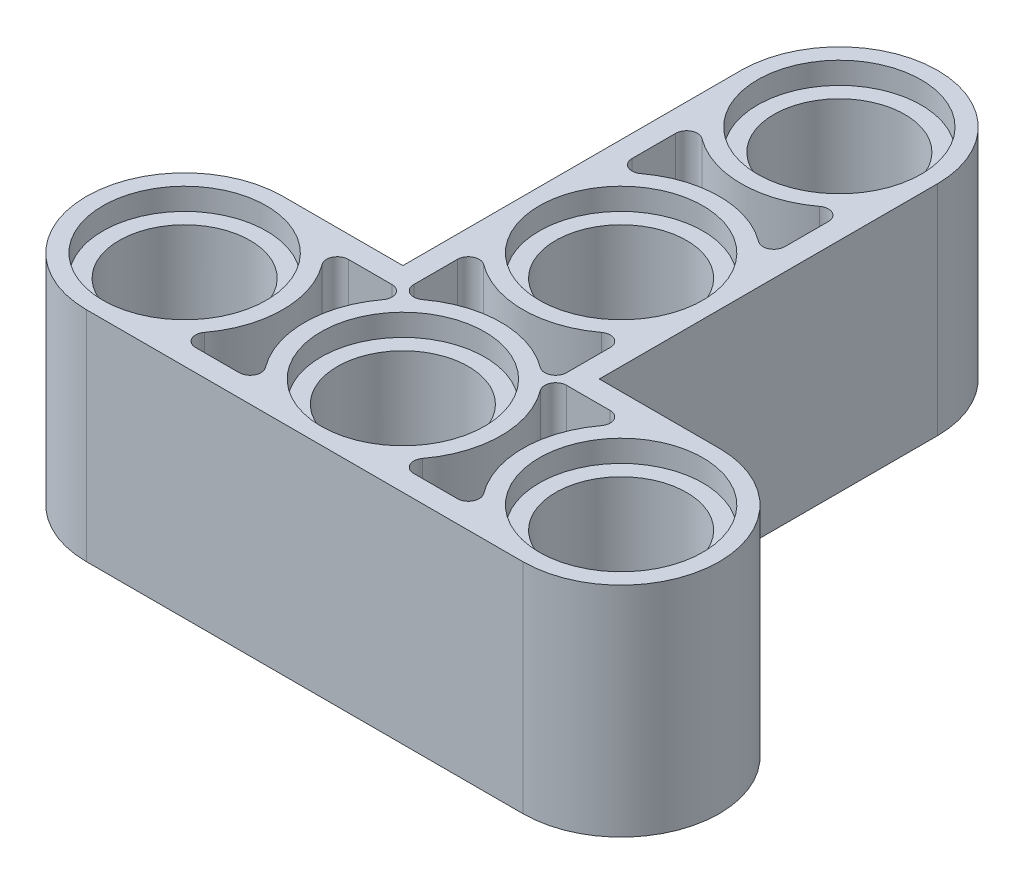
ISO-10303-21;
HEADER;
FILE_DESCRIPTION(('STEP AP214'),'2;1');
FILE_NAME('part.step','',(''),(''),'','','');
FILE_SCHEMA(('AUTOMOTIVE_DESIGN { 1 0 10303 214 1 1 1 1 }'));
ENDSEC;
DATA;
#1=APPLICATION_CONTEXT('core data for automotive mechanical design processes');
#2=APPLICATION_PROTOCOL_DEFINITION('international standard','automotive_design',2000,#1);
#3=PRODUCT_CONTEXT('',#1,'mechanical');
#4=PRODUCT('Part','Part','',(#3));
#5=PRODUCT_RELATED_PRODUCT_CATEGORY('part','',(#4));
#6=PRODUCT_DEFINITION_FORMATION('','',#4);
#7=PRODUCT_DEFINITION_CONTEXT('part definition',#1,'design');
#8=PRODUCT_DEFINITION('design','',#6,#7);
#9=PRODUCT_DEFINITION_SHAPE('','',#8);
#10=(LENGTH_UNIT() NAMED_UNIT(*) SI_UNIT(.MILLI.,.METRE.));
#11=(NAMED_UNIT(*) PLANE_ANGLE_UNIT() SI_UNIT($,.RADIAN.));
#12=(NAMED_UNIT(*) SI_UNIT($,.STERADIAN.) SOLID_ANGLE_UNIT());
#13=UNCERTAINTY_MEASURE_WITH_UNIT(LENGTH_MEASURE(1.E-05),#10,'distance_accuracy_value','');
#14=(GEOMETRIC_REPRESENTATION_CONTEXT(3) GLOBAL_UNCERTAINTY_ASSIGNED_CONTEXT((#13)) GLOBAL_UNIT_ASSIGNED_CONTEXT((#10,
#11,#12)) REPRESENTATION_CONTEXT('',''));
#15=CARTESIAN_POINT('',(0.,0.,0.));
#16=DIRECTION('',(0.,0.,1.));
#17=DIRECTION('',(1.,0.,0.));
#18=AXIS2_PLACEMENT_3D('',#15,#16,#17);
#19=CARTESIAN_POINT('',(8.,-4.,0.));
#20=DIRECTION('',(0.,-1.,0.));
#21=DIRECTION('',(0.,0.,-1.));
#22=AXIS2_PLACEMENT_3D('',#19,#20,#21);
#23=PLANE('',#22);
#24=CARTESIAN_POINT('',(0.,-4.,-16.));
#25=DIRECTION('',(0.,1.,0.));
#26=DIRECTION('',(0.,0.,1.));
#27=AXIS2_PLACEMENT_3D('',#24,#25,#26);
#28=CIRCLE('',#27,3.);
#29=CARTESIAN_POINT('',(0.,-4.,-13.));
#30=VERTEX_POINT('',#29);
#31=EDGE_CURVE('E1188',#30,#30,#28,.T.);
#32=ORIENTED_EDGE('',*,*,#31,.T.);
#33=EDGE_LOOP('',(#32));
#34=FACE_BOUND('',#33,.T.);
#35=CARTESIAN_POINT('',(-8.,-4.,0.));
#36=DIRECTION('',(0.,1.,0.));
#37=DIRECTION('',(0.,0.,1.));
#38=AXIS2_PLACEMENT_3D('',#35,#36,#37);
#39=CIRCLE('',#38,3.);
#40=CARTESIAN_POINT('',(-8.,-4.,3.));
#41=VERTEX_POINT('',#40);
#42=EDGE_CURVE('E1161',#41,#41,#39,.T.);
#43=ORIENTED_EDGE('',*,*,#42,.T.);
#44=EDGE_LOOP('',(#43));
#45=FACE_BOUND('',#44,.T.);
#46=CARTESIAN_POINT('',(8.,-4.,0.));
#47=DIRECTION('',(0.,1.,0.));
#48=DIRECTION('',(0.,0.,1.));
#49=AXIS2_PLACEMENT_3D('',#46,#47,#48);
#50=CIRCLE('',#49,3.);
#51=CARTESIAN_POINT('',(8.,-4.,3.));
#52=VERTEX_POINT('',#51);
#53=EDGE_CURVE('E1198',#52,#52,#50,.T.);
#54=ORIENTED_EDGE('',*,*,#53,.T.);
#55=EDGE_LOOP('',(#54));
#56=FACE_BOUND('',#55,.T.);
#57=CARTESIAN_POINT('',(0.,-4.,0.));
#58=DIRECTION('',(0.,1.,0.));
#59=DIRECTION('',(0.,0.,1.));
#60=AXIS2_PLACEMENT_3D('',#57,#58,#59);
#61=CIRCLE('',#60,3.);
#62=CARTESIAN_POINT('',(0.,-4.,3.));
#63=VERTEX_POINT('',#62);
#64=EDGE_CURVE('E1197',#63,#63,#61,.T.);
#65=ORIENTED_EDGE('',*,*,#64,.T.);
#66=EDGE_LOOP('',(#65));
#67=FACE_BOUND('',#66,.T.);
#68=CARTESIAN_POINT('',(0.,-4.,-8.));
#69=DIRECTION('',(0.,1.,0.));
#70=DIRECTION('',(0.,0.,1.));
#71=AXIS2_PLACEMENT_3D('',#68,#69,#70);
#72=CIRCLE('',#71,3.);
#73=CARTESIAN_POINT('',(0.,-4.,-5.));
#74=VERTEX_POINT('',#73);
#75=EDGE_CURVE('E1212',#74,#74,#72,.T.);
#76=ORIENTED_EDGE('',*,*,#75,.T.);
#77=EDGE_LOOP('',(#76));
#78=FACE_BOUND('',#77,.T.);
#79=CARTESIAN_POINT('',(8.,-4.,0.));
#80=DIRECTION('',(0.,1.,0.));
#81=DIRECTION('',(0.,0.,-1.));
#82=AXIS2_PLACEMENT_3D('',#79,#80,#81);
#83=CIRCLE('',#82,3.6);
#84=CARTESIAN_POINT('',(8.,-4.,3.6));
#85=VERTEX_POINT('',#84);
#86=CARTESIAN_POINT('',(8.,-4.,-3.6));
#87=VERTEX_POINT('',#86);
#88=EDGE_CURVE('E1297',#85,#87,#83,.T.);
#89=ORIENTED_EDGE('',*,*,#88,.F.);
#90=DIRECTION('',(1.,0.,0.));
#91=VECTOR('',#90,1.);
#92=CARTESIAN_POINT('',(-8.,-4.,3.6));
#93=LINE('',#92,#91);
#94=CARTESIAN_POINT('',(-8.,-4.,3.6));
#95=VERTEX_POINT('',#94);
#96=EDGE_CURVE('E1325',#95,#85,#93,.T.);
#97=ORIENTED_EDGE('',*,*,#96,.F.);
#98=CARTESIAN_POINT('',(-8.,-4.,0.));
#99=DIRECTION('',(0.,1.,0.));
#100=DIRECTION('',(0.,0.,1.));
#101=AXIS2_PLACEMENT_3D('',#98,#99,#100);
#102=CIRCLE('',#101,3.6);
#103=CARTESIAN_POINT('',(-8.,-4.,-3.6));
#104=VERTEX_POINT('',#103);
#105=EDGE_CURVE('E1321',#104,#95,#102,.T.);
#106=ORIENTED_EDGE('',*,*,#105,.F.);
#107=DIRECTION('',(-1.,0.,0.));
#108=VECTOR('',#107,1.);
#109=CARTESIAN_POINT('',(-3.6,-4.,-3.6));
#110=LINE('',#109,#108);
#111=CARTESIAN_POINT('',(-3.6,-4.,-3.6));
#112=VERTEX_POINT('',#111);
#113=EDGE_CURVE('E1317',#112,#104,#110,.T.);
#114=ORIENTED_EDGE('',*,*,#113,.F.);
#115=DIRECTION('',(0.,0.,1.));
#116=VECTOR('',#115,1.);
#117=CARTESIAN_POINT('',(-3.6,-4.,-16.));
#118=LINE('',#117,#116);
#119=CARTESIAN_POINT('',(-3.6,-4.,-16.));
#120=VERTEX_POINT('',#119);
#121=EDGE_CURVE('E1313',#120,#112,#118,.T.);
#122=ORIENTED_EDGE('',*,*,#121,.F.);
#123=CARTESIAN_POINT('',(0.,-4.,-16.));
#124=DIRECTION('',(0.,1.,0.));
#125=DIRECTION('',(0.,0.,-1.));
#126=AXIS2_PLACEMENT_3D('',#123,#124,#125);
#127=CIRCLE('',#126,3.6);
#128=CARTESIAN_POINT('',(3.6,-4.,-16.));
#129=VERTEX_POINT('',#128);
#130=EDGE_CURVE('E1309',#129,#120,#127,.T.);
#131=ORIENTED_EDGE('',*,*,#130,.F.);
#132=DIRECTION('',(0.,0.,-1.));
#133=VECTOR('',#132,1.);
#134=CARTESIAN_POINT('',(3.6,-4.,-16.));
#135=LINE('',#134,#133);
#136=CARTESIAN_POINT('',(3.6,-4.,-3.6));
#137=VERTEX_POINT('',#136);
#138=EDGE_CURVE('E1305',#137,#129,#135,.T.);
#139=ORIENTED_EDGE('',*,*,#138,.F.);
#140=DIRECTION('',(-1.,0.,0.));
#141=VECTOR('',#140,1.);
#142=CARTESIAN_POINT('',(8.,-4.,-3.6));
#143=LINE('',#142,#141);
#144=EDGE_CURVE('E1301',#87,#137,#143,.T.);
#145=ORIENTED_EDGE('',*,*,#144,.F.);
#146=EDGE_LOOP('',(#89,#97,#106,#114,#122,#131,#139,#145));
#147=FACE_BOUND('',#146,.T.);
#148=CARTESIAN_POINT('',(-8.,-4.,0.));
#149=DIRECTION('',(0.,-1.,0.));
#150=DIRECTION('',(0.,0.,1.));
#151=AXIS2_PLACEMENT_3D('',#148,#149,#150);
#152=CIRCLE('',#151,3.6);
#153=CARTESIAN_POINT('',(-5.12,-4.,-2.16));
#154=VERTEX_POINT('',#153);
#155=CARTESIAN_POINT('',(-5.12,-4.,2.16));
#156=VERTEX_POINT('',#155);
#157=EDGE_CURVE('E778',#154,#156,#152,.T.);
#158=ORIENTED_EDGE('',*,*,#157,.T.);
#159=CARTESIAN_POINT('',(-4.8,-4.,2.4));
#160=DIRECTION('',(0.,1.,0.));
#161=DIRECTION('',(0.,0.,1.));
#162=AXIS2_PLACEMENT_3D('',#159,#160,#161);
#163=CIRCLE('',#162,0.400000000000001);
#164=CARTESIAN_POINT('',(-4.8,-4.,2.8));
#165=VERTEX_POINT('',#164);
#166=EDGE_CURVE('E649',#156,#165,#163,.T.);
#167=ORIENTED_EDGE('',*,*,#166,.T.);
#168=DIRECTION('',(1.,0.,0.));
#169=VECTOR('',#168,1.);
#170=CARTESIAN_POINT('',(-4.8,-4.,2.8));
#171=LINE('',#170,#169);
#172=CARTESIAN_POINT('',(-3.2,-4.,2.8));
#173=VERTEX_POINT('',#172);
#174=EDGE_CURVE('E753',#165,#173,#171,.T.);
#175=ORIENTED_EDGE('',*,*,#174,.T.);
#176=CARTESIAN_POINT('',(-3.2,-4.,2.4));
#177=DIRECTION('',(0.,1.,0.));
#178=DIRECTION('',(0.,0.,1.));
#179=AXIS2_PLACEMENT_3D('',#176,#177,#178);
#180=CIRCLE('',#179,0.4);
#181=CARTESIAN_POINT('',(-2.88,-4.,2.16));
#182=VERTEX_POINT('',#181);
#183=EDGE_CURVE('E798',#173,#182,#180,.T.);
#184=ORIENTED_EDGE('',*,*,#183,.T.);
#185=CARTESIAN_POINT('',(0.,-4.,0.));
#186=DIRECTION('',(0.,-1.,0.));
#187=DIRECTION('',(0.,0.,1.));
#188=AXIS2_PLACEMENT_3D('',#185,#186,#187);
#189=CIRCLE('',#188,3.6);
#190=CARTESIAN_POINT('',(-2.88,-4.,-2.16));
#191=VERTEX_POINT('',#190);
#192=EDGE_CURVE('E794',#182,#191,#189,.T.);
#193=ORIENTED_EDGE('',*,*,#192,.T.);
#194=CARTESIAN_POINT('',(-3.2,-4.,-2.4));
#195=DIRECTION('',(0.,1.,0.));
#196=DIRECTION('',(0.,0.,1.));
#197=AXIS2_PLACEMENT_3D('',#194,#195,#196);
#198=CIRCLE('',#197,0.4);
#199=CARTESIAN_POINT('',(-3.2,-4.,-2.8));
#200=VERTEX_POINT('',#199);
#201=EDGE_CURVE('E790',#191,#200,#198,.T.);
#202=ORIENTED_EDGE('',*,*,#201,.T.);
#203=DIRECTION('',(-1.,0.,0.));
#204=VECTOR('',#203,1.);
#205=CARTESIAN_POINT('',(-4.8,-4.,-2.8));
#206=LINE('',#205,#204);
#207=CARTESIAN_POINT('',(-4.8,-4.,-2.8));
#208=VERTEX_POINT('',#207);
#209=EDGE_CURVE('E786',#200,#208,#206,.T.);
#210=ORIENTED_EDGE('',*,*,#209,.T.);
#211=CARTESIAN_POINT('',(-4.8,-4.,-2.4));
#212=DIRECTION('',(0.,1.,0.));
#213=DIRECTION('',(0.,0.,1.));
#214=AXIS2_PLACEMENT_3D('',#211,#212,#213);
#215=CIRCLE('',#214,0.399999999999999);
#216=EDGE_CURVE('E782',#208,#154,#215,.T.);
#217=ORIENTED_EDGE('',*,*,#216,.T.);
#218=EDGE_LOOP('',(#158,#167,#175,#184,#193,#202,#210,#217));
#219=FACE_BOUND('',#218,.T.);
#220=CARTESIAN_POINT('',(8.,-4.,-4.05989076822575E-13));
#221=DIRECTION('',(0.,-1.,0.));
#222=DIRECTION('',(0.,0.,1.));
#223=AXIS2_PLACEMENT_3D('',#220,#221,#222);
#224=CIRCLE('',#223,3.6);
#225=CARTESIAN_POINT('',(5.12000000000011,-4.,2.15999999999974));
#226=VERTEX_POINT('',#225);
#227=CARTESIAN_POINT('',(5.11999999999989,-4.,-2.16000000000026));
#228=VERTEX_POINT('',#227);
#229=EDGE_CURVE('E547',#226,#228,#224,.T.);
#230=ORIENTED_EDGE('',*,*,#229,.T.);
#231=CARTESIAN_POINT('',(4.79999999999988,-4.,-2.40000000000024));
#232=DIRECTION('',(0.,1.,0.));
#233=DIRECTION('',(0.,0.,1.));
#234=AXIS2_PLACEMENT_3D('',#231,#232,#233);
#235=CIRCLE('',#234,0.4);
#236=CARTESIAN_POINT('',(4.79999999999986,-4.,-2.80000000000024));
#237=VERTEX_POINT('',#236);
#238=EDGE_CURVE('E515',#228,#237,#235,.T.);
#239=ORIENTED_EDGE('',*,*,#238,.T.);
#240=DIRECTION('',(-1.,0.,1.66425033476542E-13));
#241=VECTOR('',#240,1.);
#242=CARTESIAN_POINT('',(4.79999999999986,-4.,-2.80000000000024));
#243=LINE('',#242,#241);
#244=CARTESIAN_POINT('',(3.20000000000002,-4.,-2.79999999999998));
#245=VERTEX_POINT('',#244);
#246=EDGE_CURVE('E522',#237,#245,#243,.T.);
#247=ORIENTED_EDGE('',*,*,#246,.T.);
#248=CARTESIAN_POINT('',(3.20000000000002,-4.,-2.39999999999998));
#249=DIRECTION('',(0.,1.,0.));
#250=DIRECTION('',(0.,0.,1.));
#251=AXIS2_PLACEMENT_3D('',#248,#249,#250);
#252=CIRCLE('',#251,0.4);
#253=CARTESIAN_POINT('',(2.88000000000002,-4.,-2.15999999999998));
#254=VERTEX_POINT('',#253);
#255=EDGE_CURVE('E526',#245,#254,#252,.T.);
#256=ORIENTED_EDGE('',*,*,#255,.T.);
#257=CARTESIAN_POINT('',(0.,-4.,0.));
#258=DIRECTION('',(0.,-1.,0.));
#259=DIRECTION('',(0.,0.,1.));
#260=AXIS2_PLACEMENT_3D('',#257,#258,#259);
#261=CIRCLE('',#260,3.6);
#262=CARTESIAN_POINT('',(2.87999999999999,-4.,2.16000000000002));
#263=VERTEX_POINT('',#262);
#264=EDGE_CURVE('E563',#254,#263,#261,.T.);
#265=ORIENTED_EDGE('',*,*,#264,.T.);
#266=CARTESIAN_POINT('',(3.19999999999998,-4.,2.40000000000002));
#267=DIRECTION('',(0.,1.,0.));
#268=DIRECTION('',(0.,0.,1.));
#269=AXIS2_PLACEMENT_3D('',#266,#267,#268);
#270=CIRCLE('',#269,0.4);
#271=CARTESIAN_POINT('',(3.19999999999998,-4.,2.80000000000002));
#272=VERTEX_POINT('',#271);
#273=EDGE_CURVE('E559',#263,#272,#270,.T.);
#274=ORIENTED_EDGE('',*,*,#273,.T.);
#275=DIRECTION('',(1.,0.,-1.66153982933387E-13));
#276=VECTOR('',#275,1.);
#277=CARTESIAN_POINT('',(4.80000000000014,-4.,2.79999999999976));
#278=LINE('',#277,#276);
#279=CARTESIAN_POINT('',(4.80000000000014,-4.,2.79999999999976));
#280=VERTEX_POINT('',#279);
#281=EDGE_CURVE('E555',#272,#280,#278,.T.);
#282=ORIENTED_EDGE('',*,*,#281,.T.);
#283=CARTESIAN_POINT('',(4.80000000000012,-4.,2.39999999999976));
#284=DIRECTION('',(0.,1.,0.));
#285=DIRECTION('',(0.,0.,1.));
#286=AXIS2_PLACEMENT_3D('',#283,#284,#285);
#287=CIRCLE('',#286,0.4);
#288=EDGE_CURVE('E551',#280,#226,#287,.T.);
#289=ORIENTED_EDGE('',*,*,#288,.T.);
#290=EDGE_LOOP('',(#230,#239,#247,#256,#265,#274,#282,#289));
#291=FACE_BOUND('',#290,.T.);
#292=CARTESIAN_POINT('',(0.,-4.,-8.));
#293=DIRECTION('',(0.,-1.,0.));
#294=DIRECTION('',(0.,0.,1.));
#295=AXIS2_PLACEMENT_3D('',#292,#293,#294);
#296=CIRCLE('',#295,3.6);
#297=CARTESIAN_POINT('',(2.16000000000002,-4.,-5.11999999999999));
#298=VERTEX_POINT('',#297);
#299=CARTESIAN_POINT('',(-2.15999999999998,-4.,-5.12000000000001));
#300=VERTEX_POINT('',#299);
#301=EDGE_CURVE('E619',#298,#300,#296,.T.);
#302=ORIENTED_EDGE('',*,*,#301,.T.);
#303=CARTESIAN_POINT('',(-2.39999999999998,-4.,-4.80000000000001));
#304=DIRECTION('',(0.,1.,0.));
#305=DIRECTION('',(0.,0.,1.));
#306=AXIS2_PLACEMENT_3D('',#303,#304,#305);
#307=CIRCLE('',#306,0.400000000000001);
#308=CARTESIAN_POINT('',(-2.79999999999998,-4.,-4.80000000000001));
#309=VERTEX_POINT('',#308);
#310=EDGE_CURVE('E65',#300,#309,#307,.T.);
#311=ORIENTED_EDGE('',*,*,#310,.T.);
#312=DIRECTION('',(0.,0.,1.));
#313=VECTOR('',#312,1.);
#314=CARTESIAN_POINT('',(-2.79999999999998,-4.,-4.80000000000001));
#315=LINE('',#314,#313);
#316=CARTESIAN_POINT('',(-2.79999999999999,-4.,-3.20000000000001));
#317=VERTEX_POINT('',#316);
#318=EDGE_CURVE('E595',#309,#317,#315,.T.);
#319=ORIENTED_EDGE('',*,*,#318,.T.);
#320=CARTESIAN_POINT('',(-2.39999999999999,-4.,-3.20000000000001));
#321=DIRECTION('',(0.,1.,0.));
#322=DIRECTION('',(0.,0.,1.));
#323=AXIS2_PLACEMENT_3D('',#320,#321,#322);
#324=CIRCLE('',#323,0.4);
#325=CARTESIAN_POINT('',(-2.15999999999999,-4.,-2.88000000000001));
#326=VERTEX_POINT('',#325);
#327=EDGE_CURVE('E639',#317,#326,#324,.T.);
#328=ORIENTED_EDGE('',*,*,#327,.T.);
#329=CARTESIAN_POINT('',(0.,-4.,0.));
#330=DIRECTION('',(0.,-1.,0.));
#331=DIRECTION('',(0.,0.,1.));
#332=AXIS2_PLACEMENT_3D('',#329,#330,#331);
#333=CIRCLE('',#332,3.6);
#334=CARTESIAN_POINT('',(2.16000000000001,-4.,-2.87999999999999));
#335=VERTEX_POINT('',#334);
#336=EDGE_CURVE('E635',#326,#335,#333,.T.);
#337=ORIENTED_EDGE('',*,*,#336,.T.);
#338=CARTESIAN_POINT('',(2.40000000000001,-4.,-3.19999999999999));
#339=DIRECTION('',(0.,1.,0.));
#340=DIRECTION('',(0.,0.,1.));
#341=AXIS2_PLACEMENT_3D('',#338,#339,#340);
#342=CIRCLE('',#341,0.4);
#343=CARTESIAN_POINT('',(2.80000000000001,-4.,-3.19999999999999));
#344=VERTEX_POINT('',#343);
#345=EDGE_CURVE('E631',#335,#344,#342,.T.);
#346=ORIENTED_EDGE('',*,*,#345,.T.);
#347=DIRECTION('',(0.,0.,-1.));
#348=VECTOR('',#347,1.);
#349=CARTESIAN_POINT('',(2.80000000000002,-4.,-4.79999999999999));
#350=LINE('',#349,#348);
#351=CARTESIAN_POINT('',(2.80000000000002,-4.,-4.79999999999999));
#352=VERTEX_POINT('',#351);
#353=EDGE_CURVE('E627',#344,#352,#350,.T.);
#354=ORIENTED_EDGE('',*,*,#353,.T.);
#355=CARTESIAN_POINT('',(2.40000000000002,-4.,-4.79999999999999));
#356=DIRECTION('',(0.,1.,0.));
#357=DIRECTION('',(0.,0.,1.));
#358=AXIS2_PLACEMENT_3D('',#355,#356,#357);
#359=CIRCLE('',#358,0.399999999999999);
#360=EDGE_CURVE('E623',#352,#298,#359,.T.);
#361=ORIENTED_EDGE('',*,*,#360,.T.);
#362=EDGE_LOOP('',(#302,#311,#319,#328,#337,#346,#354,#361));
#363=FACE_BOUND('',#362,.T.);
#364=CARTESIAN_POINT('',(0.,-4.,-16.));
#365=DIRECTION('',(0.,-1.,0.));
#366=DIRECTION('',(0.,0.,1.));
#367=AXIS2_PLACEMENT_3D('',#364,#365,#366);
#368=CIRCLE('',#367,3.6);
#369=CARTESIAN_POINT('',(2.15999999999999,-4.,-13.12));
#370=VERTEX_POINT('',#369);
#371=CARTESIAN_POINT('',(-2.16000000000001,-4.,-13.12));
#372=VERTEX_POINT('',#371);
#373=EDGE_CURVE('E699',#370,#372,#368,.T.);
#374=ORIENTED_EDGE('',*,*,#373,.T.);
#375=CARTESIAN_POINT('',(-2.40000000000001,-4.,-12.8));
#376=DIRECTION('',(0.,1.,0.));
#377=DIRECTION('',(0.,0.,1.));
#378=AXIS2_PLACEMENT_3D('',#375,#376,#377);
#379=CIRCLE('',#378,0.400000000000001);
#380=CARTESIAN_POINT('',(-2.80000000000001,-4.,-12.8));
#381=VERTEX_POINT('',#380);
#382=EDGE_CURVE('E57',#372,#381,#379,.T.);
#383=ORIENTED_EDGE('',*,*,#382,.T.);
#384=DIRECTION('',(0.,0.,1.));
#385=VECTOR('',#384,1.);
#386=CARTESIAN_POINT('',(-2.80000000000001,-4.,-12.8));
#387=LINE('',#386,#385);
#388=CARTESIAN_POINT('',(-2.80000000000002,-4.,-11.2));
#389=VERTEX_POINT('',#388);
#390=EDGE_CURVE('E675',#381,#389,#387,.T.);
#391=ORIENTED_EDGE('',*,*,#390,.T.);
#392=CARTESIAN_POINT('',(-2.40000000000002,-4.,-11.2));
#393=DIRECTION('',(0.,1.,0.));
#394=DIRECTION('',(0.,0.,1.));
#395=AXIS2_PLACEMENT_3D('',#392,#393,#394);
#396=CIRCLE('',#395,0.4);
#397=CARTESIAN_POINT('',(-2.16000000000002,-4.,-10.88));
#398=VERTEX_POINT('',#397);
#399=EDGE_CURVE('E719',#389,#398,#396,.T.);
#400=ORIENTED_EDGE('',*,*,#399,.T.);
#401=CARTESIAN_POINT('',(0.,-4.,-8.));
#402=DIRECTION('',(0.,-1.,0.));
#403=DIRECTION('',(0.,0.,1.));
#404=AXIS2_PLACEMENT_3D('',#401,#402,#403);
#405=CIRCLE('',#404,3.6);
#406=CARTESIAN_POINT('',(2.15999999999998,-4.,-10.88));
#407=VERTEX_POINT('',#406);
#408=EDGE_CURVE('E715',#398,#407,#405,.T.);
#409=ORIENTED_EDGE('',*,*,#408,.T.);
#410=CARTESIAN_POINT('',(2.39999999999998,-4.,-11.2));
#411=DIRECTION('',(0.,1.,0.));
#412=DIRECTION('',(0.,0.,1.));
#413=AXIS2_PLACEMENT_3D('',#410,#411,#412);
#414=CIRCLE('',#413,0.4);
#415=CARTESIAN_POINT('',(2.79999999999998,-4.,-11.2));
#416=VERTEX_POINT('',#415);
#417=EDGE_CURVE('E711',#407,#416,#414,.T.);
#418=ORIENTED_EDGE('',*,*,#417,.T.);
#419=DIRECTION('',(0.,0.,-1.));
#420=VECTOR('',#419,1.);
#421=CARTESIAN_POINT('',(2.79999999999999,-4.,-12.8));
#422=LINE('',#421,#420);
#423=CARTESIAN_POINT('',(2.79999999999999,-4.,-12.8));
#424=VERTEX_POINT('',#423);
#425=EDGE_CURVE('E707',#416,#424,#422,.T.);
#426=ORIENTED_EDGE('',*,*,#425,.T.);
#427=CARTESIAN_POINT('',(2.39999999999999,-4.,-12.8));
#428=DIRECTION('',(0.,1.,0.));
#429=DIRECTION('',(0.,0.,1.));
#430=AXIS2_PLACEMENT_3D('',#427,#428,#429);
#431=CIRCLE('',#430,0.399999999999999);
#432=EDGE_CURVE('E703',#424,#370,#431,.T.);
#433=ORIENTED_EDGE('',*,*,#432,.T.);
#434=EDGE_LOOP('',(#374,#383,#391,#400,#409,#418,#426,#433));
#435=FACE_BOUND('',#434,.T.);
#436=ADVANCED_FACE('F39',(#34,#45,#56,#67,#78,#147,#219,#291,#363,#435),#23,.T.);
#437=CARTESIAN_POINT('',(0.,-4.,0.));
#438=DIRECTION('',(0.,1.,0.));
#439=DIRECTION('',(0.,0.,1.));
#440=AXIS2_PLACEMENT_3D('',#437,#438,#439);
#441=CYLINDRICAL_SURFACE('',#440,2.4);
#442=CARTESIAN_POINT('',(0.,3.2,0.));
#443=DIRECTION('',(0.,1.,0.));
#444=DIRECTION('',(0.,0.,1.));
#445=AXIS2_PLACEMENT_3D('',#442,#443,#444);
#446=CIRCLE('',#445,2.4);
#447=CARTESIAN_POINT('',(0.,3.2,2.4));
#448=VERTEX_POINT('',#447);
#449=EDGE_CURVE('E1269',#448,#448,#446,.F.);
#450=ORIENTED_EDGE('',*,*,#449,.F.);
#451=EDGE_LOOP('',(#450));
#452=FACE_BOUND('',#451,.T.);
#453=CARTESIAN_POINT('',(0.,-3.2,0.));
#454=DIRECTION('',(0.,-1.,0.));
#455=DIRECTION('',(0.,0.,-1.));
#456=AXIS2_PLACEMENT_3D('',#453,#454,#455);
#457=CIRCLE('',#456,2.4);
#458=CARTESIAN_POINT('',(0.,-3.2,-2.4));
#459=VERTEX_POINT('',#458);
#460=EDGE_CURVE('E43',#459,#459,#457,.F.);
#461=ORIENTED_EDGE('',*,*,#460,.F.);
#462=EDGE_LOOP('',(#461));
#463=FACE_BOUND('',#462,.T.);
#464=ADVANCED_FACE('F1388',(#452,#463),#441,.F.);
#465=CARTESIAN_POINT('',(8.,-4.,0.));
#466=DIRECTION('',(0.,1.,0.));
#467=DIRECTION('',(0.,0.,1.));
#468=AXIS2_PLACEMENT_3D('',#465,#466,#467);
#469=CYLINDRICAL_SURFACE('',#468,2.4);
#470=CARTESIAN_POINT('',(8.,3.2,0.));
#471=DIRECTION('',(0.,1.,0.));
#472=DIRECTION('',(0.,0.,1.));
#473=AXIS2_PLACEMENT_3D('',#470,#471,#472);
#474=CIRCLE('',#473,2.4);
#475=CARTESIAN_POINT('',(8.,3.2,2.4));
#476=VERTEX_POINT('',#475);
#477=EDGE_CURVE('E1360',#476,#476,#474,.F.);
#478=ORIENTED_EDGE('',*,*,#477,.F.);
#479=EDGE_LOOP('',(#478));
#480=FACE_BOUND('',#479,.T.);
#481=CARTESIAN_POINT('',(8.,-3.2,0.));
#482=DIRECTION('',(0.,-1.,0.));
#483=DIRECTION('',(0.,0.,-1.));
#484=AXIS2_PLACEMENT_3D('',#481,#482,#483);
#485=CIRCLE('',#484,2.4);
#486=CARTESIAN_POINT('',(8.,-3.2,-2.4));
#487=VERTEX_POINT('',#486);
#488=EDGE_CURVE('E1377',#487,#487,#485,.F.);
#489=ORIENTED_EDGE('',*,*,#488,.F.);
#490=EDGE_LOOP('',(#489));
#491=FACE_BOUND('',#490,.T.);
#492=ADVANCED_FACE('F1390',(#480,#491),#469,.F.);
#493=CARTESIAN_POINT('',(-8.,-4.,0.));
#494=DIRECTION('',(0.,1.,0.));
#495=DIRECTION('',(0.,0.,1.));
#496=AXIS2_PLACEMENT_3D('',#493,#494,#495);
#497=CYLINDRICAL_SURFACE('',#496,2.4);
#498=CARTESIAN_POINT('',(-8.,3.2,0.));
#499=DIRECTION('',(0.,1.,0.));
#500=DIRECTION('',(0.,0.,1.));
#501=AXIS2_PLACEMENT_3D('',#498,#499,#500);
#502=CIRCLE('',#501,2.4);
#503=CARTESIAN_POINT('',(-8.,3.2,2.4));
#504=VERTEX_POINT('',#503);
#505=EDGE_CURVE('E1356',#504,#504,#502,.F.);
#506=ORIENTED_EDGE('',*,*,#505,.F.);
#507=EDGE_LOOP('',(#506));
#508=FACE_BOUND('',#507,.T.);
#509=CARTESIAN_POINT('',(-8.,-3.2,0.));
#510=DIRECTION('',(0.,-1.,0.));
#511=DIRECTION('',(0.,0.,-1.));
#512=AXIS2_PLACEMENT_3D('',#509,#510,#511);
#513=CIRCLE('',#512,2.4);
#514=CARTESIAN_POINT('',(-8.,-3.2,-2.4));
#515=VERTEX_POINT('',#514);
#516=EDGE_CURVE('E1374',#515,#515,#513,.F.);
#517=ORIENTED_EDGE('',*,*,#516,.F.);
#518=EDGE_LOOP('',(#517));
#519=FACE_BOUND('',#518,.T.);
#520=ADVANCED_FACE('F1397',(#508,#519),#497,.F.);
#521=CARTESIAN_POINT('',(0.,-4.,-8.));
#522=DIRECTION('',(0.,1.,0.));
#523=DIRECTION('',(0.,0.,1.));
#524=AXIS2_PLACEMENT_3D('',#521,#522,#523);
#525=CYLINDRICAL_SURFACE('',#524,2.4);
#526=CARTESIAN_POINT('',(0.,3.2,-8.));
#527=DIRECTION('',(0.,1.,0.));
#528=DIRECTION('',(0.,0.,1.));
#529=AXIS2_PLACEMENT_3D('',#526,#527,#528);
#530=CIRCLE('',#529,2.4);
#531=CARTESIAN_POINT('',(0.,3.2,-5.6));
#532=VERTEX_POINT('',#531);
#533=EDGE_CURVE('E1352',#532,#532,#530,.F.);
#534=ORIENTED_EDGE('',*,*,#533,.F.);
#535=EDGE_LOOP('',(#534));
#536=FACE_BOUND('',#535,.T.);
#537=CARTESIAN_POINT('',(0.,-3.2,-8.));
#538=DIRECTION('',(0.,-1.,0.));
#539=DIRECTION('',(0.,0.,-1.));
#540=AXIS2_PLACEMENT_3D('',#537,#538,#539);
#541=CIRCLE('',#540,2.4);
#542=CARTESIAN_POINT('',(0.,-3.2,-10.4));
#543=VERTEX_POINT('',#542);
#544=EDGE_CURVE('E1370',#543,#543,#541,.F.);
#545=ORIENTED_EDGE('',*,*,#544,.F.);
#546=EDGE_LOOP('',(#545));
#547=FACE_BOUND('',#546,.T.);
#548=ADVANCED_FACE('F1463',(#536,#547),#525,.F.);
#549=CARTESIAN_POINT('',(0.,-4.,-16.));
#550=DIRECTION('',(0.,1.,0.));
#551=DIRECTION('',(0.,0.,1.));
#552=AXIS2_PLACEMENT_3D('',#549,#550,#551);
#553=CYLINDRICAL_SURFACE('',#552,2.4);
#554=CARTESIAN_POINT('',(0.,3.2,-16.));
#555=DIRECTION('',(0.,1.,0.));
#556=DIRECTION('',(0.,0.,1.));
#557=AXIS2_PLACEMENT_3D('',#554,#555,#556);
#558=CIRCLE('',#557,2.4);
#559=CARTESIAN_POINT('',(0.,3.2,-13.6));
#560=VERTEX_POINT('',#559);
#561=EDGE_CURVE('E1227',#560,#560,#558,.F.);
#562=ORIENTED_EDGE('',*,*,#561,.F.);
#563=EDGE_LOOP('',(#562));
#564=FACE_BOUND('',#563,.T.);
#565=CARTESIAN_POINT('',(0.,-3.2,-16.));
#566=DIRECTION('',(0.,-1.,0.));
#567=DIRECTION('',(0.,0.,-1.));
#568=AXIS2_PLACEMENT_3D('',#565,#566,#567);
#569=CIRCLE('',#568,2.4);
#570=CARTESIAN_POINT('',(0.,-3.2,-18.4));
#571=VERTEX_POINT('',#570);
#572=EDGE_CURVE('E1187',#571,#571,#569,.F.);
#573=ORIENTED_EDGE('',*,*,#572,.F.);
#574=EDGE_LOOP('',(#573));
#575=FACE_BOUND('',#574,.T.);
#576=ADVANCED_FACE('F1459',(#564,#575),#553,.F.);
#577=CARTESIAN_POINT('',(8.,-4.,0.));
#578=DIRECTION('',(0.,1.,0.));
#579=DIRECTION('',(0.,0.,1.));
#580=AXIS2_PLACEMENT_3D('',#577,#578,#579);
#581=CYLINDRICAL_SURFACE('',#580,3.6);
#582=DIRECTION('',(0.,1.,0.));
#583=VECTOR('',#582,1.);
#584=CARTESIAN_POINT('',(8.,-4.,-3.6));
#585=LINE('',#584,#583);
#586=CARTESIAN_POINT('',(8.,4.,-3.6));
#587=VERTEX_POINT('',#586);
#588=EDGE_CURVE('E1328',#87,#587,#585,.T.);
#589=ORIENTED_EDGE('',*,*,#588,.T.);
#590=CARTESIAN_POINT('',(8.,4.,0.));
#591=DIRECTION('',(0.,1.,0.));
#592=DIRECTION('',(0.,0.,-1.));
#593=AXIS2_PLACEMENT_3D('',#590,#591,#592);
#594=CIRCLE('',#593,3.6);
#595=CARTESIAN_POINT('',(8.,4.,3.6));
#596=VERTEX_POINT('',#595);
#597=EDGE_CURVE('E1264',#596,#587,#594,.T.);
#598=ORIENTED_EDGE('',*,*,#597,.F.);
#599=DIRECTION('',(0.,1.,0.));
#600=VECTOR('',#599,1.);
#601=CARTESIAN_POINT('',(8.,-4.,3.6));
#602=LINE('',#601,#600);
#603=EDGE_CURVE('E11',#85,#596,#602,.T.);
#604=ORIENTED_EDGE('',*,*,#603,.F.);
#605=ORIENTED_EDGE('',*,*,#88,.T.);
#606=EDGE_LOOP('',(#589,#598,#604,#605));
#607=FACE_BOUND('',#606,.T.);
#608=ADVANCED_FACE('F41',(#607),#581,.T.);
#609=CARTESIAN_POINT('',(-8.,-4.,3.6));
#610=DIRECTION('',(0.,0.,1.));
#611=DIRECTION('',(1.,0.,0.));
#612=AXIS2_PLACEMENT_3D('',#609,#610,#611);
#613=PLANE('',#612);
#614=ORIENTED_EDGE('',*,*,#603,.T.);
#615=DIRECTION('',(1.,0.,0.));
#616=VECTOR('',#615,1.);
#617=CARTESIAN_POINT('',(-8.,4.,3.6));
#618=LINE('',#617,#616);
#619=CARTESIAN_POINT('',(-8.,4.,3.6));
#620=VERTEX_POINT('',#619);
#621=EDGE_CURVE('E1293',#620,#596,#618,.T.);
#622=ORIENTED_EDGE('',*,*,#621,.F.);
#623=DIRECTION('',(0.,1.,0.));
#624=VECTOR('',#623,1.);
#625=CARTESIAN_POINT('',(-8.,-4.,3.6));
#626=LINE('',#625,#624);
#627=EDGE_CURVE('E49',#95,#620,#626,.T.);
#628=ORIENTED_EDGE('',*,*,#627,.F.);
#629=ORIENTED_EDGE('',*,*,#96,.T.);
#630=EDGE_LOOP('',(#614,#622,#628,#629));
#631=FACE_BOUND('',#630,.T.);
#632=ADVANCED_FACE('F1405',(#631),#613,.T.);
#633=CARTESIAN_POINT('',(-8.,-4.,0.));
#634=DIRECTION('',(0.,1.,0.));
#635=DIRECTION('',(0.,0.,1.));
#636=AXIS2_PLACEMENT_3D('',#633,#634,#635);
#637=CYLINDRICAL_SURFACE('',#636,3.6);
#638=ORIENTED_EDGE('',*,*,#627,.T.);
#639=CARTESIAN_POINT('',(-8.,4.,0.));
#640=DIRECTION('',(0.,1.,0.));
#641=DIRECTION('',(0.,0.,1.));
#642=AXIS2_PLACEMENT_3D('',#639,#640,#641);
#643=CIRCLE('',#642,3.6);
#644=CARTESIAN_POINT('',(-8.,4.,-3.6));
#645=VERTEX_POINT('',#644);
#646=EDGE_CURVE('E1289',#645,#620,#643,.T.);
#647=ORIENTED_EDGE('',*,*,#646,.F.);
#648=DIRECTION('',(0.,1.,0.));
#649=VECTOR('',#648,1.);
#650=CARTESIAN_POINT('',(-8.,-4.,-3.6));
#651=LINE('',#650,#649);
#652=EDGE_CURVE('E1332',#104,#645,#651,.T.);
#653=ORIENTED_EDGE('',*,*,#652,.F.);
#654=ORIENTED_EDGE('',*,*,#105,.T.);
#655=EDGE_LOOP('',(#638,#647,#653,#654));
#656=FACE_BOUND('',#655,.T.);
#657=ADVANCED_FACE('F1408',(#656),#637,.T.);
#658=CARTESIAN_POINT('',(-3.6,-4.,-3.6));
#659=DIRECTION('',(0.,0.,-1.));
#660=DIRECTION('',(-1.,0.,0.));
#661=AXIS2_PLACEMENT_3D('',#658,#659,#660);
#662=PLANE('',#661);
#663=ORIENTED_EDGE('',*,*,#652,.T.);
#664=DIRECTION('',(-1.,0.,0.));
#665=VECTOR('',#664,1.);
#666=CARTESIAN_POINT('',(-3.6,4.,-3.6));
#667=LINE('',#666,#665);
#668=CARTESIAN_POINT('',(-3.6,4.,-3.6));
#669=VERTEX_POINT('',#668);
#670=EDGE_CURVE('E1285',#669,#645,#667,.T.);
#671=ORIENTED_EDGE('',*,*,#670,.F.);
#672=DIRECTION('',(0.,1.,0.));
#673=VECTOR('',#672,1.);
#674=CARTESIAN_POINT('',(-3.6,-4.,-3.6));
#675=LINE('',#674,#673);
#676=EDGE_CURVE('E1335',#112,#669,#675,.T.);
#677=ORIENTED_EDGE('',*,*,#676,.F.);
#678=ORIENTED_EDGE('',*,*,#113,.T.);
#679=EDGE_LOOP('',(#663,#671,#677,#678));
#680=FACE_BOUND('',#679,.T.);
#681=ADVANCED_FACE('F1412',(#680),#662,.T.);
#682=CARTESIAN_POINT('',(-3.6,-4.,-16.));
#683=DIRECTION('',(-1.,0.,0.));
#684=DIRECTION('',(0.,0.,1.));
#685=AXIS2_PLACEMENT_3D('',#682,#683,#684);
#686=PLANE('',#685);
#687=ORIENTED_EDGE('',*,*,#676,.T.);
#688=DIRECTION('',(0.,0.,1.));
#689=VECTOR('',#688,1.);
#690=CARTESIAN_POINT('',(-3.6,4.,-16.));
#691=LINE('',#690,#689);
#692=CARTESIAN_POINT('',(-3.6,4.,-16.));
#693=VERTEX_POINT('',#692);
#694=EDGE_CURVE('E1281',#693,#669,#691,.T.);
#695=ORIENTED_EDGE('',*,*,#694,.F.);
#696=DIRECTION('',(0.,1.,0.));
#697=VECTOR('',#696,1.);
#698=CARTESIAN_POINT('',(-3.6,-4.,-16.));
#699=LINE('',#698,#697);
#700=EDGE_CURVE('E1338',#120,#693,#699,.T.);
#701=ORIENTED_EDGE('',*,*,#700,.F.);
#702=ORIENTED_EDGE('',*,*,#121,.T.);
#703=EDGE_LOOP('',(#687,#695,#701,#702));
#704=FACE_BOUND('',#703,.T.);
#705=ADVANCED_FACE('F1416',(#704),#686,.T.);
#706=CARTESIAN_POINT('',(0.,-4.,-16.));
#707=DIRECTION('',(0.,1.,0.));
#708=DIRECTION('',(0.,0.,1.));
#709=AXIS2_PLACEMENT_3D('',#706,#707,#708);
#710=CYLINDRICAL_SURFACE('',#709,3.6);
#711=ORIENTED_EDGE('',*,*,#700,.T.);
#712=CARTESIAN_POINT('',(0.,4.,-16.));
#713=DIRECTION('',(0.,1.,0.));
#714=DIRECTION('',(0.,0.,-1.));
#715=AXIS2_PLACEMENT_3D('',#712,#713,#714);
#716=CIRCLE('',#715,3.6);
#717=CARTESIAN_POINT('',(3.6,4.,-16.));
#718=VERTEX_POINT('',#717);
#719=EDGE_CURVE('E1277',#718,#693,#716,.T.);
#720=ORIENTED_EDGE('',*,*,#719,.F.);
#721=DIRECTION('',(0.,1.,0.));
#722=VECTOR('',#721,1.);
#723=CARTESIAN_POINT('',(3.6,-4.,-16.));
#724=LINE('',#723,#722);
#725=EDGE_CURVE('E1341',#129,#718,#724,.T.);
#726=ORIENTED_EDGE('',*,*,#725,.F.);
#727=ORIENTED_EDGE('',*,*,#130,.T.);
#728=EDGE_LOOP('',(#711,#720,#726,#727));
#729=FACE_BOUND('',#728,.T.);
#730=ADVANCED_FACE('F1420',(#729),#710,.T.);
#731=CARTESIAN_POINT('',(3.6,-4.,-16.));
#732=DIRECTION('',(1.,0.,0.));
#733=DIRECTION('',(0.,0.,-1.));
#734=AXIS2_PLACEMENT_3D('',#731,#732,#733);
#735=PLANE('',#734);
#736=ORIENTED_EDGE('',*,*,#725,.T.);
#737=DIRECTION('',(0.,0.,-1.));
#738=VECTOR('',#737,1.);
#739=CARTESIAN_POINT('',(3.6,4.,-16.));
#740=LINE('',#739,#738);
#741=CARTESIAN_POINT('',(3.6,4.,-3.6));
#742=VERTEX_POINT('',#741);
#743=EDGE_CURVE('E1273',#742,#718,#740,.T.);
#744=ORIENTED_EDGE('',*,*,#743,.F.);
#745=DIRECTION('',(0.,1.,0.));
#746=VECTOR('',#745,1.);
#747=CARTESIAN_POINT('',(3.6,-4.,-3.6));
#748=LINE('',#747,#746);
#749=EDGE_CURVE('E1344',#137,#742,#748,.T.);
#750=ORIENTED_EDGE('',*,*,#749,.F.);
#751=ORIENTED_EDGE('',*,*,#138,.T.);
#752=EDGE_LOOP('',(#736,#744,#750,#751));
#753=FACE_BOUND('',#752,.T.);
#754=ADVANCED_FACE('F1424',(#753),#735,.T.);
#755=CARTESIAN_POINT('',(8.,-4.,-3.6));
#756=DIRECTION('',(0.,0.,-1.));
#757=DIRECTION('',(-1.,0.,0.));
#758=AXIS2_PLACEMENT_3D('',#755,#756,#757);
#759=PLANE('',#758);
#760=ORIENTED_EDGE('',*,*,#749,.T.);
#761=DIRECTION('',(-1.,0.,0.));
#762=VECTOR('',#761,1.);
#763=CARTESIAN_POINT('',(8.,4.,-3.6));
#764=LINE('',#763,#762);
#765=EDGE_CURVE('E1268',#587,#742,#764,.T.);
#766=ORIENTED_EDGE('',*,*,#765,.F.);
#767=ORIENTED_EDGE('',*,*,#588,.F.);
#768=ORIENTED_EDGE('',*,*,#144,.T.);
#769=EDGE_LOOP('',(#760,#766,#767,#768));
#770=FACE_BOUND('',#769,.T.);
#771=ADVANCED_FACE('F1427',(#770),#759,.T.);
#772=CARTESIAN_POINT('',(8.,4.,0.));
#773=DIRECTION('',(0.,-1.,0.));
#774=DIRECTION('',(0.,0.,-1.));
#775=AXIS2_PLACEMENT_3D('',#772,#773,#774);
#776=PLANE('',#775);
#777=DIRECTION('',(0.,0.,1.));
#778=VECTOR('',#777,1.);
#779=CARTESIAN_POINT('',(-2.80000000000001,4.,-12.8));
#780=LINE('',#779,#778);
#781=CARTESIAN_POINT('',(-2.80000000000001,4.,-12.8));
#782=VERTEX_POINT('',#781);
#783=CARTESIAN_POINT('',(-2.80000000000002,4.,-11.2));
#784=VERTEX_POINT('',#783);
#785=EDGE_CURVE('E1045',#782,#784,#780,.T.);
#786=ORIENTED_EDGE('',*,*,#785,.F.);
#787=CARTESIAN_POINT('',(-2.40000000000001,4.,-12.8));
#788=DIRECTION('',(0.,1.,0.));
#789=DIRECTION('',(0.,0.,1.));
#790=AXIS2_PLACEMENT_3D('',#787,#788,#789);
#791=CIRCLE('',#790,0.400000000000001);
#792=CARTESIAN_POINT('',(-2.16000000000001,4.,-13.12));
#793=VERTEX_POINT('',#792);
#794=EDGE_CURVE('E809',#793,#782,#791,.T.);
#795=ORIENTED_EDGE('',*,*,#794,.F.);
#796=CARTESIAN_POINT('',(0.,4.,-16.));
#797=DIRECTION('',(0.,-1.,0.));
#798=DIRECTION('',(0.,0.,1.));
#799=AXIS2_PLACEMENT_3D('',#796,#797,#798);
#800=CIRCLE('',#799,3.6);
#801=CARTESIAN_POINT('',(2.15999999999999,4.,-13.12));
#802=VERTEX_POINT('',#801);
#803=EDGE_CURVE('E1014',#802,#793,#800,.T.);
#804=ORIENTED_EDGE('',*,*,#803,.F.);
#805=CARTESIAN_POINT('',(2.39999999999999,4.,-12.8));
#806=DIRECTION('',(0.,1.,0.));
#807=DIRECTION('',(0.,0.,1.));
#808=AXIS2_PLACEMENT_3D('',#805,#806,#807);
#809=CIRCLE('',#808,0.399999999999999);
#810=CARTESIAN_POINT('',(2.79999999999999,4.,-12.8));
#811=VERTEX_POINT('',#810);
#812=EDGE_CURVE('E1065',#811,#802,#809,.T.);
#813=ORIENTED_EDGE('',*,*,#812,.F.);
#814=DIRECTION('',(0.,0.,-1.));
#815=VECTOR('',#814,1.);
#816=CARTESIAN_POINT('',(2.79999999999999,4.,-12.8));
#817=LINE('',#816,#815);
#818=CARTESIAN_POINT('',(2.79999999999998,4.,-11.2));
#819=VERTEX_POINT('',#818);
#820=EDGE_CURVE('E1061',#819,#811,#817,.T.);
#821=ORIENTED_EDGE('',*,*,#820,.F.);
#822=CARTESIAN_POINT('',(2.39999999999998,4.,-11.2));
#823=DIRECTION('',(0.,1.,0.));
#824=DIRECTION('',(0.,0.,1.));
#825=AXIS2_PLACEMENT_3D('',#822,#823,#824);
#826=CIRCLE('',#825,0.4);
#827=CARTESIAN_POINT('',(2.15999999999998,4.,-10.88));
#828=VERTEX_POINT('',#827);
#829=EDGE_CURVE('E1057',#828,#819,#826,.T.);
#830=ORIENTED_EDGE('',*,*,#829,.F.);
#831=CARTESIAN_POINT('',(0.,4.,-8.));
#832=DIRECTION('',(0.,-1.,0.));
#833=DIRECTION('',(0.,0.,1.));
#834=AXIS2_PLACEMENT_3D('',#831,#832,#833);
#835=CIRCLE('',#834,3.6);
#836=CARTESIAN_POINT('',(-2.16000000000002,4.,-10.88));
#837=VERTEX_POINT('',#836);
#838=EDGE_CURVE('E1053',#837,#828,#835,.T.);
#839=ORIENTED_EDGE('',*,*,#838,.F.);
#840=CARTESIAN_POINT('',(-2.40000000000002,4.,-11.2));
#841=DIRECTION('',(0.,1.,0.));
#842=DIRECTION('',(0.,0.,1.));
#843=AXIS2_PLACEMENT_3D('',#840,#841,#842);
#844=CIRCLE('',#843,0.4);
#845=EDGE_CURVE('E1049',#784,#837,#844,.T.);
#846=ORIENTED_EDGE('',*,*,#845,.F.);
#847=EDGE_LOOP('',(#786,#795,#804,#813,#821,#830,#839,#846));
#848=FACE_BOUND('',#847,.T.);
#849=DIRECTION('',(0.,0.,1.));
#850=VECTOR('',#849,1.);
#851=CARTESIAN_POINT('',(-2.79999999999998,4.,-4.80000000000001));
#852=LINE('',#851,#850);
#853=CARTESIAN_POINT('',(-2.79999999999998,4.,-4.80000000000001));
#854=VERTEX_POINT('',#853);
#855=CARTESIAN_POINT('',(-2.79999999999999,4.,-3.20000000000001));
#856=VERTEX_POINT('',#855);
#857=EDGE_CURVE('E957',#854,#856,#852,.T.);
#858=ORIENTED_EDGE('',*,*,#857,.F.);
#859=CARTESIAN_POINT('',(-2.39999999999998,4.,-4.80000000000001));
#860=DIRECTION('',(0.,1.,0.));
#861=DIRECTION('',(0.,0.,1.));
#862=AXIS2_PLACEMENT_3D('',#859,#860,#861);
#863=CIRCLE('',#862,0.400000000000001);
#864=CARTESIAN_POINT('',(-2.15999999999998,4.,-5.12000000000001));
#865=VERTEX_POINT('',#864);
#866=EDGE_CURVE('E899',#865,#854,#863,.T.);
#867=ORIENTED_EDGE('',*,*,#866,.F.);
#868=CARTESIAN_POINT('',(0.,4.,-8.));
#869=DIRECTION('',(0.,-1.,0.));
#870=DIRECTION('',(0.,0.,1.));
#871=AXIS2_PLACEMENT_3D('',#868,#869,#870);
#872=CIRCLE('',#871,3.6);
#873=CARTESIAN_POINT('',(2.16000000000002,4.,-5.11999999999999));
#874=VERTEX_POINT('',#873);
#875=EDGE_CURVE('E926',#874,#865,#872,.T.);
#876=ORIENTED_EDGE('',*,*,#875,.F.);
#877=CARTESIAN_POINT('',(2.40000000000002,4.,-4.79999999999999));
#878=DIRECTION('',(0.,1.,0.));
#879=DIRECTION('',(0.,0.,1.));
#880=AXIS2_PLACEMENT_3D('',#877,#878,#879);
#881=CIRCLE('',#880,0.399999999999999);
#882=CARTESIAN_POINT('',(2.80000000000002,4.,-4.79999999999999));
#883=VERTEX_POINT('',#882);
#884=EDGE_CURVE('E977',#883,#874,#881,.T.);
#885=ORIENTED_EDGE('',*,*,#884,.F.);
#886=DIRECTION('',(0.,0.,-1.));
#887=VECTOR('',#886,1.);
#888=CARTESIAN_POINT('',(2.80000000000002,4.,-4.79999999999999));
#889=LINE('',#888,#887);
#890=CARTESIAN_POINT('',(2.80000000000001,4.,-3.19999999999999));
#891=VERTEX_POINT('',#890);
#892=EDGE_CURVE('E973',#891,#883,#889,.T.);
#893=ORIENTED_EDGE('',*,*,#892,.F.);
#894=CARTESIAN_POINT('',(2.40000000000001,4.,-3.19999999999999));
#895=DIRECTION('',(0.,1.,0.));
#896=DIRECTION('',(0.,0.,1.));
#897=AXIS2_PLACEMENT_3D('',#894,#895,#896);
#898=CIRCLE('',#897,0.4);
#899=CARTESIAN_POINT('',(2.16000000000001,4.,-2.87999999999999));
#900=VERTEX_POINT('',#899);
#901=EDGE_CURVE('E969',#900,#891,#898,.T.);
#902=ORIENTED_EDGE('',*,*,#901,.F.);
#903=CARTESIAN_POINT('',(0.,4.,0.));
#904=DIRECTION('',(0.,-1.,0.));
#905=DIRECTION('',(0.,0.,1.));
#906=AXIS2_PLACEMENT_3D('',#903,#904,#905);
#907=CIRCLE('',#906,3.6);
#908=CARTESIAN_POINT('',(-2.15999999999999,4.,-2.88000000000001));
#909=VERTEX_POINT('',#908);
#910=EDGE_CURVE('E965',#909,#900,#907,.T.);
#911=ORIENTED_EDGE('',*,*,#910,.F.);
#912=CARTESIAN_POINT('',(-2.39999999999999,4.,-3.20000000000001));
#913=DIRECTION('',(0.,1.,0.));
#914=DIRECTION('',(0.,0.,1.));
#915=AXIS2_PLACEMENT_3D('',#912,#913,#914);
#916=CIRCLE('',#915,0.4);
#917=EDGE_CURVE('E961',#856,#909,#916,.T.);
#918=ORIENTED_EDGE('',*,*,#917,.F.);
#919=EDGE_LOOP('',(#858,#867,#876,#885,#893,#902,#911,#918));
#920=FACE_BOUND('',#919,.T.);
#921=DIRECTION('',(-1.,0.,1.66425033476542E-13));
#922=VECTOR('',#921,1.);
#923=CARTESIAN_POINT('',(4.79999999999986,4.,-2.80000000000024));
#924=LINE('',#923,#922);
#925=CARTESIAN_POINT('',(4.79999999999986,4.,-2.80000000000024));
#926=VERTEX_POINT('',#925);
#927=CARTESIAN_POINT('',(3.20000000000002,4.,-2.79999999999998));
#928=VERTEX_POINT('',#927);
#929=EDGE_CURVE('E868',#926,#928,#924,.T.);
#930=ORIENTED_EDGE('',*,*,#929,.F.);
#931=CARTESIAN_POINT('',(4.79999999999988,4.,-2.40000000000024));
#932=DIRECTION('',(0.,1.,0.));
#933=DIRECTION('',(0.,0.,1.));
#934=AXIS2_PLACEMENT_3D('',#931,#932,#933);
#935=CIRCLE('',#934,0.4);
#936=CARTESIAN_POINT('',(5.11999999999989,4.,-2.16000000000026));
#937=VERTEX_POINT('',#936);
#938=EDGE_CURVE('E865',#937,#926,#935,.T.);
#939=ORIENTED_EDGE('',*,*,#938,.F.);
#940=CARTESIAN_POINT('',(8.,4.,-4.05989076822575E-13));
#941=DIRECTION('',(0.,-1.,0.));
#942=DIRECTION('',(0.,0.,1.));
#943=AXIS2_PLACEMENT_3D('',#940,#941,#942);
#944=CIRCLE('',#943,3.6);
#945=CARTESIAN_POINT('',(5.12000000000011,4.,2.15999999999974));
#946=VERTEX_POINT('',#945);
#947=EDGE_CURVE('E836',#946,#937,#944,.T.);
#948=ORIENTED_EDGE('',*,*,#947,.F.);
#949=CARTESIAN_POINT('',(4.80000000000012,4.,2.39999999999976));
#950=DIRECTION('',(0.,1.,0.));
#951=DIRECTION('',(0.,0.,1.));
#952=AXIS2_PLACEMENT_3D('',#949,#950,#951);
#953=CIRCLE('',#952,0.4);
#954=CARTESIAN_POINT('',(4.80000000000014,4.,2.79999999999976));
#955=VERTEX_POINT('',#954);
#956=EDGE_CURVE('E889',#955,#946,#953,.T.);
#957=ORIENTED_EDGE('',*,*,#956,.F.);
#958=DIRECTION('',(1.,0.,-1.66153982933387E-13));
#959=VECTOR('',#958,1.);
#960=CARTESIAN_POINT('',(4.80000000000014,4.,2.79999999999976));
#961=LINE('',#960,#959);
#962=CARTESIAN_POINT('',(3.19999999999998,4.,2.80000000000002));
#963=VERTEX_POINT('',#962);
#964=EDGE_CURVE('E885',#963,#955,#961,.T.);
#965=ORIENTED_EDGE('',*,*,#964,.F.);
#966=CARTESIAN_POINT('',(3.19999999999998,4.,2.40000000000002));
#967=DIRECTION('',(0.,1.,0.));
#968=DIRECTION('',(0.,0.,1.));
#969=AXIS2_PLACEMENT_3D('',#966,#967,#968);
#970=CIRCLE('',#969,0.4);
#971=CARTESIAN_POINT('',(2.87999999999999,4.,2.16000000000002));
#972=VERTEX_POINT('',#971);
#973=EDGE_CURVE('E881',#972,#963,#970,.T.);
#974=ORIENTED_EDGE('',*,*,#973,.F.);
#975=CARTESIAN_POINT('',(0.,4.,0.));
#976=DIRECTION('',(0.,-1.,0.));
#977=DIRECTION('',(0.,0.,1.));
#978=AXIS2_PLACEMENT_3D('',#975,#976,#977);
#979=CIRCLE('',#978,3.6);
#980=CARTESIAN_POINT('',(2.88000000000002,4.,-2.15999999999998));
#981=VERTEX_POINT('',#980);
#982=EDGE_CURVE('E877',#981,#972,#979,.T.);
#983=ORIENTED_EDGE('',*,*,#982,.F.);
#984=CARTESIAN_POINT('',(3.20000000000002,4.,-2.39999999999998));
#985=DIRECTION('',(0.,1.,0.));
#986=DIRECTION('',(0.,0.,1.));
#987=AXIS2_PLACEMENT_3D('',#984,#985,#986);
#988=CIRCLE('',#987,0.4);
#989=EDGE_CURVE('E873',#928,#981,#988,.T.);
#990=ORIENTED_EDGE('',*,*,#989,.F.);
#991=EDGE_LOOP('',(#930,#939,#948,#957,#965,#974,#983,#990));
#992=FACE_BOUND('',#991,.T.);
#993=DIRECTION('',(1.,0.,0.));
#994=VECTOR('',#993,1.);
#995=CARTESIAN_POINT('',(-4.8,4.,2.8));
#996=LINE('',#995,#994);
#997=CARTESIAN_POINT('',(-4.8,4.,2.8));
#998=VERTEX_POINT('',#997);
#999=CARTESIAN_POINT('',(-3.2,4.,2.8));
#1000=VERTEX_POINT('',#999);
#1001=EDGE_CURVE('E1131',#998,#1000,#996,.T.);
#1002=ORIENTED_EDGE('',*,*,#1001,.F.);
#1003=CARTESIAN_POINT('',(-4.8,4.,2.4));
#1004=DIRECTION('',(0.,1.,0.));
#1005=DIRECTION('',(0.,0.,1.));
#1006=AXIS2_PLACEMENT_3D('',#1003,#1004,#1005);
#1007=CIRCLE('',#1006,0.400000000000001);
#1008=CARTESIAN_POINT('',(-5.12,4.,2.16));
#1009=VERTEX_POINT('',#1008);
#1010=EDGE_CURVE('E987',#1009,#998,#1007,.T.);
#1011=ORIENTED_EDGE('',*,*,#1010,.F.);
#1012=CARTESIAN_POINT('',(-8.,4.,0.));
#1013=DIRECTION('',(0.,-1.,0.));
#1014=DIRECTION('',(0.,0.,1.));
#1015=AXIS2_PLACEMENT_3D('',#1012,#1013,#1014);
#1016=CIRCLE('',#1015,3.6);
#1017=CARTESIAN_POINT('',(-5.12,4.,-2.16));
#1018=VERTEX_POINT('',#1017);
#1019=EDGE_CURVE('E1100',#1018,#1009,#1016,.T.);
#1020=ORIENTED_EDGE('',*,*,#1019,.F.);
#1021=CARTESIAN_POINT('',(-4.8,4.,-2.4));
#1022=DIRECTION('',(0.,1.,0.));
#1023=DIRECTION('',(0.,0.,1.));
#1024=AXIS2_PLACEMENT_3D('',#1021,#1022,#1023);
#1025=CIRCLE('',#1024,0.399999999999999);
#1026=CARTESIAN_POINT('',(-4.8,4.,-2.8));
#1027=VERTEX_POINT('',#1026);
#1028=EDGE_CURVE('E1151',#1027,#1018,#1025,.T.);
#1029=ORIENTED_EDGE('',*,*,#1028,.F.);
#1030=DIRECTION('',(-1.,0.,0.));
#1031=VECTOR('',#1030,1.);
#1032=CARTESIAN_POINT('',(-4.8,4.,-2.8));
#1033=LINE('',#1032,#1031);
#1034=CARTESIAN_POINT('',(-3.2,4.,-2.8));
#1035=VERTEX_POINT('',#1034);
#1036=EDGE_CURVE('E1147',#1035,#1027,#1033,.T.);
#1037=ORIENTED_EDGE('',*,*,#1036,.F.);
#1038=CARTESIAN_POINT('',(-3.2,4.,-2.4));
#1039=DIRECTION('',(0.,1.,0.));
#1040=DIRECTION('',(0.,0.,1.));
#1041=AXIS2_PLACEMENT_3D('',#1038,#1039,#1040);
#1042=CIRCLE('',#1041,0.4);
#1043=CARTESIAN_POINT('',(-2.88,4.,-2.16));
#1044=VERTEX_POINT('',#1043);
#1045=EDGE_CURVE('E1143',#1044,#1035,#1042,.T.);
#1046=ORIENTED_EDGE('',*,*,#1045,.F.);
#1047=CARTESIAN_POINT('',(0.,4.,0.));
#1048=DIRECTION('',(0.,-1.,0.));
#1049=DIRECTION('',(0.,0.,1.));
#1050=AXIS2_PLACEMENT_3D('',#1047,#1048,#1049);
#1051=CIRCLE('',#1050,3.6);
#1052=CARTESIAN_POINT('',(-2.88,4.,2.16));
#1053=VERTEX_POINT('',#1052);
#1054=EDGE_CURVE('E1139',#1053,#1044,#1051,.T.);
#1055=ORIENTED_EDGE('',*,*,#1054,.F.);
#1056=CARTESIAN_POINT('',(-3.2,4.,2.4));
#1057=DIRECTION('',(0.,1.,0.));
#1058=DIRECTION('',(0.,0.,1.));
#1059=AXIS2_PLACEMENT_3D('',#1056,#1057,#1058);
#1060=CIRCLE('',#1059,0.4);
#1061=EDGE_CURVE('E1135',#1000,#1053,#1060,.T.);
#1062=ORIENTED_EDGE('',*,*,#1061,.F.);
#1063=EDGE_LOOP('',(#1002,#1011,#1020,#1029,#1037,#1046,#1055,#1062));
#1064=FACE_BOUND('',#1063,.T.);
#1065=CARTESIAN_POINT('',(0.,4.,-16.));
#1066=DIRECTION('',(0.,1.,0.));
#1067=DIRECTION('',(0.,0.,1.));
#1068=AXIS2_PLACEMENT_3D('',#1065,#1066,#1067);
#1069=CIRCLE('',#1068,3.);
#1070=CARTESIAN_POINT('',(0.,4.,-13.));
#1071=VERTEX_POINT('',#1070);
#1072=EDGE_CURVE('E1228',#1071,#1071,#1069,.T.);
#1073=ORIENTED_EDGE('',*,*,#1072,.F.);
#1074=EDGE_LOOP('',(#1073));
#1075=FACE_BOUND('',#1074,.T.);
#1076=CARTESIAN_POINT('',(-8.,4.,0.));
#1077=DIRECTION('',(0.,1.,0.));
#1078=DIRECTION('',(0.,0.,1.));
#1079=AXIS2_PLACEMENT_3D('',#1076,#1077,#1078);
#1080=CIRCLE('',#1079,3.);
#1081=CARTESIAN_POINT('',(-8.,4.,3.));
#1082=VERTEX_POINT('',#1081);
#1083=EDGE_CURVE('E1246',#1082,#1082,#1080,.T.);
#1084=ORIENTED_EDGE('',*,*,#1083,.F.);
#1085=EDGE_LOOP('',(#1084));
#1086=FACE_BOUND('',#1085,.T.);
#1087=CARTESIAN_POINT('',(8.,4.,0.));
#1088=DIRECTION('',(0.,1.,0.));
#1089=DIRECTION('',(0.,0.,1.));
#1090=AXIS2_PLACEMENT_3D('',#1087,#1088,#1089);
#1091=CIRCLE('',#1090,3.);
#1092=CARTESIAN_POINT('',(8.,4.,3.));
#1093=VERTEX_POINT('',#1092);
#1094=EDGE_CURVE('E1238',#1093,#1093,#1091,.T.);
#1095=ORIENTED_EDGE('',*,*,#1094,.F.);
#1096=EDGE_LOOP('',(#1095));
#1097=FACE_BOUND('',#1096,.T.);
#1098=CARTESIAN_POINT('',(0.,4.,0.));
#1099=DIRECTION('',(0.,1.,0.));
#1100=DIRECTION('',(0.,0.,1.));
#1101=AXIS2_PLACEMENT_3D('',#1098,#1099,#1100);
#1102=CIRCLE('',#1101,3.);
#1103=CARTESIAN_POINT('',(0.,4.,3.));
#1104=VERTEX_POINT('',#1103);
#1105=EDGE_CURVE('E1237',#1104,#1104,#1102,.T.);
#1106=ORIENTED_EDGE('',*,*,#1105,.F.);
#1107=EDGE_LOOP('',(#1106));
#1108=FACE_BOUND('',#1107,.T.);
#1109=CARTESIAN_POINT('',(0.,4.,-8.));
#1110=DIRECTION('',(0.,1.,0.));
#1111=DIRECTION('',(0.,0.,1.));
#1112=AXIS2_PLACEMENT_3D('',#1109,#1110,#1111);
#1113=CIRCLE('',#1112,3.);
#1114=CARTESIAN_POINT('',(0.,4.,-5.));
#1115=VERTEX_POINT('',#1114);
#1116=EDGE_CURVE('E1253',#1115,#1115,#1113,.T.);
#1117=ORIENTED_EDGE('',*,*,#1116,.F.);
#1118=EDGE_LOOP('',(#1117));
#1119=FACE_BOUND('',#1118,.T.);
#1120=ORIENTED_EDGE('',*,*,#597,.T.);
#1121=ORIENTED_EDGE('',*,*,#765,.T.);
#1122=ORIENTED_EDGE('',*,*,#743,.T.);
#1123=ORIENTED_EDGE('',*,*,#719,.T.);
#1124=ORIENTED_EDGE('',*,*,#694,.T.);
#1125=ORIENTED_EDGE('',*,*,#670,.T.);
#1126=ORIENTED_EDGE('',*,*,#646,.T.);
#1127=ORIENTED_EDGE('',*,*,#621,.T.);
#1128=EDGE_LOOP('',(#1120,#1121,#1122,#1123,#1124,#1125,#1126,#1127));
#1129=FACE_BOUND('',#1128,.T.);
#1130=ADVANCED_FACE('F1430',(#848,#920,#992,#1064,#1075,#1086,#1097,#1108,#1119,#1129),#776,.F.);
#1131=CARTESIAN_POINT('',(0.,3.2,-8.));
#1132=DIRECTION('',(0.,1.,0.));
#1133=DIRECTION('',(0.,0.,1.));
#1134=AXIS2_PLACEMENT_3D('',#1131,#1132,#1133);
#1135=PLANE('',#1134);
#1136=CARTESIAN_POINT('',(0.,3.2,-8.));
#1137=DIRECTION('',(0.,1.,0.));
#1138=DIRECTION('',(0.,0.,1.));
#1139=AXIS2_PLACEMENT_3D('',#1136,#1137,#1138);
#1140=CIRCLE('',#1139,3.);
#1141=CARTESIAN_POINT('',(0.,3.2,-5.));
#1142=VERTEX_POINT('',#1141);
#1143=EDGE_CURVE('E1232',#1142,#1142,#1140,.T.);
#1144=ORIENTED_EDGE('',*,*,#1143,.T.);
#1145=EDGE_LOOP('',(#1144));
#1146=FACE_BOUND('',#1145,.T.);
#1147=ORIENTED_EDGE('',*,*,#533,.T.);
#1148=EDGE_LOOP('',(#1147));
#1149=FACE_BOUND('',#1148,.T.);
#1150=ADVANCED_FACE('F1435',(#1146,#1149),#1135,.T.);
#1151=CARTESIAN_POINT('',(0.,3.2,-8.));
#1152=DIRECTION('',(0.,1.,0.));
#1153=DIRECTION('',(0.,0.,1.));
#1154=AXIS2_PLACEMENT_3D('',#1151,#1152,#1153);
#1155=CYLINDRICAL_SURFACE('',#1154,3.);
#1156=ORIENTED_EDGE('',*,*,#1143,.F.);
#1157=EDGE_LOOP('',(#1156));
#1158=FACE_BOUND('',#1157,.T.);
#1159=ORIENTED_EDGE('',*,*,#1116,.T.);
#1160=EDGE_LOOP('',(#1159));
#1161=FACE_BOUND('',#1160,.T.);
#1162=ADVANCED_FACE('F1543',(#1158,#1161),#1155,.F.);
#1163=CARTESIAN_POINT('',(0.,3.2,0.));
#1164=DIRECTION('',(0.,1.,0.));
#1165=DIRECTION('',(0.,0.,1.));
#1166=AXIS2_PLACEMENT_3D('',#1163,#1164,#1165);
#1167=PLANE('',#1166);
#1168=CARTESIAN_POINT('',(0.,3.2,0.));
#1169=DIRECTION('',(0.,1.,0.));
#1170=DIRECTION('',(0.,0.,1.));
#1171=AXIS2_PLACEMENT_3D('',#1168,#1169,#1170);
#1172=CIRCLE('',#1171,3.);
#1173=CARTESIAN_POINT('',(0.,3.2,3.));
#1174=VERTEX_POINT('',#1173);
#1175=EDGE_CURVE('E1257',#1174,#1174,#1172,.T.);
#1176=ORIENTED_EDGE('',*,*,#1175,.T.);
#1177=EDGE_LOOP('',(#1176));
#1178=FACE_BOUND('',#1177,.T.);
#1179=ORIENTED_EDGE('',*,*,#449,.T.);
#1180=EDGE_LOOP('',(#1179));
#1181=FACE_BOUND('',#1180,.T.);
#1182=ADVANCED_FACE('F1547',(#1178,#1181),#1167,.T.);
#1183=CARTESIAN_POINT('',(0.,3.2,0.));
#1184=DIRECTION('',(0.,1.,0.));
#1185=DIRECTION('',(0.,0.,1.));
#1186=AXIS2_PLACEMENT_3D('',#1183,#1184,#1185);
#1187=CYLINDRICAL_SURFACE('',#1186,3.);
#1188=ORIENTED_EDGE('',*,*,#1175,.F.);
#1189=EDGE_LOOP('',(#1188));
#1190=FACE_BOUND('',#1189,.T.);
#1191=ORIENTED_EDGE('',*,*,#1105,.T.);
#1192=EDGE_LOOP('',(#1191));
#1193=FACE_BOUND('',#1192,.T.);
#1194=ADVANCED_FACE('F1529',(#1190,#1193),#1187,.F.);
#1195=CARTESIAN_POINT('',(8.,3.2,0.));
#1196=DIRECTION('',(0.,1.,0.));
#1197=DIRECTION('',(0.,0.,1.));
#1198=AXIS2_PLACEMENT_3D('',#1195,#1196,#1197);
#1199=PLANE('',#1198);
#1200=CARTESIAN_POINT('',(8.,3.2,0.));
#1201=DIRECTION('',(0.,1.,0.));
#1202=DIRECTION('',(0.,0.,1.));
#1203=AXIS2_PLACEMENT_3D('',#1200,#1201,#1202);
#1204=CIRCLE('',#1203,3.);
#1205=CARTESIAN_POINT('',(8.,3.2,3.));
#1206=VERTEX_POINT('',#1205);
#1207=EDGE_CURVE('E1233',#1206,#1206,#1204,.T.);
#1208=ORIENTED_EDGE('',*,*,#1207,.T.);
#1209=EDGE_LOOP('',(#1208));
#1210=FACE_BOUND('',#1209,.T.);
#1211=ORIENTED_EDGE('',*,*,#477,.T.);
#1212=EDGE_LOOP('',(#1211));
#1213=FACE_BOUND('',#1212,.T.);
#1214=ADVANCED_FACE('F1525',(#1210,#1213),#1199,.T.);
#1215=CARTESIAN_POINT('',(8.,3.2,0.));
#1216=DIRECTION('',(0.,1.,0.));
#1217=DIRECTION('',(0.,0.,1.));
#1218=AXIS2_PLACEMENT_3D('',#1215,#1216,#1217);
#1219=CYLINDRICAL_SURFACE('',#1218,3.);
#1220=ORIENTED_EDGE('',*,*,#1207,.F.);
#1221=EDGE_LOOP('',(#1220));
#1222=FACE_BOUND('',#1221,.T.);
#1223=ORIENTED_EDGE('',*,*,#1094,.T.);
#1224=EDGE_LOOP('',(#1223));
#1225=FACE_BOUND('',#1224,.T.);
#1226=ADVANCED_FACE('F1528',(#1222,#1225),#1219,.F.);
#1227=CARTESIAN_POINT('',(-8.,3.2,0.));
#1228=DIRECTION('',(0.,1.,0.));
#1229=DIRECTION('',(0.,0.,1.));
#1230=AXIS2_PLACEMENT_3D('',#1227,#1228,#1229);
#1231=PLANE('',#1230);
#1232=CARTESIAN_POINT('',(-8.,3.2,0.));
#1233=DIRECTION('',(0.,1.,0.));
#1234=DIRECTION('',(0.,0.,1.));
#1235=AXIS2_PLACEMENT_3D('',#1232,#1233,#1234);
#1236=CIRCLE('',#1235,3.);
#1237=CARTESIAN_POINT('',(-8.,3.2,3.));
#1238=VERTEX_POINT('',#1237);
#1239=EDGE_CURVE('E1242',#1238,#1238,#1236,.T.);
#1240=ORIENTED_EDGE('',*,*,#1239,.T.);
#1241=EDGE_LOOP('',(#1240));
#1242=FACE_BOUND('',#1241,.T.);
#1243=ORIENTED_EDGE('',*,*,#505,.T.);
#1244=EDGE_LOOP('',(#1243));
#1245=FACE_BOUND('',#1244,.T.);
#1246=ADVANCED_FACE('F1533',(#1242,#1245),#1231,.T.);
#1247=CARTESIAN_POINT('',(-8.,3.2,0.));
#1248=DIRECTION('',(0.,1.,0.));
#1249=DIRECTION('',(0.,0.,1.));
#1250=AXIS2_PLACEMENT_3D('',#1247,#1248,#1249);
#1251=CYLINDRICAL_SURFACE('',#1250,3.);
#1252=ORIENTED_EDGE('',*,*,#1239,.F.);
#1253=EDGE_LOOP('',(#1252));
#1254=FACE_BOUND('',#1253,.T.);
#1255=ORIENTED_EDGE('',*,*,#1083,.T.);
#1256=EDGE_LOOP('',(#1255));
#1257=FACE_BOUND('',#1256,.T.);
#1258=ADVANCED_FACE('F1520',(#1254,#1257),#1251,.F.);
#1259=CARTESIAN_POINT('',(0.,3.2,-16.));
#1260=DIRECTION('',(0.,1.,0.));
#1261=DIRECTION('',(0.,0.,1.));
#1262=AXIS2_PLACEMENT_3D('',#1259,#1260,#1261);
#1263=PLANE('',#1262);
#1264=CARTESIAN_POINT('',(0.,3.2,-16.));
#1265=DIRECTION('',(0.,1.,0.));
#1266=DIRECTION('',(0.,0.,1.));
#1267=AXIS2_PLACEMENT_3D('',#1264,#1265,#1266);
#1268=CIRCLE('',#1267,3.);
#1269=CARTESIAN_POINT('',(0.,3.2,-13.));
#1270=VERTEX_POINT('',#1269);
#1271=EDGE_CURVE('E1223',#1270,#1270,#1268,.T.);
#1272=ORIENTED_EDGE('',*,*,#1271,.T.);
#1273=EDGE_LOOP('',(#1272));
#1274=FACE_BOUND('',#1273,.T.);
#1275=ORIENTED_EDGE('',*,*,#561,.T.);
#1276=EDGE_LOOP('',(#1275));
#1277=FACE_BOUND('',#1276,.T.);
#1278=ADVANCED_FACE('F1517',(#1274,#1277),#1263,.T.);
#1279=CARTESIAN_POINT('',(0.,3.2,-16.));
#1280=DIRECTION('',(0.,1.,0.));
#1281=DIRECTION('',(0.,0.,1.));
#1282=AXIS2_PLACEMENT_3D('',#1279,#1280,#1281);
#1283=CYLINDRICAL_SURFACE('',#1282,3.);
#1284=ORIENTED_EDGE('',*,*,#1271,.F.);
#1285=EDGE_LOOP('',(#1284));
#1286=FACE_BOUND('',#1285,.T.);
#1287=ORIENTED_EDGE('',*,*,#1072,.T.);
#1288=EDGE_LOOP('',(#1287));
#1289=FACE_BOUND('',#1288,.T.);
#1290=ADVANCED_FACE('F1505',(#1286,#1289),#1283,.F.);
#1291=CARTESIAN_POINT('',(0.,-3.2,-8.));
#1292=DIRECTION('',(0.,-1.,0.));
#1293=DIRECTION('',(0.,0.,1.));
#1294=AXIS2_PLACEMENT_3D('',#1291,#1292,#1293);
#1295=PLANE('',#1294);
#1296=CARTESIAN_POINT('',(0.,-3.2,-8.));
#1297=DIRECTION('',(0.,1.,0.));
#1298=DIRECTION('',(0.,0.,1.));
#1299=AXIS2_PLACEMENT_3D('',#1296,#1297,#1298);
#1300=CIRCLE('',#1299,3.);
#1301=CARTESIAN_POINT('',(0.,-3.2,-5.));
#1302=VERTEX_POINT('',#1301);
#1303=EDGE_CURVE('E1192',#1302,#1302,#1300,.T.);
#1304=ORIENTED_EDGE('',*,*,#1303,.F.);
#1305=EDGE_LOOP('',(#1304));
#1306=FACE_BOUND('',#1305,.T.);
#1307=ORIENTED_EDGE('',*,*,#544,.T.);
#1308=EDGE_LOOP('',(#1307));
#1309=FACE_BOUND('',#1308,.T.);
#1310=ADVANCED_FACE('F1501',(#1306,#1309),#1295,.T.);
#1311=CARTESIAN_POINT('',(0.,-3.2,-8.));
#1312=DIRECTION('',(0.,-1.,0.));
#1313=DIRECTION('',(0.,0.,-1.));
#1314=AXIS2_PLACEMENT_3D('',#1311,#1312,#1313);
#1315=CYLINDRICAL_SURFACE('',#1314,3.);
#1316=ORIENTED_EDGE('',*,*,#1303,.T.);
#1317=EDGE_LOOP('',(#1316));
#1318=FACE_BOUND('',#1317,.T.);
#1319=ORIENTED_EDGE('',*,*,#75,.F.);
#1320=EDGE_LOOP('',(#1319));
#1321=FACE_BOUND('',#1320,.T.);
#1322=ADVANCED_FACE('F1504',(#1318,#1321),#1315,.F.);
#1323=CARTESIAN_POINT('',(0.,-3.2,0.));
#1324=DIRECTION('',(0.,-1.,0.));
#1325=DIRECTION('',(0.,0.,1.));
#1326=AXIS2_PLACEMENT_3D('',#1323,#1324,#1325);
#1327=PLANE('',#1326);
#1328=CARTESIAN_POINT('',(0.,-3.2,0.));
#1329=DIRECTION('',(0.,1.,0.));
#1330=DIRECTION('',(0.,0.,1.));
#1331=AXIS2_PLACEMENT_3D('',#1328,#1329,#1330);
#1332=CIRCLE('',#1331,3.);
#1333=CARTESIAN_POINT('',(0.,-3.2,3.));
#1334=VERTEX_POINT('',#1333);
#1335=EDGE_CURVE('E1216',#1334,#1334,#1332,.T.);
#1336=ORIENTED_EDGE('',*,*,#1335,.F.);
#1337=EDGE_LOOP('',(#1336));
#1338=FACE_BOUND('',#1337,.T.);
#1339=ORIENTED_EDGE('',*,*,#460,.T.);
#1340=EDGE_LOOP('',(#1339));
#1341=FACE_BOUND('',#1340,.T.);
#1342=ADVANCED_FACE('F1386',(#1338,#1341),#1327,.T.);
#1343=CARTESIAN_POINT('',(0.,-3.2,0.));
#1344=DIRECTION('',(0.,-1.,0.));
#1345=DIRECTION('',(0.,0.,-1.));
#1346=AXIS2_PLACEMENT_3D('',#1343,#1344,#1345);
#1347=CYLINDRICAL_SURFACE('',#1346,3.);
#1348=ORIENTED_EDGE('',*,*,#1335,.T.);
#1349=EDGE_LOOP('',(#1348));
#1350=FACE_BOUND('',#1349,.T.);
#1351=ORIENTED_EDGE('',*,*,#64,.F.);
#1352=EDGE_LOOP('',(#1351));
#1353=FACE_BOUND('',#1352,.T.);
#1354=ADVANCED_FACE('F1512',(#1350,#1353),#1347,.F.);
#1355=CARTESIAN_POINT('',(8.,-3.2,0.));
#1356=DIRECTION('',(0.,-1.,0.));
#1357=DIRECTION('',(0.,0.,1.));
#1358=AXIS2_PLACEMENT_3D('',#1355,#1356,#1357);
#1359=PLANE('',#1358);
#1360=CARTESIAN_POINT('',(8.,-3.2,0.));
#1361=DIRECTION('',(0.,1.,0.));
#1362=DIRECTION('',(0.,0.,1.));
#1363=AXIS2_PLACEMENT_3D('',#1360,#1361,#1362);
#1364=CIRCLE('',#1363,3.);
#1365=CARTESIAN_POINT('',(8.,-3.2,3.));
#1366=VERTEX_POINT('',#1365);
#1367=EDGE_CURVE('E1193',#1366,#1366,#1364,.T.);
#1368=ORIENTED_EDGE('',*,*,#1367,.F.);
#1369=EDGE_LOOP('',(#1368));
#1370=FACE_BOUND('',#1369,.T.);
#1371=ORIENTED_EDGE('',*,*,#488,.T.);
#1372=EDGE_LOOP('',(#1371));
#1373=FACE_BOUND('',#1372,.T.);
#1374=ADVANCED_FACE('F1495',(#1370,#1373),#1359,.T.);
#1375=CARTESIAN_POINT('',(8.,-3.2,0.));
#1376=DIRECTION('',(0.,-1.,0.));
#1377=DIRECTION('',(0.,0.,-1.));
#1378=AXIS2_PLACEMENT_3D('',#1375,#1376,#1377);
#1379=CYLINDRICAL_SURFACE('',#1378,3.);
#1380=ORIENTED_EDGE('',*,*,#1367,.T.);
#1381=EDGE_LOOP('',(#1380));
#1382=FACE_BOUND('',#1381,.T.);
#1383=ORIENTED_EDGE('',*,*,#53,.F.);
#1384=EDGE_LOOP('',(#1383));
#1385=FACE_BOUND('',#1384,.T.);
#1386=ADVANCED_FACE('F1485',(#1382,#1385),#1379,.F.);
#1387=CARTESIAN_POINT('',(-8.,-3.2,0.));
#1388=DIRECTION('',(0.,-1.,0.));
#1389=DIRECTION('',(0.,0.,1.));
#1390=AXIS2_PLACEMENT_3D('',#1387,#1388,#1389);
#1391=PLANE('',#1390);
#1392=CARTESIAN_POINT('',(-8.,-3.2,0.));
#1393=DIRECTION('',(0.,1.,0.));
#1394=DIRECTION('',(0.,0.,1.));
#1395=AXIS2_PLACEMENT_3D('',#1392,#1393,#1394);
#1396=CIRCLE('',#1395,3.);
#1397=CARTESIAN_POINT('',(-8.,-3.2,3.));
#1398=VERTEX_POINT('',#1397);
#1399=EDGE_CURVE('E1202',#1398,#1398,#1396,.T.);
#1400=ORIENTED_EDGE('',*,*,#1399,.F.);
#1401=EDGE_LOOP('',(#1400));
#1402=FACE_BOUND('',#1401,.T.);
#1403=ORIENTED_EDGE('',*,*,#516,.T.);
#1404=EDGE_LOOP('',(#1403));
#1405=FACE_BOUND('',#1404,.T.);
#1406=ADVANCED_FACE('F1482',(#1402,#1405),#1391,.T.);
#1407=CARTESIAN_POINT('',(-8.,-3.2,0.));
#1408=DIRECTION('',(0.,-1.,0.));
#1409=DIRECTION('',(0.,0.,-1.));
#1410=AXIS2_PLACEMENT_3D('',#1407,#1408,#1409);
#1411=CYLINDRICAL_SURFACE('',#1410,3.);
#1412=ORIENTED_EDGE('',*,*,#1399,.T.);
#1413=EDGE_LOOP('',(#1412));
#1414=FACE_BOUND('',#1413,.T.);
#1415=ORIENTED_EDGE('',*,*,#42,.F.);
#1416=EDGE_LOOP('',(#1415));
#1417=FACE_BOUND('',#1416,.T.);
#1418=ADVANCED_FACE('F1484',(#1414,#1417),#1411,.F.);
#1419=CARTESIAN_POINT('',(0.,-3.2,-16.));
#1420=DIRECTION('',(0.,-1.,0.));
#1421=DIRECTION('',(0.,0.,1.));
#1422=AXIS2_PLACEMENT_3D('',#1419,#1420,#1421);
#1423=PLANE('',#1422);
#1424=CARTESIAN_POINT('',(0.,-3.2,-16.));
#1425=DIRECTION('',(0.,1.,0.));
#1426=DIRECTION('',(0.,0.,1.));
#1427=AXIS2_PLACEMENT_3D('',#1424,#1425,#1426);
#1428=CIRCLE('',#1427,3.);
#1429=CARTESIAN_POINT('',(0.,-3.2,-13.));
#1430=VERTEX_POINT('',#1429);
#1431=EDGE_CURVE('E1183',#1430,#1430,#1428,.T.);
#1432=ORIENTED_EDGE('',*,*,#1431,.F.);
#1433=EDGE_LOOP('',(#1432));
#1434=FACE_BOUND('',#1433,.T.);
#1435=ORIENTED_EDGE('',*,*,#572,.T.);
#1436=EDGE_LOOP('',(#1435));
#1437=FACE_BOUND('',#1436,.T.);
#1438=ADVANCED_FACE('F1492',(#1434,#1437),#1423,.T.);
#1439=CARTESIAN_POINT('',(0.,-3.2,-16.));
#1440=DIRECTION('',(0.,-1.,0.));
#1441=DIRECTION('',(0.,0.,-1.));
#1442=AXIS2_PLACEMENT_3D('',#1439,#1440,#1441);
#1443=CYLINDRICAL_SURFACE('',#1442,3.);
#1444=ORIENTED_EDGE('',*,*,#1431,.T.);
#1445=EDGE_LOOP('',(#1444));
#1446=FACE_BOUND('',#1445,.T.);
#1447=ORIENTED_EDGE('',*,*,#31,.F.);
#1448=EDGE_LOOP('',(#1447));
#1449=FACE_BOUND('',#1448,.T.);
#1450=ADVANCED_FACE('F1634',(#1446,#1449),#1443,.F.);
#1451=CARTESIAN_POINT('',(-4.8,0.8,2.4));
#1452=DIRECTION('',(0.,1.,0.));
#1453=DIRECTION('',(0.,0.,1.));
#1454=AXIS2_PLACEMENT_3D('',#1451,#1452,#1453);
#1455=CYLINDRICAL_SURFACE('',#1454,0.400000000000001);
#1456=ORIENTED_EDGE('',*,*,#1010,.T.);
#1457=DIRECTION('',(0.,1.,0.));
#1458=VECTOR('',#1457,1.);
#1459=CARTESIAN_POINT('',(-4.8,0.8,2.8));
#1460=LINE('',#1459,#1458);
#1461=CARTESIAN_POINT('',(-4.8,0.8,2.8));
#1462=VERTEX_POINT('',#1461);
#1463=EDGE_CURVE('E1128',#1462,#998,#1460,.T.);
#1464=ORIENTED_EDGE('',*,*,#1463,.F.);
#1465=CARTESIAN_POINT('',(-4.8,0.8,2.4));
#1466=DIRECTION('',(0.,1.,0.));
#1467=DIRECTION('',(0.,0.,1.));
#1468=AXIS2_PLACEMENT_3D('',#1465,#1466,#1467);
#1469=CIRCLE('',#1468,0.400000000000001);
#1470=CARTESIAN_POINT('',(-5.12,0.8,2.16));
#1471=VERTEX_POINT('',#1470);
#1472=EDGE_CURVE('E1095',#1471,#1462,#1469,.T.);
#1473=ORIENTED_EDGE('',*,*,#1472,.F.);
#1474=DIRECTION('',(0.,1.,0.));
#1475=VECTOR('',#1474,1.);
#1476=CARTESIAN_POINT('',(-5.12,0.8,2.16));
#1477=LINE('',#1476,#1475);
#1478=EDGE_CURVE('E1158',#1471,#1009,#1477,.T.);
#1479=ORIENTED_EDGE('',*,*,#1478,.T.);
#1480=EDGE_LOOP('',(#1456,#1464,#1473,#1479));
#1481=FACE_BOUND('',#1480,.T.);
#1482=ADVANCED_FACE('F1644',(#1481),#1455,.F.);
#1483=CARTESIAN_POINT('',(-8.,0.8,0.));
#1484=DIRECTION('',(0.,1.,0.));
#1485=DIRECTION('',(0.,0.,1.));
#1486=AXIS2_PLACEMENT_3D('',#1483,#1484,#1485);
#1487=CYLINDRICAL_SURFACE('',#1486,3.6);
#1488=ORIENTED_EDGE('',*,*,#1019,.T.);
#1489=ORIENTED_EDGE('',*,*,#1478,.F.);
#1490=CARTESIAN_POINT('',(-8.,0.8,0.));
#1491=DIRECTION('',(0.,-1.,0.));
#1492=DIRECTION('',(0.,0.,1.));
#1493=AXIS2_PLACEMENT_3D('',#1490,#1491,#1492);
#1494=CIRCLE('',#1493,3.6);
#1495=CARTESIAN_POINT('',(-5.12,0.8,-2.16));
#1496=VERTEX_POINT('',#1495);
#1497=EDGE_CURVE('E1124',#1496,#1471,#1494,.T.);
#1498=ORIENTED_EDGE('',*,*,#1497,.F.);
#1499=DIRECTION('',(0.,1.,0.));
#1500=VECTOR('',#1499,1.);
#1501=CARTESIAN_POINT('',(-5.12,0.8,-2.16));
#1502=LINE('',#1501,#1500);
#1503=EDGE_CURVE('E1162',#1496,#1018,#1502,.T.);
#1504=ORIENTED_EDGE('',*,*,#1503,.T.);
#1505=EDGE_LOOP('',(#1488,#1489,#1498,#1504));
#1506=FACE_BOUND('',#1505,.T.);
#1507=ADVANCED_FACE('F1662',(#1506),#1487,.T.);
#1508=CARTESIAN_POINT('',(-4.8,0.8,-2.4));
#1509=DIRECTION('',(0.,1.,0.));
#1510=DIRECTION('',(0.,0.,1.));
#1511=AXIS2_PLACEMENT_3D('',#1508,#1509,#1510);
#1512=CYLINDRICAL_SURFACE('',#1511,0.399999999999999);
#1513=ORIENTED_EDGE('',*,*,#1028,.T.);
#1514=ORIENTED_EDGE('',*,*,#1503,.F.);
#1515=CARTESIAN_POINT('',(-4.8,0.8,-2.4));
#1516=DIRECTION('',(0.,1.,0.));
#1517=DIRECTION('',(0.,0.,1.));
#1518=AXIS2_PLACEMENT_3D('',#1515,#1516,#1517);
#1519=CIRCLE('',#1518,0.399999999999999);
#1520=CARTESIAN_POINT('',(-4.8,0.8,-2.8));
#1521=VERTEX_POINT('',#1520);
#1522=EDGE_CURVE('E1120',#1521,#1496,#1519,.T.);
#1523=ORIENTED_EDGE('',*,*,#1522,.F.);
#1524=DIRECTION('',(0.,1.,0.));
#1525=VECTOR('',#1524,1.);
#1526=CARTESIAN_POINT('',(-4.8,0.8,-2.8));
#1527=LINE('',#1526,#1525);
#1528=EDGE_CURVE('E1165',#1521,#1027,#1527,.T.);
#1529=ORIENTED_EDGE('',*,*,#1528,.T.);
#1530=EDGE_LOOP('',(#1513,#1514,#1523,#1529));
#1531=FACE_BOUND('',#1530,.T.);
#1532=ADVANCED_FACE('F1672',(#1531),#1512,.F.);
#1533=CARTESIAN_POINT('',(-4.8,0.8,-2.8));
#1534=DIRECTION('',(0.,0.,-1.));
#1535=DIRECTION('',(-1.,0.,0.));
#1536=AXIS2_PLACEMENT_3D('',#1533,#1534,#1535);
#1537=PLANE('',#1536);
#1538=ORIENTED_EDGE('',*,*,#1036,.T.);
#1539=ORIENTED_EDGE('',*,*,#1528,.F.);
#1540=DIRECTION('',(-1.,0.,0.));
#1541=VECTOR('',#1540,1.);
#1542=CARTESIAN_POINT('',(-4.8,0.8,-2.8));
#1543=LINE('',#1542,#1541);
#1544=CARTESIAN_POINT('',(-3.2,0.8,-2.8));
#1545=VERTEX_POINT('',#1544);
#1546=EDGE_CURVE('E1116',#1545,#1521,#1543,.T.);
#1547=ORIENTED_EDGE('',*,*,#1546,.F.);
#1548=DIRECTION('',(0.,1.,0.));
#1549=VECTOR('',#1548,1.);
#1550=CARTESIAN_POINT('',(-3.2,0.8,-2.8));
#1551=LINE('',#1550,#1549);
#1552=EDGE_CURVE('E1168',#1545,#1035,#1551,.T.);
#1553=ORIENTED_EDGE('',*,*,#1552,.T.);
#1554=EDGE_LOOP('',(#1538,#1539,#1547,#1553));
#1555=FACE_BOUND('',#1554,.T.);
#1556=ADVANCED_FACE('F1682',(#1555),#1537,.F.);
#1557=CARTESIAN_POINT('',(-3.2,0.8,-2.4));
#1558=DIRECTION('',(0.,1.,0.));
#1559=DIRECTION('',(0.,0.,1.));
#1560=AXIS2_PLACEMENT_3D('',#1557,#1558,#1559);
#1561=CYLINDRICAL_SURFACE('',#1560,0.4);
#1562=ORIENTED_EDGE('',*,*,#1045,.T.);
#1563=ORIENTED_EDGE('',*,*,#1552,.F.);
#1564=CARTESIAN_POINT('',(-3.2,0.8,-2.4));
#1565=DIRECTION('',(0.,1.,0.));
#1566=DIRECTION('',(0.,0.,1.));
#1567=AXIS2_PLACEMENT_3D('',#1564,#1565,#1566);
#1568=CIRCLE('',#1567,0.4);
#1569=CARTESIAN_POINT('',(-2.88,0.8,-2.16));
#1570=VERTEX_POINT('',#1569);
#1571=EDGE_CURVE('E1112',#1570,#1545,#1568,.T.);
#1572=ORIENTED_EDGE('',*,*,#1571,.F.);
#1573=DIRECTION('',(0.,1.,0.));
#1574=VECTOR('',#1573,1.);
#1575=CARTESIAN_POINT('',(-2.88,0.8,-2.16));
#1576=LINE('',#1575,#1574);
#1577=EDGE_CURVE('E1171',#1570,#1044,#1576,.T.);
#1578=ORIENTED_EDGE('',*,*,#1577,.T.);
#1579=EDGE_LOOP('',(#1562,#1563,#1572,#1578));
#1580=FACE_BOUND('',#1579,.T.);
#1581=ADVANCED_FACE('F1692',(#1580),#1561,.F.);
#1582=CARTESIAN_POINT('',(0.,0.8,0.));
#1583=DIRECTION('',(0.,1.,0.));
#1584=DIRECTION('',(0.,0.,1.));
#1585=AXIS2_PLACEMENT_3D('',#1582,#1583,#1584);
#1586=CYLINDRICAL_SURFACE('',#1585,3.6);
#1587=ORIENTED_EDGE('',*,*,#1054,.T.);
#1588=ORIENTED_EDGE('',*,*,#1577,.F.);
#1589=CARTESIAN_POINT('',(0.,0.8,0.));
#1590=DIRECTION('',(0.,-1.,0.));
#1591=DIRECTION('',(0.,0.,1.));
#1592=AXIS2_PLACEMENT_3D('',#1589,#1590,#1591);
#1593=CIRCLE('',#1592,3.6);
#1594=CARTESIAN_POINT('',(-2.88,0.8,2.16));
#1595=VERTEX_POINT('',#1594);
#1596=EDGE_CURVE('E1108',#1595,#1570,#1593,.T.);
#1597=ORIENTED_EDGE('',*,*,#1596,.F.);
#1598=DIRECTION('',(0.,1.,0.));
#1599=VECTOR('',#1598,1.);
#1600=CARTESIAN_POINT('',(-2.88,0.8,2.16));
#1601=LINE('',#1600,#1599);
#1602=EDGE_CURVE('E1174',#1595,#1053,#1601,.T.);
#1603=ORIENTED_EDGE('',*,*,#1602,.T.);
#1604=EDGE_LOOP('',(#1587,#1588,#1597,#1603));
#1605=FACE_BOUND('',#1604,.T.);
#1606=ADVANCED_FACE('F1702',(#1605),#1586,.T.);
#1607=CARTESIAN_POINT('',(-3.2,0.8,2.4));
#1608=DIRECTION('',(0.,1.,0.));
#1609=DIRECTION('',(0.,0.,1.));
#1610=AXIS2_PLACEMENT_3D('',#1607,#1608,#1609);
#1611=CYLINDRICAL_SURFACE('',#1610,0.4);
#1612=ORIENTED_EDGE('',*,*,#1061,.T.);
#1613=ORIENTED_EDGE('',*,*,#1602,.F.);
#1614=CARTESIAN_POINT('',(-3.2,0.8,2.4));
#1615=DIRECTION('',(0.,1.,0.));
#1616=DIRECTION('',(0.,0.,1.));
#1617=AXIS2_PLACEMENT_3D('',#1614,#1615,#1616);
#1618=CIRCLE('',#1617,0.4);
#1619=CARTESIAN_POINT('',(-3.2,0.8,2.8));
#1620=VERTEX_POINT('',#1619);
#1621=EDGE_CURVE('E1104',#1620,#1595,#1618,.T.);
#1622=ORIENTED_EDGE('',*,*,#1621,.F.);
#1623=DIRECTION('',(0.,1.,0.));
#1624=VECTOR('',#1623,1.);
#1625=CARTESIAN_POINT('',(-3.2,0.8,2.8));
#1626=LINE('',#1625,#1624);
#1627=EDGE_CURVE('E1177',#1620,#1000,#1626,.T.);
#1628=ORIENTED_EDGE('',*,*,#1627,.T.);
#1629=EDGE_LOOP('',(#1612,#1613,#1622,#1628));
#1630=FACE_BOUND('',#1629,.T.);
#1631=ADVANCED_FACE('F1712',(#1630),#1611,.F.);
#1632=CARTESIAN_POINT('',(-4.8,0.8,2.8));
#1633=DIRECTION('',(0.,0.,1.));
#1634=DIRECTION('',(1.,0.,0.));
#1635=AXIS2_PLACEMENT_3D('',#1632,#1633,#1634);
#1636=PLANE('',#1635);
#1637=ORIENTED_EDGE('',*,*,#1001,.T.);
#1638=ORIENTED_EDGE('',*,*,#1627,.F.);
#1639=DIRECTION('',(1.,0.,0.));
#1640=VECTOR('',#1639,1.);
#1641=CARTESIAN_POINT('',(-4.8,0.8,2.8));
#1642=LINE('',#1641,#1640);
#1643=EDGE_CURVE('E1099',#1462,#1620,#1642,.T.);
#1644=ORIENTED_EDGE('',*,*,#1643,.F.);
#1645=ORIENTED_EDGE('',*,*,#1463,.T.);
#1646=EDGE_LOOP('',(#1637,#1638,#1644,#1645));
#1647=FACE_BOUND('',#1646,.T.);
#1648=ADVANCED_FACE('F1722',(#1647),#1636,.F.);
#1649=CARTESIAN_POINT('',(-4.8,0.8,2.4));
#1650=DIRECTION('',(0.,1.,0.));
#1651=DIRECTION('',(0.,0.,1.));
#1652=AXIS2_PLACEMENT_3D('',#1649,#1650,#1651);
#1653=PLANE('',#1652);
#1654=ORIENTED_EDGE('',*,*,#1472,.T.);
#1655=ORIENTED_EDGE('',*,*,#1643,.T.);
#1656=ORIENTED_EDGE('',*,*,#1621,.T.);
#1657=ORIENTED_EDGE('',*,*,#1596,.T.);
#1658=ORIENTED_EDGE('',*,*,#1571,.T.);
#1659=ORIENTED_EDGE('',*,*,#1546,.T.);
#1660=ORIENTED_EDGE('',*,*,#1522,.T.);
#1661=ORIENTED_EDGE('',*,*,#1497,.T.);
#1662=EDGE_LOOP('',(#1654,#1655,#1656,#1657,#1658,#1659,#1660,#1661));
#1663=FACE_BOUND('',#1662,.T.);
#1664=ADVANCED_FACE('F1732',(#1663),#1653,.T.);
#1665=CARTESIAN_POINT('',(4.79999999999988,0.8,-2.40000000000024));
#1666=DIRECTION('',(0.,1.,0.));
#1667=DIRECTION('',(0.,0.,1.));
#1668=AXIS2_PLACEMENT_3D('',#1665,#1666,#1667);
#1669=CYLINDRICAL_SURFACE('',#1668,0.4);
#1670=ORIENTED_EDGE('',*,*,#938,.T.);
#1671=DIRECTION('',(0.,1.,0.));
#1672=VECTOR('',#1671,1.);
#1673=CARTESIAN_POINT('',(4.79999999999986,0.8,-2.80000000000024));
#1674=LINE('',#1673,#1672);
#1675=CARTESIAN_POINT('',(4.79999999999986,0.8,-2.80000000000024));
#1676=VERTEX_POINT('',#1675);
#1677=EDGE_CURVE('E864',#1676,#926,#1674,.T.);
#1678=ORIENTED_EDGE('',*,*,#1677,.F.);
#1679=CARTESIAN_POINT('',(4.79999999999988,0.8,-2.40000000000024));
#1680=DIRECTION('',(0.,1.,0.));
#1681=DIRECTION('',(0.,0.,1.));
#1682=AXIS2_PLACEMENT_3D('',#1679,#1680,#1681);
#1683=CIRCLE('',#1682,0.4);
#1684=CARTESIAN_POINT('',(5.11999999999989,0.8,-2.16000000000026));
#1685=VERTEX_POINT('',#1684);
#1686=EDGE_CURVE('E831',#1685,#1676,#1683,.T.);
#1687=ORIENTED_EDGE('',*,*,#1686,.F.);
#1688=DIRECTION('',(0.,1.,0.));
#1689=VECTOR('',#1688,1.);
#1690=CARTESIAN_POINT('',(5.11999999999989,0.8,-2.16000000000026));
#1691=LINE('',#1690,#1689);
#1692=EDGE_CURVE('E896',#1685,#937,#1691,.T.);
#1693=ORIENTED_EDGE('',*,*,#1692,.T.);
#1694=EDGE_LOOP('',(#1670,#1678,#1687,#1693));
#1695=FACE_BOUND('',#1694,.T.);
#1696=ADVANCED_FACE('F1742',(#1695),#1669,.F.);
#1697=CARTESIAN_POINT('',(8.,0.8,-4.05989076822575E-13));
#1698=DIRECTION('',(0.,1.,0.));
#1699=DIRECTION('',(0.,0.,1.));
#1700=AXIS2_PLACEMENT_3D('',#1697,#1698,#1699);
#1701=CYLINDRICAL_SURFACE('',#1700,3.6);
#1702=ORIENTED_EDGE('',*,*,#947,.T.);
#1703=ORIENTED_EDGE('',*,*,#1692,.F.);
#1704=CARTESIAN_POINT('',(8.,0.8,-4.05989076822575E-13));
#1705=DIRECTION('',(0.,-1.,0.));
#1706=DIRECTION('',(0.,0.,1.));
#1707=AXIS2_PLACEMENT_3D('',#1704,#1705,#1706);
#1708=CIRCLE('',#1707,3.6);
#1709=CARTESIAN_POINT('',(5.12000000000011,0.8,2.15999999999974));
#1710=VERTEX_POINT('',#1709);
#1711=EDGE_CURVE('E860',#1710,#1685,#1708,.T.);
#1712=ORIENTED_EDGE('',*,*,#1711,.F.);
#1713=DIRECTION('',(0.,1.,0.));
#1714=VECTOR('',#1713,1.);
#1715=CARTESIAN_POINT('',(5.12000000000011,0.8,2.15999999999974));
#1716=LINE('',#1715,#1714);
#1717=EDGE_CURVE('E900',#1710,#946,#1716,.T.);
#1718=ORIENTED_EDGE('',*,*,#1717,.T.);
#1719=EDGE_LOOP('',(#1702,#1703,#1712,#1718));
#1720=FACE_BOUND('',#1719,.T.);
#1721=ADVANCED_FACE('F1752',(#1720),#1701,.T.);
#1722=CARTESIAN_POINT('',(4.80000000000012,0.8,2.39999999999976));
#1723=DIRECTION('',(0.,1.,0.));
#1724=DIRECTION('',(0.,0.,1.));
#1725=AXIS2_PLACEMENT_3D('',#1722,#1723,#1724);
#1726=CYLINDRICAL_SURFACE('',#1725,0.4);
#1727=ORIENTED_EDGE('',*,*,#956,.T.);
#1728=ORIENTED_EDGE('',*,*,#1717,.F.);
#1729=CARTESIAN_POINT('',(4.80000000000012,0.8,2.39999999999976));
#1730=DIRECTION('',(0.,1.,0.));
#1731=DIRECTION('',(0.,0.,1.));
#1732=AXIS2_PLACEMENT_3D('',#1729,#1730,#1731);
#1733=CIRCLE('',#1732,0.4);
#1734=CARTESIAN_POINT('',(4.80000000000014,0.8,2.79999999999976));
#1735=VERTEX_POINT('',#1734);
#1736=EDGE_CURVE('E856',#1735,#1710,#1733,.T.);
#1737=ORIENTED_EDGE('',*,*,#1736,.F.);
#1738=DIRECTION('',(0.,1.,0.));
#1739=VECTOR('',#1738,1.);
#1740=CARTESIAN_POINT('',(4.80000000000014,0.8,2.79999999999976));
#1741=LINE('',#1740,#1739);
#1742=EDGE_CURVE('E903',#1735,#955,#1741,.T.);
#1743=ORIENTED_EDGE('',*,*,#1742,.T.);
#1744=EDGE_LOOP('',(#1727,#1728,#1737,#1743));
#1745=FACE_BOUND('',#1744,.T.);
#1746=ADVANCED_FACE('F1762',(#1745),#1726,.F.);
#1747=CARTESIAN_POINT('',(4.80000000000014,0.8,2.79999999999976));
#1748=DIRECTION('',(1.66153982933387E-13,0.,1.));
#1749=DIRECTION('',(1.,0.,-1.66153982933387E-13));
#1750=AXIS2_PLACEMENT_3D('',#1747,#1748,#1749);
#1751=PLANE('',#1750);
#1752=ORIENTED_EDGE('',*,*,#964,.T.);
#1753=ORIENTED_EDGE('',*,*,#1742,.F.);
#1754=DIRECTION('',(1.,0.,-1.66153982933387E-13));
#1755=VECTOR('',#1754,1.);
#1756=CARTESIAN_POINT('',(4.80000000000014,0.8,2.79999999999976));
#1757=LINE('',#1756,#1755);
#1758=CARTESIAN_POINT('',(3.19999999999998,0.8,2.80000000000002));
#1759=VERTEX_POINT('',#1758);
#1760=EDGE_CURVE('E852',#1759,#1735,#1757,.T.);
#1761=ORIENTED_EDGE('',*,*,#1760,.F.);
#1762=DIRECTION('',(0.,1.,0.));
#1763=VECTOR('',#1762,1.);
#1764=CARTESIAN_POINT('',(3.19999999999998,0.8,2.80000000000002));
#1765=LINE('',#1764,#1763);
#1766=EDGE_CURVE('E906',#1759,#963,#1765,.T.);
#1767=ORIENTED_EDGE('',*,*,#1766,.T.);
#1768=EDGE_LOOP('',(#1752,#1753,#1761,#1767));
#1769=FACE_BOUND('',#1768,.T.);
#1770=ADVANCED_FACE('F1772',(#1769),#1751,.F.);
#1771=CARTESIAN_POINT('',(3.19999999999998,0.8,2.40000000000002));
#1772=DIRECTION('',(0.,1.,0.));
#1773=DIRECTION('',(0.,0.,1.));
#1774=AXIS2_PLACEMENT_3D('',#1771,#1772,#1773);
#1775=CYLINDRICAL_SURFACE('',#1774,0.4);
#1776=ORIENTED_EDGE('',*,*,#973,.T.);
#1777=ORIENTED_EDGE('',*,*,#1766,.F.);
#1778=CARTESIAN_POINT('',(3.19999999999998,0.8,2.40000000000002));
#1779=DIRECTION('',(0.,1.,0.));
#1780=DIRECTION('',(0.,0.,1.));
#1781=AXIS2_PLACEMENT_3D('',#1778,#1779,#1780);
#1782=CIRCLE('',#1781,0.4);
#1783=CARTESIAN_POINT('',(2.87999999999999,0.8,2.16000000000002));
#1784=VERTEX_POINT('',#1783);
#1785=EDGE_CURVE('E848',#1784,#1759,#1782,.T.);
#1786=ORIENTED_EDGE('',*,*,#1785,.F.);
#1787=DIRECTION('',(0.,1.,0.));
#1788=VECTOR('',#1787,1.);
#1789=CARTESIAN_POINT('',(2.87999999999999,0.8,2.16000000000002));
#1790=LINE('',#1789,#1788);
#1791=EDGE_CURVE('E909',#1784,#972,#1790,.T.);
#1792=ORIENTED_EDGE('',*,*,#1791,.T.);
#1793=EDGE_LOOP('',(#1776,#1777,#1786,#1792));
#1794=FACE_BOUND('',#1793,.T.);
#1795=ADVANCED_FACE('F1782',(#1794),#1775,.F.);
#1796=CARTESIAN_POINT('',(0.,0.8,0.));
#1797=DIRECTION('',(0.,1.,0.));
#1798=DIRECTION('',(0.,0.,1.));
#1799=AXIS2_PLACEMENT_3D('',#1796,#1797,#1798);
#1800=CYLINDRICAL_SURFACE('',#1799,3.6);
#1801=ORIENTED_EDGE('',*,*,#982,.T.);
#1802=ORIENTED_EDGE('',*,*,#1791,.F.);
#1803=CARTESIAN_POINT('',(0.,0.8,0.));
#1804=DIRECTION('',(0.,-1.,0.));
#1805=DIRECTION('',(0.,0.,1.));
#1806=AXIS2_PLACEMENT_3D('',#1803,#1804,#1805);
#1807=CIRCLE('',#1806,3.6);
#1808=CARTESIAN_POINT('',(2.88000000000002,0.8,-2.15999999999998));
#1809=VERTEX_POINT('',#1808);
#1810=EDGE_CURVE('E844',#1809,#1784,#1807,.T.);
#1811=ORIENTED_EDGE('',*,*,#1810,.F.);
#1812=DIRECTION('',(0.,1.,0.));
#1813=VECTOR('',#1812,1.);
#1814=CARTESIAN_POINT('',(2.88000000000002,0.8,-2.15999999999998));
#1815=LINE('',#1814,#1813);
#1816=EDGE_CURVE('E912',#1809,#981,#1815,.T.);
#1817=ORIENTED_EDGE('',*,*,#1816,.T.);
#1818=EDGE_LOOP('',(#1801,#1802,#1811,#1817));
#1819=FACE_BOUND('',#1818,.T.);
#1820=ADVANCED_FACE('F1792',(#1819),#1800,.T.);
#1821=CARTESIAN_POINT('',(3.20000000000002,0.8,-2.39999999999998));
#1822=DIRECTION('',(0.,1.,0.));
#1823=DIRECTION('',(0.,0.,1.));
#1824=AXIS2_PLACEMENT_3D('',#1821,#1822,#1823);
#1825=CYLINDRICAL_SURFACE('',#1824,0.4);
#1826=ORIENTED_EDGE('',*,*,#989,.T.);
#1827=ORIENTED_EDGE('',*,*,#1816,.F.);
#1828=CARTESIAN_POINT('',(3.20000000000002,0.8,-2.39999999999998));
#1829=DIRECTION('',(0.,1.,0.));
#1830=DIRECTION('',(0.,0.,1.));
#1831=AXIS2_PLACEMENT_3D('',#1828,#1829,#1830);
#1832=CIRCLE('',#1831,0.4);
#1833=CARTESIAN_POINT('',(3.20000000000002,0.8,-2.79999999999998));
#1834=VERTEX_POINT('',#1833);
#1835=EDGE_CURVE('E840',#1834,#1809,#1832,.T.);
#1836=ORIENTED_EDGE('',*,*,#1835,.F.);
#1837=DIRECTION('',(0.,1.,0.));
#1838=VECTOR('',#1837,1.);
#1839=CARTESIAN_POINT('',(3.20000000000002,0.8,-2.79999999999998));
#1840=LINE('',#1839,#1838);
#1841=EDGE_CURVE('E915',#1834,#928,#1840,.T.);
#1842=ORIENTED_EDGE('',*,*,#1841,.T.);
#1843=EDGE_LOOP('',(#1826,#1827,#1836,#1842));
#1844=FACE_BOUND('',#1843,.T.);
#1845=ADVANCED_FACE('F1802',(#1844),#1825,.F.);
#1846=CARTESIAN_POINT('',(4.79999999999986,0.8,-2.80000000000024));
#1847=DIRECTION('',(-1.66425033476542E-13,0.,-1.));
#1848=DIRECTION('',(-1.,0.,1.66425033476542E-13));
#1849=AXIS2_PLACEMENT_3D('',#1846,#1847,#1848);
#1850=PLANE('',#1849);
#1851=ORIENTED_EDGE('',*,*,#929,.T.);
#1852=ORIENTED_EDGE('',*,*,#1841,.F.);
#1853=DIRECTION('',(-1.,0.,1.66425033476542E-13));
#1854=VECTOR('',#1853,1.);
#1855=CARTESIAN_POINT('',(4.79999999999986,0.8,-2.80000000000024));
#1856=LINE('',#1855,#1854);
#1857=EDGE_CURVE('E835',#1676,#1834,#1856,.T.);
#1858=ORIENTED_EDGE('',*,*,#1857,.F.);
#1859=ORIENTED_EDGE('',*,*,#1677,.T.);
#1860=EDGE_LOOP('',(#1851,#1852,#1858,#1859));
#1861=FACE_BOUND('',#1860,.T.);
#1862=ADVANCED_FACE('F1812',(#1861),#1850,.F.);
#1863=CARTESIAN_POINT('',(4.79999999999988,0.8,-2.40000000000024));
#1864=DIRECTION('',(0.,1.,0.));
#1865=DIRECTION('',(0.,0.,1.));
#1866=AXIS2_PLACEMENT_3D('',#1863,#1864,#1865);
#1867=PLANE('',#1866);
#1868=ORIENTED_EDGE('',*,*,#1686,.T.);
#1869=ORIENTED_EDGE('',*,*,#1857,.T.);
#1870=ORIENTED_EDGE('',*,*,#1835,.T.);
#1871=ORIENTED_EDGE('',*,*,#1810,.T.);
#1872=ORIENTED_EDGE('',*,*,#1785,.T.);
#1873=ORIENTED_EDGE('',*,*,#1760,.T.);
#1874=ORIENTED_EDGE('',*,*,#1736,.T.);
#1875=ORIENTED_EDGE('',*,*,#1711,.T.);
#1876=EDGE_LOOP('',(#1868,#1869,#1870,#1871,#1872,#1873,#1874,#1875));
#1877=FACE_BOUND('',#1876,.T.);
#1878=ADVANCED_FACE('F1822',(#1877),#1867,.T.);
#1879=CARTESIAN_POINT('',(-2.39999999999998,0.8,-4.80000000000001));
#1880=DIRECTION('',(0.,1.,0.));
#1881=DIRECTION('',(0.,0.,1.));
#1882=AXIS2_PLACEMENT_3D('',#1879,#1880,#1881);
#1883=CYLINDRICAL_SURFACE('',#1882,0.400000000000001);
#1884=ORIENTED_EDGE('',*,*,#866,.T.);
#1885=DIRECTION('',(0.,1.,0.));
#1886=VECTOR('',#1885,1.);
#1887=CARTESIAN_POINT('',(-2.79999999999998,0.8,-4.80000000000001));
#1888=LINE('',#1887,#1886);
#1889=CARTESIAN_POINT('',(-2.79999999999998,0.8,-4.80000000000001));
#1890=VERTEX_POINT('',#1889);
#1891=EDGE_CURVE('E954',#1890,#854,#1888,.T.);
#1892=ORIENTED_EDGE('',*,*,#1891,.F.);
#1893=CARTESIAN_POINT('',(-2.39999999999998,0.8,-4.80000000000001));
#1894=DIRECTION('',(0.,1.,0.));
#1895=DIRECTION('',(0.,0.,1.));
#1896=AXIS2_PLACEMENT_3D('',#1893,#1894,#1895);
#1897=CIRCLE('',#1896,0.400000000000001);
#1898=CARTESIAN_POINT('',(-2.15999999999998,0.8,-5.12000000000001));
#1899=VERTEX_POINT('',#1898);
#1900=EDGE_CURVE('E921',#1899,#1890,#1897,.T.);
#1901=ORIENTED_EDGE('',*,*,#1900,.F.);
#1902=DIRECTION('',(0.,1.,0.));
#1903=VECTOR('',#1902,1.);
#1904=CARTESIAN_POINT('',(-2.15999999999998,0.8,-5.12000000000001));
#1905=LINE('',#1904,#1903);
#1906=EDGE_CURVE('E984',#1899,#865,#1905,.T.);
#1907=ORIENTED_EDGE('',*,*,#1906,.T.);
#1908=EDGE_LOOP('',(#1884,#1892,#1901,#1907));
#1909=FACE_BOUND('',#1908,.T.);
#1910=ADVANCED_FACE('F1832',(#1909),#1883,.F.);
#1911=CARTESIAN_POINT('',(0.,0.8,-8.));
#1912=DIRECTION('',(0.,1.,0.));
#1913=DIRECTION('',(0.,0.,1.));
#1914=AXIS2_PLACEMENT_3D('',#1911,#1912,#1913);
#1915=CYLINDRICAL_SURFACE('',#1914,3.6);
#1916=ORIENTED_EDGE('',*,*,#875,.T.);
#1917=ORIENTED_EDGE('',*,*,#1906,.F.);
#1918=CARTESIAN_POINT('',(0.,0.8,-8.));
#1919=DIRECTION('',(0.,-1.,0.));
#1920=DIRECTION('',(0.,0.,1.));
#1921=AXIS2_PLACEMENT_3D('',#1918,#1919,#1920);
#1922=CIRCLE('',#1921,3.6);
#1923=CARTESIAN_POINT('',(2.16000000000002,0.8,-5.11999999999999));
#1924=VERTEX_POINT('',#1923);
#1925=EDGE_CURVE('E950',#1924,#1899,#1922,.T.);
#1926=ORIENTED_EDGE('',*,*,#1925,.F.);
#1927=DIRECTION('',(0.,1.,0.));
#1928=VECTOR('',#1927,1.);
#1929=CARTESIAN_POINT('',(2.16000000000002,0.8,-5.11999999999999));
#1930=LINE('',#1929,#1928);
#1931=EDGE_CURVE('E988',#1924,#874,#1930,.T.);
#1932=ORIENTED_EDGE('',*,*,#1931,.T.);
#1933=EDGE_LOOP('',(#1916,#1917,#1926,#1932));
#1934=FACE_BOUND('',#1933,.T.);
#1935=ADVANCED_FACE('F1842',(#1934),#1915,.T.);
#1936=CARTESIAN_POINT('',(2.40000000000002,0.8,-4.79999999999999));
#1937=DIRECTION('',(0.,1.,0.));
#1938=DIRECTION('',(0.,0.,1.));
#1939=AXIS2_PLACEMENT_3D('',#1936,#1937,#1938);
#1940=CYLINDRICAL_SURFACE('',#1939,0.399999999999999);
#1941=ORIENTED_EDGE('',*,*,#884,.T.);
#1942=ORIENTED_EDGE('',*,*,#1931,.F.);
#1943=CARTESIAN_POINT('',(2.40000000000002,0.8,-4.79999999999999));
#1944=DIRECTION('',(0.,1.,0.));
#1945=DIRECTION('',(0.,0.,1.));
#1946=AXIS2_PLACEMENT_3D('',#1943,#1944,#1945);
#1947=CIRCLE('',#1946,0.399999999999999);
#1948=CARTESIAN_POINT('',(2.80000000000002,0.8,-4.79999999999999));
#1949=VERTEX_POINT('',#1948);
#1950=EDGE_CURVE('E946',#1949,#1924,#1947,.T.);
#1951=ORIENTED_EDGE('',*,*,#1950,.F.);
#1952=DIRECTION('',(0.,1.,0.));
#1953=VECTOR('',#1952,1.);
#1954=CARTESIAN_POINT('',(2.80000000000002,0.8,-4.79999999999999));
#1955=LINE('',#1954,#1953);
#1956=EDGE_CURVE('E991',#1949,#883,#1955,.T.);
#1957=ORIENTED_EDGE('',*,*,#1956,.T.);
#1958=EDGE_LOOP('',(#1941,#1942,#1951,#1957));
#1959=FACE_BOUND('',#1958,.T.);
#1960=ADVANCED_FACE('F1852',(#1959),#1940,.F.);
#1961=CARTESIAN_POINT('',(2.80000000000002,0.8,-4.79999999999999));
#1962=DIRECTION('',(1.,0.,0.));
#1963=DIRECTION('',(0.,0.,-1.));
#1964=AXIS2_PLACEMENT_3D('',#1961,#1962,#1963);
#1965=PLANE('',#1964);
#1966=ORIENTED_EDGE('',*,*,#892,.T.);
#1967=ORIENTED_EDGE('',*,*,#1956,.F.);
#1968=DIRECTION('',(0.,0.,-1.));
#1969=VECTOR('',#1968,1.);
#1970=CARTESIAN_POINT('',(2.80000000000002,0.8,-4.79999999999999));
#1971=LINE('',#1970,#1969);
#1972=CARTESIAN_POINT('',(2.80000000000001,0.8,-3.19999999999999));
#1973=VERTEX_POINT('',#1972);
#1974=EDGE_CURVE('E942',#1973,#1949,#1971,.T.);
#1975=ORIENTED_EDGE('',*,*,#1974,.F.);
#1976=DIRECTION('',(0.,1.,0.));
#1977=VECTOR('',#1976,1.);
#1978=CARTESIAN_POINT('',(2.80000000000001,0.8,-3.19999999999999));
#1979=LINE('',#1978,#1977);
#1980=EDGE_CURVE('E994',#1973,#891,#1979,.T.);
#1981=ORIENTED_EDGE('',*,*,#1980,.T.);
#1982=EDGE_LOOP('',(#1966,#1967,#1975,#1981));
#1983=FACE_BOUND('',#1982,.T.);
#1984=ADVANCED_FACE('F1862',(#1983),#1965,.F.);
#1985=CARTESIAN_POINT('',(2.40000000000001,0.8,-3.19999999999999));
#1986=DIRECTION('',(0.,1.,0.));
#1987=DIRECTION('',(0.,0.,1.));
#1988=AXIS2_PLACEMENT_3D('',#1985,#1986,#1987);
#1989=CYLINDRICAL_SURFACE('',#1988,0.4);
#1990=ORIENTED_EDGE('',*,*,#901,.T.);
#1991=ORIENTED_EDGE('',*,*,#1980,.F.);
#1992=CARTESIAN_POINT('',(2.40000000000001,0.8,-3.19999999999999));
#1993=DIRECTION('',(0.,1.,0.));
#1994=DIRECTION('',(0.,0.,1.));
#1995=AXIS2_PLACEMENT_3D('',#1992,#1993,#1994);
#1996=CIRCLE('',#1995,0.4);
#1997=CARTESIAN_POINT('',(2.16000000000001,0.8,-2.87999999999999));
#1998=VERTEX_POINT('',#1997);
#1999=EDGE_CURVE('E938',#1998,#1973,#1996,.T.);
#2000=ORIENTED_EDGE('',*,*,#1999,.F.);
#2001=DIRECTION('',(0.,1.,0.));
#2002=VECTOR('',#2001,1.);
#2003=CARTESIAN_POINT('',(2.16000000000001,0.8,-2.87999999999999));
#2004=LINE('',#2003,#2002);
#2005=EDGE_CURVE('E997',#1998,#900,#2004,.T.);
#2006=ORIENTED_EDGE('',*,*,#2005,.T.);
#2007=EDGE_LOOP('',(#1990,#1991,#2000,#2006));
#2008=FACE_BOUND('',#2007,.T.);
#2009=ADVANCED_FACE('F1872',(#2008),#1989,.F.);
#2010=CARTESIAN_POINT('',(0.,0.8,0.));
#2011=DIRECTION('',(0.,1.,0.));
#2012=DIRECTION('',(0.,0.,1.));
#2013=AXIS2_PLACEMENT_3D('',#2010,#2011,#2012);
#2014=CYLINDRICAL_SURFACE('',#2013,3.6);
#2015=ORIENTED_EDGE('',*,*,#910,.T.);
#2016=ORIENTED_EDGE('',*,*,#2005,.F.);
#2017=CARTESIAN_POINT('',(0.,0.8,0.));
#2018=DIRECTION('',(0.,-1.,0.));
#2019=DIRECTION('',(0.,0.,1.));
#2020=AXIS2_PLACEMENT_3D('',#2017,#2018,#2019);
#2021=CIRCLE('',#2020,3.6);
#2022=CARTESIAN_POINT('',(-2.15999999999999,0.8,-2.88000000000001));
#2023=VERTEX_POINT('',#2022);
#2024=EDGE_CURVE('E934',#2023,#1998,#2021,.T.);
#2025=ORIENTED_EDGE('',*,*,#2024,.F.);
#2026=DIRECTION('',(0.,1.,0.));
#2027=VECTOR('',#2026,1.);
#2028=CARTESIAN_POINT('',(-2.15999999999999,0.8,-2.88000000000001));
#2029=LINE('',#2028,#2027);
#2030=EDGE_CURVE('E1000',#2023,#909,#2029,.T.);
#2031=ORIENTED_EDGE('',*,*,#2030,.T.);
#2032=EDGE_LOOP('',(#2015,#2016,#2025,#2031));
#2033=FACE_BOUND('',#2032,.T.);
#2034=ADVANCED_FACE('F1882',(#2033),#2014,.T.);
#2035=CARTESIAN_POINT('',(-2.39999999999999,0.8,-3.20000000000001));
#2036=DIRECTION('',(0.,1.,0.));
#2037=DIRECTION('',(0.,0.,1.));
#2038=AXIS2_PLACEMENT_3D('',#2035,#2036,#2037);
#2039=CYLINDRICAL_SURFACE('',#2038,0.4);
#2040=ORIENTED_EDGE('',*,*,#917,.T.);
#2041=ORIENTED_EDGE('',*,*,#2030,.F.);
#2042=CARTESIAN_POINT('',(-2.39999999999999,0.8,-3.20000000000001));
#2043=DIRECTION('',(0.,1.,0.));
#2044=DIRECTION('',(0.,0.,1.));
#2045=AXIS2_PLACEMENT_3D('',#2042,#2043,#2044);
#2046=CIRCLE('',#2045,0.4);
#2047=CARTESIAN_POINT('',(-2.79999999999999,0.8,-3.20000000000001));
#2048=VERTEX_POINT('',#2047);
#2049=EDGE_CURVE('E930',#2048,#2023,#2046,.T.);
#2050=ORIENTED_EDGE('',*,*,#2049,.F.);
#2051=DIRECTION('',(0.,1.,0.));
#2052=VECTOR('',#2051,1.);
#2053=CARTESIAN_POINT('',(-2.79999999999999,0.8,-3.20000000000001));
#2054=LINE('',#2053,#2052);
#2055=EDGE_CURVE('E1003',#2048,#856,#2054,.T.);
#2056=ORIENTED_EDGE('',*,*,#2055,.T.);
#2057=EDGE_LOOP('',(#2040,#2041,#2050,#2056));
#2058=FACE_BOUND('',#2057,.T.);
#2059=ADVANCED_FACE('F1892',(#2058),#2039,.F.);
#2060=CARTESIAN_POINT('',(-2.79999999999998,0.8,-4.80000000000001));
#2061=DIRECTION('',(-1.,0.,0.));
#2062=DIRECTION('',(0.,0.,1.));
#2063=AXIS2_PLACEMENT_3D('',#2060,#2061,#2062);
#2064=PLANE('',#2063);
#2065=ORIENTED_EDGE('',*,*,#857,.T.);
#2066=ORIENTED_EDGE('',*,*,#2055,.F.);
#2067=DIRECTION('',(0.,0.,1.));
#2068=VECTOR('',#2067,1.);
#2069=CARTESIAN_POINT('',(-2.79999999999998,0.8,-4.80000000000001));
#2070=LINE('',#2069,#2068);
#2071=EDGE_CURVE('E925',#1890,#2048,#2070,.T.);
#2072=ORIENTED_EDGE('',*,*,#2071,.F.);
#2073=ORIENTED_EDGE('',*,*,#1891,.T.);
#2074=EDGE_LOOP('',(#2065,#2066,#2072,#2073));
#2075=FACE_BOUND('',#2074,.T.);
#2076=ADVANCED_FACE('F1902',(#2075),#2064,.F.);
#2077=CARTESIAN_POINT('',(-2.39999999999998,0.8,-4.80000000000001));
#2078=DIRECTION('',(0.,1.,0.));
#2079=DIRECTION('',(0.,0.,1.));
#2080=AXIS2_PLACEMENT_3D('',#2077,#2078,#2079);
#2081=PLANE('',#2080);
#2082=ORIENTED_EDGE('',*,*,#1900,.T.);
#2083=ORIENTED_EDGE('',*,*,#2071,.T.);
#2084=ORIENTED_EDGE('',*,*,#2049,.T.);
#2085=ORIENTED_EDGE('',*,*,#2024,.T.);
#2086=ORIENTED_EDGE('',*,*,#1999,.T.);
#2087=ORIENTED_EDGE('',*,*,#1974,.T.);
#2088=ORIENTED_EDGE('',*,*,#1950,.T.);
#2089=ORIENTED_EDGE('',*,*,#1925,.T.);
#2090=EDGE_LOOP('',(#2082,#2083,#2084,#2085,#2086,#2087,#2088,#2089));
#2091=FACE_BOUND('',#2090,.T.);
#2092=ADVANCED_FACE('F1912',(#2091),#2081,.T.);
#2093=CARTESIAN_POINT('',(-2.40000000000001,0.8,-12.8));
#2094=DIRECTION('',(0.,1.,0.));
#2095=DIRECTION('',(0.,0.,1.));
#2096=AXIS2_PLACEMENT_3D('',#2093,#2094,#2095);
#2097=CYLINDRICAL_SURFACE('',#2096,0.400000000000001);
#2098=ORIENTED_EDGE('',*,*,#794,.T.);
#2099=DIRECTION('',(0.,1.,0.));
#2100=VECTOR('',#2099,1.);
#2101=CARTESIAN_POINT('',(-2.80000000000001,0.8,-12.8));
#2102=LINE('',#2101,#2100);
#2103=CARTESIAN_POINT('',(-2.80000000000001,0.8,-12.8));
#2104=VERTEX_POINT('',#2103);
#2105=EDGE_CURVE('E1042',#2104,#782,#2102,.T.);
#2106=ORIENTED_EDGE('',*,*,#2105,.F.);
#2107=CARTESIAN_POINT('',(-2.40000000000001,0.8,-12.8));
#2108=DIRECTION('',(0.,1.,0.));
#2109=DIRECTION('',(0.,0.,1.));
#2110=AXIS2_PLACEMENT_3D('',#2107,#2108,#2109);
#2111=CIRCLE('',#2110,0.400000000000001);
#2112=CARTESIAN_POINT('',(-2.16000000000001,0.8,-13.12));
#2113=VERTEX_POINT('',#2112);
#2114=EDGE_CURVE('E1009',#2113,#2104,#2111,.T.);
#2115=ORIENTED_EDGE('',*,*,#2114,.F.);
#2116=DIRECTION('',(0.,1.,0.));
#2117=VECTOR('',#2116,1.);
#2118=CARTESIAN_POINT('',(-2.16000000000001,0.8,-13.12));
#2119=LINE('',#2118,#2117);
#2120=EDGE_CURVE('E869',#2113,#793,#2119,.T.);
#2121=ORIENTED_EDGE('',*,*,#2120,.T.);
#2122=EDGE_LOOP('',(#2098,#2106,#2115,#2121));
#2123=FACE_BOUND('',#2122,.T.);
#2124=ADVANCED_FACE('F1922',(#2123),#2097,.F.);
#2125=CARTESIAN_POINT('',(0.,0.8,-16.));
#2126=DIRECTION('',(0.,1.,0.));
#2127=DIRECTION('',(0.,0.,1.));
#2128=AXIS2_PLACEMENT_3D('',#2125,#2126,#2127);
#2129=CYLINDRICAL_SURFACE('',#2128,3.6);
#2130=ORIENTED_EDGE('',*,*,#803,.T.);
#2131=ORIENTED_EDGE('',*,*,#2120,.F.);
#2132=CARTESIAN_POINT('',(0.,0.8,-16.));
#2133=DIRECTION('',(0.,-1.,0.));
#2134=DIRECTION('',(0.,0.,1.));
#2135=AXIS2_PLACEMENT_3D('',#2132,#2133,#2134);
#2136=CIRCLE('',#2135,3.6);
#2137=CARTESIAN_POINT('',(2.15999999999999,0.8,-13.12));
#2138=VERTEX_POINT('',#2137);
#2139=EDGE_CURVE('E1038',#2138,#2113,#2136,.T.);
#2140=ORIENTED_EDGE('',*,*,#2139,.F.);
#2141=DIRECTION('',(0.,1.,0.));
#2142=VECTOR('',#2141,1.);
#2143=CARTESIAN_POINT('',(2.15999999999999,0.8,-13.12));
#2144=LINE('',#2143,#2142);
#2145=EDGE_CURVE('E1074',#2138,#802,#2144,.T.);
#2146=ORIENTED_EDGE('',*,*,#2145,.T.);
#2147=EDGE_LOOP('',(#2130,#2131,#2140,#2146));
#2148=FACE_BOUND('',#2147,.T.);
#2149=ADVANCED_FACE('F1932',(#2148),#2129,.T.);
#2150=CARTESIAN_POINT('',(2.39999999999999,0.8,-12.8));
#2151=DIRECTION('',(0.,1.,0.));
#2152=DIRECTION('',(0.,0.,1.));
#2153=AXIS2_PLACEMENT_3D('',#2150,#2151,#2152);
#2154=CYLINDRICAL_SURFACE('',#2153,0.399999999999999);
#2155=ORIENTED_EDGE('',*,*,#812,.T.);
#2156=ORIENTED_EDGE('',*,*,#2145,.F.);
#2157=CARTESIAN_POINT('',(2.39999999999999,0.8,-12.8));
#2158=DIRECTION('',(0.,1.,0.));
#2159=DIRECTION('',(0.,0.,1.));
#2160=AXIS2_PLACEMENT_3D('',#2157,#2158,#2159);
#2161=CIRCLE('',#2160,0.399999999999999);
#2162=CARTESIAN_POINT('',(2.79999999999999,0.8,-12.8));
#2163=VERTEX_POINT('',#2162);
#2164=EDGE_CURVE('E1034',#2163,#2138,#2161,.T.);
#2165=ORIENTED_EDGE('',*,*,#2164,.F.);
#2166=DIRECTION('',(0.,1.,0.));
#2167=VECTOR('',#2166,1.);
#2168=CARTESIAN_POINT('',(2.79999999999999,0.8,-12.8));
#2169=LINE('',#2168,#2167);
#2170=EDGE_CURVE('E1077',#2163,#811,#2169,.T.);
#2171=ORIENTED_EDGE('',*,*,#2170,.T.);
#2172=EDGE_LOOP('',(#2155,#2156,#2165,#2171));
#2173=FACE_BOUND('',#2172,.T.);
#2174=ADVANCED_FACE('F1942',(#2173),#2154,.F.);
#2175=CARTESIAN_POINT('',(2.79999999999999,0.8,-12.8));
#2176=DIRECTION('',(1.,0.,0.));
#2177=DIRECTION('',(0.,0.,-1.));
#2178=AXIS2_PLACEMENT_3D('',#2175,#2176,#2177);
#2179=PLANE('',#2178);
#2180=ORIENTED_EDGE('',*,*,#820,.T.);
#2181=ORIENTED_EDGE('',*,*,#2170,.F.);
#2182=DIRECTION('',(0.,0.,-1.));
#2183=VECTOR('',#2182,1.);
#2184=CARTESIAN_POINT('',(2.79999999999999,0.8,-12.8));
#2185=LINE('',#2184,#2183);
#2186=CARTESIAN_POINT('',(2.79999999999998,0.8,-11.2));
#2187=VERTEX_POINT('',#2186);
#2188=EDGE_CURVE('E1030',#2187,#2163,#2185,.T.);
#2189=ORIENTED_EDGE('',*,*,#2188,.F.);
#2190=DIRECTION('',(0.,1.,0.));
#2191=VECTOR('',#2190,1.);
#2192=CARTESIAN_POINT('',(2.79999999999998,0.8,-11.2));
#2193=LINE('',#2192,#2191);
#2194=EDGE_CURVE('E1080',#2187,#819,#2193,.T.);
#2195=ORIENTED_EDGE('',*,*,#2194,.T.);
#2196=EDGE_LOOP('',(#2180,#2181,#2189,#2195));
#2197=FACE_BOUND('',#2196,.T.);
#2198=ADVANCED_FACE('F1952',(#2197),#2179,.F.);
#2199=CARTESIAN_POINT('',(2.39999999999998,0.8,-11.2));
#2200=DIRECTION('',(0.,1.,0.));
#2201=DIRECTION('',(0.,0.,1.));
#2202=AXIS2_PLACEMENT_3D('',#2199,#2200,#2201);
#2203=CYLINDRICAL_SURFACE('',#2202,0.4);
#2204=ORIENTED_EDGE('',*,*,#829,.T.);
#2205=ORIENTED_EDGE('',*,*,#2194,.F.);
#2206=CARTESIAN_POINT('',(2.39999999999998,0.8,-11.2));
#2207=DIRECTION('',(0.,1.,0.));
#2208=DIRECTION('',(0.,0.,1.));
#2209=AXIS2_PLACEMENT_3D('',#2206,#2207,#2208);
#2210=CIRCLE('',#2209,0.4);
#2211=CARTESIAN_POINT('',(2.15999999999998,0.8,-10.88));
#2212=VERTEX_POINT('',#2211);
#2213=EDGE_CURVE('E1026',#2212,#2187,#2210,.T.);
#2214=ORIENTED_EDGE('',*,*,#2213,.F.);
#2215=DIRECTION('',(0.,1.,0.));
#2216=VECTOR('',#2215,1.);
#2217=CARTESIAN_POINT('',(2.15999999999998,0.8,-10.88));
#2218=LINE('',#2217,#2216);
#2219=EDGE_CURVE('E1083',#2212,#828,#2218,.T.);
#2220=ORIENTED_EDGE('',*,*,#2219,.T.);
#2221=EDGE_LOOP('',(#2204,#2205,#2214,#2220));
#2222=FACE_BOUND('',#2221,.T.);
#2223=ADVANCED_FACE('F1962',(#2222),#2203,.F.);
#2224=CARTESIAN_POINT('',(0.,0.8,-8.));
#2225=DIRECTION('',(0.,1.,0.));
#2226=DIRECTION('',(0.,0.,1.));
#2227=AXIS2_PLACEMENT_3D('',#2224,#2225,#2226);
#2228=CYLINDRICAL_SURFACE('',#2227,3.6);
#2229=ORIENTED_EDGE('',*,*,#838,.T.);
#2230=ORIENTED_EDGE('',*,*,#2219,.F.);
#2231=CARTESIAN_POINT('',(0.,0.8,-8.));
#2232=DIRECTION('',(0.,-1.,0.));
#2233=DIRECTION('',(0.,0.,1.));
#2234=AXIS2_PLACEMENT_3D('',#2231,#2232,#2233);
#2235=CIRCLE('',#2234,3.6);
#2236=CARTESIAN_POINT('',(-2.16000000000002,0.8,-10.88));
#2237=VERTEX_POINT('',#2236);
#2238=EDGE_CURVE('E1022',#2237,#2212,#2235,.T.);
#2239=ORIENTED_EDGE('',*,*,#2238,.F.);
#2240=DIRECTION('',(0.,1.,0.));
#2241=VECTOR('',#2240,1.);
#2242=CARTESIAN_POINT('',(-2.16000000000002,0.8,-10.88));
#2243=LINE('',#2242,#2241);
#2244=EDGE_CURVE('E1086',#2237,#837,#2243,.T.);
#2245=ORIENTED_EDGE('',*,*,#2244,.T.);
#2246=EDGE_LOOP('',(#2229,#2230,#2239,#2245));
#2247=FACE_BOUND('',#2246,.T.);
#2248=ADVANCED_FACE('F1972',(#2247),#2228,.T.);
#2249=CARTESIAN_POINT('',(-2.40000000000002,0.8,-11.2));
#2250=DIRECTION('',(0.,1.,0.));
#2251=DIRECTION('',(0.,0.,1.));
#2252=AXIS2_PLACEMENT_3D('',#2249,#2250,#2251);
#2253=CYLINDRICAL_SURFACE('',#2252,0.4);
#2254=ORIENTED_EDGE('',*,*,#845,.T.);
#2255=ORIENTED_EDGE('',*,*,#2244,.F.);
#2256=CARTESIAN_POINT('',(-2.40000000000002,0.8,-11.2));
#2257=DIRECTION('',(0.,1.,0.));
#2258=DIRECTION('',(0.,0.,1.));
#2259=AXIS2_PLACEMENT_3D('',#2256,#2257,#2258);
#2260=CIRCLE('',#2259,0.4);
#2261=CARTESIAN_POINT('',(-2.80000000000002,0.8,-11.2));
#2262=VERTEX_POINT('',#2261);
#2263=EDGE_CURVE('E1018',#2262,#2237,#2260,.T.);
#2264=ORIENTED_EDGE('',*,*,#2263,.F.);
#2265=DIRECTION('',(0.,1.,0.));
#2266=VECTOR('',#2265,1.);
#2267=CARTESIAN_POINT('',(-2.80000000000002,0.8,-11.2));
#2268=LINE('',#2267,#2266);
#2269=EDGE_CURVE('E1089',#2262,#784,#2268,.T.);
#2270=ORIENTED_EDGE('',*,*,#2269,.T.);
#2271=EDGE_LOOP('',(#2254,#2255,#2264,#2270));
#2272=FACE_BOUND('',#2271,.T.);
#2273=ADVANCED_FACE('F1982',(#2272),#2253,.F.);
#2274=CARTESIAN_POINT('',(-2.80000000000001,0.8,-12.8));
#2275=DIRECTION('',(-1.,0.,0.));
#2276=DIRECTION('',(0.,0.,1.));
#2277=AXIS2_PLACEMENT_3D('',#2274,#2275,#2276);
#2278=PLANE('',#2277);
#2279=ORIENTED_EDGE('',*,*,#785,.T.);
#2280=ORIENTED_EDGE('',*,*,#2269,.F.);
#2281=DIRECTION('',(0.,0.,1.));
#2282=VECTOR('',#2281,1.);
#2283=CARTESIAN_POINT('',(-2.80000000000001,0.8,-12.8));
#2284=LINE('',#2283,#2282);
#2285=EDGE_CURVE('E1013',#2104,#2262,#2284,.T.);
#2286=ORIENTED_EDGE('',*,*,#2285,.F.);
#2287=ORIENTED_EDGE('',*,*,#2105,.T.);
#2288=EDGE_LOOP('',(#2279,#2280,#2286,#2287));
#2289=FACE_BOUND('',#2288,.T.);
#2290=ADVANCED_FACE('F1992',(#2289),#2278,.F.);
#2291=CARTESIAN_POINT('',(-2.40000000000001,0.8,-12.8));
#2292=DIRECTION('',(0.,1.,0.));
#2293=DIRECTION('',(0.,0.,1.));
#2294=AXIS2_PLACEMENT_3D('',#2291,#2292,#2293);
#2295=PLANE('',#2294);
#2296=ORIENTED_EDGE('',*,*,#2114,.T.);
#2297=ORIENTED_EDGE('',*,*,#2285,.T.);
#2298=ORIENTED_EDGE('',*,*,#2263,.T.);
#2299=ORIENTED_EDGE('',*,*,#2238,.T.);
#2300=ORIENTED_EDGE('',*,*,#2213,.T.);
#2301=ORIENTED_EDGE('',*,*,#2188,.T.);
#2302=ORIENTED_EDGE('',*,*,#2164,.T.);
#2303=ORIENTED_EDGE('',*,*,#2139,.T.);
#2304=EDGE_LOOP('',(#2296,#2297,#2298,#2299,#2300,#2301,#2302,#2303));
#2305=FACE_BOUND('',#2304,.T.);
#2306=ADVANCED_FACE('F2002',(#2305),#2295,.T.);
#2307=CARTESIAN_POINT('',(-4.8,-0.8,2.4));
#2308=DIRECTION('',(0.,-1.,0.));
#2309=DIRECTION('',(0.,0.,-1.));
#2310=AXIS2_PLACEMENT_3D('',#2307,#2308,#2309);
#2311=CYLINDRICAL_SURFACE('',#2310,0.400000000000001);
#2312=ORIENTED_EDGE('',*,*,#166,.F.);
#2313=DIRECTION('',(0.,-1.,0.));
#2314=VECTOR('',#2313,1.);
#2315=CARTESIAN_POINT('',(-5.12,-0.8,2.16));
#2316=LINE('',#2315,#2314);
#2317=CARTESIAN_POINT('',(-5.12,-0.8,2.16));
#2318=VERTEX_POINT('',#2317);
#2319=EDGE_CURVE('E774',#2318,#156,#2316,.T.);
#2320=ORIENTED_EDGE('',*,*,#2319,.F.);
#2321=CARTESIAN_POINT('',(-4.8,-0.8,2.4));
#2322=DIRECTION('',(0.,1.,0.));
#2323=DIRECTION('',(0.,0.,1.));
#2324=AXIS2_PLACEMENT_3D('',#2321,#2322,#2323);
#2325=CIRCLE('',#2324,0.400000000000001);
#2326=CARTESIAN_POINT('',(-4.8,-0.8,2.8));
#2327=VERTEX_POINT('',#2326);
#2328=EDGE_CURVE('E748',#2318,#2327,#2325,.T.);
#2329=ORIENTED_EDGE('',*,*,#2328,.T.);
#2330=DIRECTION('',(0.,-1.,0.));
#2331=VECTOR('',#2330,1.);
#2332=CARTESIAN_POINT('',(-4.8,-0.8,2.8));
#2333=LINE('',#2332,#2331);
#2334=EDGE_CURVE('E805',#2327,#165,#2333,.T.);
#2335=ORIENTED_EDGE('',*,*,#2334,.T.);
#2336=EDGE_LOOP('',(#2312,#2320,#2329,#2335));
#2337=FACE_BOUND('',#2336,.T.);
#2338=ADVANCED_FACE('F2012',(#2337),#2311,.F.);
#2339=CARTESIAN_POINT('',(-4.8,-0.8,2.8));
#2340=DIRECTION('',(0.,0.,-1.));
#2341=DIRECTION('',(-1.,0.,0.));
#2342=AXIS2_PLACEMENT_3D('',#2339,#2340,#2341);
#2343=PLANE('',#2342);
#2344=ORIENTED_EDGE('',*,*,#174,.F.);
#2345=ORIENTED_EDGE('',*,*,#2334,.F.);
#2346=DIRECTION('',(1.,0.,0.));
#2347=VECTOR('',#2346,1.);
#2348=CARTESIAN_POINT('',(-4.8,-0.8,2.8));
#2349=LINE('',#2348,#2347);
#2350=CARTESIAN_POINT('',(-3.2,-0.8,2.8));
#2351=VERTEX_POINT('',#2350);
#2352=EDGE_CURVE('E771',#2327,#2351,#2349,.T.);
#2353=ORIENTED_EDGE('',*,*,#2352,.T.);
#2354=DIRECTION('',(0.,-1.,0.));
#2355=VECTOR('',#2354,1.);
#2356=CARTESIAN_POINT('',(-3.2,-0.8,2.8));
#2357=LINE('',#2356,#2355);
#2358=EDGE_CURVE('E810',#2351,#173,#2357,.T.);
#2359=ORIENTED_EDGE('',*,*,#2358,.T.);
#2360=EDGE_LOOP('',(#2344,#2345,#2353,#2359));
#2361=FACE_BOUND('',#2360,.T.);
#2362=ADVANCED_FACE('F2028',(#2361),#2343,.T.);
#2363=CARTESIAN_POINT('',(-3.2,-0.8,2.4));
#2364=DIRECTION('',(0.,-1.,0.));
#2365=DIRECTION('',(0.,0.,-1.));
#2366=AXIS2_PLACEMENT_3D('',#2363,#2364,#2365);
#2367=CYLINDRICAL_SURFACE('',#2366,0.4);
#2368=ORIENTED_EDGE('',*,*,#183,.F.);
#2369=ORIENTED_EDGE('',*,*,#2358,.F.);
#2370=CARTESIAN_POINT('',(-3.2,-0.8,2.4));
#2371=DIRECTION('',(0.,1.,0.));
#2372=DIRECTION('',(0.,0.,1.));
#2373=AXIS2_PLACEMENT_3D('',#2370,#2371,#2372);
#2374=CIRCLE('',#2373,0.4);
#2375=CARTESIAN_POINT('',(-2.88,-0.8,2.16));
#2376=VERTEX_POINT('',#2375);
#2377=EDGE_CURVE('E768',#2351,#2376,#2374,.T.);
#2378=ORIENTED_EDGE('',*,*,#2377,.T.);
#2379=DIRECTION('',(0.,-1.,0.));
#2380=VECTOR('',#2379,1.);
#2381=CARTESIAN_POINT('',(-2.88,-0.8,2.16));
#2382=LINE('',#2381,#2380);
#2383=EDGE_CURVE('E813',#2376,#182,#2382,.T.);
#2384=ORIENTED_EDGE('',*,*,#2383,.T.);
#2385=EDGE_LOOP('',(#2368,#2369,#2378,#2384));
#2386=FACE_BOUND('',#2385,.T.);
#2387=ADVANCED_FACE('F2038',(#2386),#2367,.F.);
#2388=CARTESIAN_POINT('',(0.,-0.8,0.));
#2389=DIRECTION('',(0.,-1.,0.));
#2390=DIRECTION('',(0.,0.,-1.));
#2391=AXIS2_PLACEMENT_3D('',#2388,#2389,#2390);
#2392=CYLINDRICAL_SURFACE('',#2391,3.6);
#2393=ORIENTED_EDGE('',*,*,#192,.F.);
#2394=ORIENTED_EDGE('',*,*,#2383,.F.);
#2395=CARTESIAN_POINT('',(0.,-0.8,0.));
#2396=DIRECTION('',(0.,-1.,0.));
#2397=DIRECTION('',(0.,0.,1.));
#2398=AXIS2_PLACEMENT_3D('',#2395,#2396,#2397);
#2399=CIRCLE('',#2398,3.6);
#2400=CARTESIAN_POINT('',(-2.88,-0.8,-2.16));
#2401=VERTEX_POINT('',#2400);
#2402=EDGE_CURVE('E765',#2376,#2401,#2399,.T.);
#2403=ORIENTED_EDGE('',*,*,#2402,.T.);
#2404=DIRECTION('',(0.,-1.,0.));
#2405=VECTOR('',#2404,1.);
#2406=CARTESIAN_POINT('',(-2.88,-0.8,-2.16));
#2407=LINE('',#2406,#2405);
#2408=EDGE_CURVE('E816',#2401,#191,#2407,.T.);
#2409=ORIENTED_EDGE('',*,*,#2408,.T.);
#2410=EDGE_LOOP('',(#2393,#2394,#2403,#2409));
#2411=FACE_BOUND('',#2410,.T.);
#2412=ADVANCED_FACE('F2048',(#2411),#2392,.T.);
#2413=CARTESIAN_POINT('',(-3.2,-0.8,-2.4));
#2414=DIRECTION('',(0.,-1.,0.));
#2415=DIRECTION('',(0.,0.,-1.));
#2416=AXIS2_PLACEMENT_3D('',#2413,#2414,#2415);
#2417=CYLINDRICAL_SURFACE('',#2416,0.4);
#2418=ORIENTED_EDGE('',*,*,#201,.F.);
#2419=ORIENTED_EDGE('',*,*,#2408,.F.);
#2420=CARTESIAN_POINT('',(-3.2,-0.8,-2.4));
#2421=DIRECTION('',(0.,1.,0.));
#2422=DIRECTION('',(0.,0.,1.));
#2423=AXIS2_PLACEMENT_3D('',#2420,#2421,#2422);
#2424=CIRCLE('',#2423,0.4);
#2425=CARTESIAN_POINT('',(-3.2,-0.8,-2.8));
#2426=VERTEX_POINT('',#2425);
#2427=EDGE_CURVE('E762',#2401,#2426,#2424,.T.);
#2428=ORIENTED_EDGE('',*,*,#2427,.T.);
#2429=DIRECTION('',(0.,-1.,0.));
#2430=VECTOR('',#2429,1.);
#2431=CARTESIAN_POINT('',(-3.2,-0.8,-2.8));
#2432=LINE('',#2431,#2430);
#2433=EDGE_CURVE('E819',#2426,#200,#2432,.T.);
#2434=ORIENTED_EDGE('',*,*,#2433,.T.);
#2435=EDGE_LOOP('',(#2418,#2419,#2428,#2434));
#2436=FACE_BOUND('',#2435,.T.);
#2437=ADVANCED_FACE('F2058',(#2436),#2417,.F.);
#2438=CARTESIAN_POINT('',(-4.8,-0.8,-2.8));
#2439=DIRECTION('',(0.,0.,1.));
#2440=DIRECTION('',(1.,0.,0.));
#2441=AXIS2_PLACEMENT_3D('',#2438,#2439,#2440);
#2442=PLANE('',#2441);
#2443=ORIENTED_EDGE('',*,*,#209,.F.);
#2444=ORIENTED_EDGE('',*,*,#2433,.F.);
#2445=DIRECTION('',(-1.,0.,0.));
#2446=VECTOR('',#2445,1.);
#2447=CARTESIAN_POINT('',(-4.8,-0.8,-2.8));
#2448=LINE('',#2447,#2446);
#2449=CARTESIAN_POINT('',(-4.8,-0.8,-2.8));
#2450=VERTEX_POINT('',#2449);
#2451=EDGE_CURVE('E759',#2426,#2450,#2448,.T.);
#2452=ORIENTED_EDGE('',*,*,#2451,.T.);
#2453=DIRECTION('',(0.,-1.,0.));
#2454=VECTOR('',#2453,1.);
#2455=CARTESIAN_POINT('',(-4.8,-0.8,-2.8));
#2456=LINE('',#2455,#2454);
#2457=EDGE_CURVE('E822',#2450,#208,#2456,.T.);
#2458=ORIENTED_EDGE('',*,*,#2457,.T.);
#2459=EDGE_LOOP('',(#2443,#2444,#2452,#2458));
#2460=FACE_BOUND('',#2459,.T.);
#2461=ADVANCED_FACE('F2068',(#2460),#2442,.T.);
#2462=CARTESIAN_POINT('',(-4.8,-0.8,-2.4));
#2463=DIRECTION('',(0.,-1.,0.));
#2464=DIRECTION('',(0.,0.,-1.));
#2465=AXIS2_PLACEMENT_3D('',#2462,#2463,#2464);
#2466=CYLINDRICAL_SURFACE('',#2465,0.399999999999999);
#2467=ORIENTED_EDGE('',*,*,#216,.F.);
#2468=ORIENTED_EDGE('',*,*,#2457,.F.);
#2469=CARTESIAN_POINT('',(-4.8,-0.8,-2.4));
#2470=DIRECTION('',(0.,1.,0.));
#2471=DIRECTION('',(0.,0.,1.));
#2472=AXIS2_PLACEMENT_3D('',#2469,#2470,#2471);
#2473=CIRCLE('',#2472,0.399999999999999);
#2474=CARTESIAN_POINT('',(-5.12,-0.8,-2.16));
#2475=VERTEX_POINT('',#2474);
#2476=EDGE_CURVE('E756',#2450,#2475,#2473,.T.);
#2477=ORIENTED_EDGE('',*,*,#2476,.T.);
#2478=DIRECTION('',(0.,-1.,0.));
#2479=VECTOR('',#2478,1.);
#2480=CARTESIAN_POINT('',(-5.12,-0.8,-2.16));
#2481=LINE('',#2480,#2479);
#2482=EDGE_CURVE('E825',#2475,#154,#2481,.T.);
#2483=ORIENTED_EDGE('',*,*,#2482,.T.);
#2484=EDGE_LOOP('',(#2467,#2468,#2477,#2483));
#2485=FACE_BOUND('',#2484,.T.);
#2486=ADVANCED_FACE('F2078',(#2485),#2466,.F.);
#2487=CARTESIAN_POINT('',(-8.,-0.8,0.));
#2488=DIRECTION('',(0.,-1.,0.));
#2489=DIRECTION('',(0.,0.,-1.));
#2490=AXIS2_PLACEMENT_3D('',#2487,#2488,#2489);
#2491=CYLINDRICAL_SURFACE('',#2490,3.6);
#2492=ORIENTED_EDGE('',*,*,#157,.F.);
#2493=ORIENTED_EDGE('',*,*,#2482,.F.);
#2494=CARTESIAN_POINT('',(-8.,-0.8,0.));
#2495=DIRECTION('',(0.,-1.,0.));
#2496=DIRECTION('',(0.,0.,1.));
#2497=AXIS2_PLACEMENT_3D('',#2494,#2495,#2496);
#2498=CIRCLE('',#2497,3.6);
#2499=EDGE_CURVE('E752',#2475,#2318,#2498,.T.);
#2500=ORIENTED_EDGE('',*,*,#2499,.T.);
#2501=ORIENTED_EDGE('',*,*,#2319,.T.);
#2502=EDGE_LOOP('',(#2492,#2493,#2500,#2501));
#2503=FACE_BOUND('',#2502,.T.);
#2504=ADVANCED_FACE('F2088',(#2503),#2491,.T.);
#2505=CARTESIAN_POINT('',(-4.8,-0.8,2.4));
#2506=DIRECTION('',(0.,-1.,0.));
#2507=DIRECTION('',(0.,0.,1.));
#2508=AXIS2_PLACEMENT_3D('',#2505,#2506,#2507);
#2509=PLANE('',#2508);
#2510=ORIENTED_EDGE('',*,*,#2328,.F.);
#2511=ORIENTED_EDGE('',*,*,#2499,.F.);
#2512=ORIENTED_EDGE('',*,*,#2476,.F.);
#2513=ORIENTED_EDGE('',*,*,#2451,.F.);
#2514=ORIENTED_EDGE('',*,*,#2427,.F.);
#2515=ORIENTED_EDGE('',*,*,#2402,.F.);
#2516=ORIENTED_EDGE('',*,*,#2377,.F.);
#2517=ORIENTED_EDGE('',*,*,#2352,.F.);
#2518=EDGE_LOOP('',(#2510,#2511,#2512,#2513,#2514,#2515,#2516,#2517));
#2519=FACE_BOUND('',#2518,.T.);
#2520=ADVANCED_FACE('F2098',(#2519),#2509,.T.);
#2521=CARTESIAN_POINT('',(4.79999999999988,-0.8,-2.40000000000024));
#2522=DIRECTION('',(0.,-1.,0.));
#2523=DIRECTION('',(0.,0.,-1.));
#2524=AXIS2_PLACEMENT_3D('',#2521,#2522,#2523);
#2525=CYLINDRICAL_SURFACE('',#2524,0.4);
#2526=ORIENTED_EDGE('',*,*,#238,.F.);
#2527=DIRECTION('',(0.,-1.,0.));
#2528=VECTOR('',#2527,1.);
#2529=CARTESIAN_POINT('',(5.11999999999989,-0.8,-2.16000000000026));
#2530=LINE('',#2529,#2528);
#2531=CARTESIAN_POINT('',(5.11999999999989,-0.8,-2.16000000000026));
#2532=VERTEX_POINT('',#2531);
#2533=EDGE_CURVE('E499',#2532,#228,#2530,.T.);
#2534=ORIENTED_EDGE('',*,*,#2533,.F.);
#2535=CARTESIAN_POINT('',(4.79999999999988,-0.8,-2.40000000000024));
#2536=DIRECTION('',(0.,1.,0.));
#2537=DIRECTION('',(0.,0.,1.));
#2538=AXIS2_PLACEMENT_3D('',#2535,#2536,#2537);
#2539=CIRCLE('',#2538,0.4);
#2540=CARTESIAN_POINT('',(4.79999999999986,-0.8,-2.80000000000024));
#2541=VERTEX_POINT('',#2540);
#2542=EDGE_CURVE('E507',#2532,#2541,#2539,.T.);
#2543=ORIENTED_EDGE('',*,*,#2542,.T.);
#2544=DIRECTION('',(0.,-1.,0.));
#2545=VECTOR('',#2544,1.);
#2546=CARTESIAN_POINT('',(4.79999999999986,-0.8,-2.80000000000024));
#2547=LINE('',#2546,#2545);
#2548=EDGE_CURVE('E570',#2541,#237,#2547,.T.);
#2549=ORIENTED_EDGE('',*,*,#2548,.T.);
#2550=EDGE_LOOP('',(#2526,#2534,#2543,#2549));
#2551=FACE_BOUND('',#2550,.T.);
#2552=ADVANCED_FACE('F511',(#2551),#2525,.F.);
#2553=CARTESIAN_POINT('',(4.79999999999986,-0.8,-2.80000000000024));
#2554=DIRECTION('',(1.66425033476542E-13,0.,1.));
#2555=DIRECTION('',(1.,0.,-1.66425033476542E-13));
#2556=AXIS2_PLACEMENT_3D('',#2553,#2554,#2555);
#2557=PLANE('',#2556);
#2558=ORIENTED_EDGE('',*,*,#246,.F.);
#2559=ORIENTED_EDGE('',*,*,#2548,.F.);
#2560=DIRECTION('',(-1.,0.,1.66425033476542E-13));
#2561=VECTOR('',#2560,1.);
#2562=CARTESIAN_POINT('',(4.79999999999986,-0.8,-2.80000000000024));
#2563=LINE('',#2562,#2561);
#2564=CARTESIAN_POINT('',(3.20000000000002,-0.8,-2.79999999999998));
#2565=VERTEX_POINT('',#2564);
#2566=EDGE_CURVE('E517',#2541,#2565,#2563,.T.);
#2567=ORIENTED_EDGE('',*,*,#2566,.T.);
#2568=DIRECTION('',(0.,-1.,0.));
#2569=VECTOR('',#2568,1.);
#2570=CARTESIAN_POINT('',(3.20000000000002,-0.8,-2.79999999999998));
#2571=LINE('',#2570,#2569);
#2572=EDGE_CURVE('E573',#2565,#245,#2571,.T.);
#2573=ORIENTED_EDGE('',*,*,#2572,.T.);
#2574=EDGE_LOOP('',(#2558,#2559,#2567,#2573));
#2575=FACE_BOUND('',#2574,.T.);
#2576=ADVANCED_FACE('F2117',(#2575),#2557,.T.);
#2577=CARTESIAN_POINT('',(3.20000000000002,-0.8,-2.39999999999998));
#2578=DIRECTION('',(0.,-1.,0.));
#2579=DIRECTION('',(0.,0.,-1.));
#2580=AXIS2_PLACEMENT_3D('',#2577,#2578,#2579);
#2581=CYLINDRICAL_SURFACE('',#2580,0.4);
#2582=ORIENTED_EDGE('',*,*,#255,.F.);
#2583=ORIENTED_EDGE('',*,*,#2572,.F.);
#2584=CARTESIAN_POINT('',(3.20000000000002,-0.8,-2.39999999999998));
#2585=DIRECTION('',(0.,1.,0.));
#2586=DIRECTION('',(0.,0.,1.));
#2587=AXIS2_PLACEMENT_3D('',#2584,#2585,#2586);
#2588=CIRCLE('',#2587,0.4);
#2589=CARTESIAN_POINT('',(2.88000000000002,-0.8,-2.15999999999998));
#2590=VERTEX_POINT('',#2589);
#2591=EDGE_CURVE('E540',#2565,#2590,#2588,.T.);
#2592=ORIENTED_EDGE('',*,*,#2591,.T.);
#2593=DIRECTION('',(0.,-1.,0.));
#2594=VECTOR('',#2593,1.);
#2595=CARTESIAN_POINT('',(2.88000000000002,-0.8,-2.15999999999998));
#2596=LINE('',#2595,#2594);
#2597=EDGE_CURVE('E576',#2590,#254,#2596,.T.);
#2598=ORIENTED_EDGE('',*,*,#2597,.T.);
#2599=EDGE_LOOP('',(#2582,#2583,#2592,#2598));
#2600=FACE_BOUND('',#2599,.T.);
#2601=ADVANCED_FACE('F2126',(#2600),#2581,.F.);
#2602=CARTESIAN_POINT('',(0.,-0.8,0.));
#2603=DIRECTION('',(0.,-1.,0.));
#2604=DIRECTION('',(0.,0.,-1.));
#2605=AXIS2_PLACEMENT_3D('',#2602,#2603,#2604);
#2606=CYLINDRICAL_SURFACE('',#2605,3.6);
#2607=ORIENTED_EDGE('',*,*,#264,.F.);
#2608=ORIENTED_EDGE('',*,*,#2597,.F.);
#2609=CARTESIAN_POINT('',(0.,-0.8,0.));
#2610=DIRECTION('',(0.,-1.,0.));
#2611=DIRECTION('',(0.,0.,1.));
#2612=AXIS2_PLACEMENT_3D('',#2609,#2610,#2611);
#2613=CIRCLE('',#2612,3.6);
#2614=CARTESIAN_POINT('',(2.87999999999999,-0.8,2.16000000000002));
#2615=VERTEX_POINT('',#2614);
#2616=EDGE_CURVE('E537',#2590,#2615,#2613,.T.);
#2617=ORIENTED_EDGE('',*,*,#2616,.T.);
#2618=DIRECTION('',(0.,-1.,0.));
#2619=VECTOR('',#2618,1.);
#2620=CARTESIAN_POINT('',(2.87999999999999,-0.8,2.16000000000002));
#2621=LINE('',#2620,#2619);
#2622=EDGE_CURVE('E579',#2615,#263,#2621,.T.);
#2623=ORIENTED_EDGE('',*,*,#2622,.T.);
#2624=EDGE_LOOP('',(#2607,#2608,#2617,#2623));
#2625=FACE_BOUND('',#2624,.T.);
#2626=ADVANCED_FACE('F2136',(#2625),#2606,.T.);
#2627=CARTESIAN_POINT('',(3.19999999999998,-0.8,2.40000000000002));
#2628=DIRECTION('',(0.,-1.,0.));
#2629=DIRECTION('',(0.,0.,-1.));
#2630=AXIS2_PLACEMENT_3D('',#2627,#2628,#2629);
#2631=CYLINDRICAL_SURFACE('',#2630,0.4);
#2632=ORIENTED_EDGE('',*,*,#273,.F.);
#2633=ORIENTED_EDGE('',*,*,#2622,.F.);
#2634=CARTESIAN_POINT('',(3.19999999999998,-0.8,2.40000000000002));
#2635=DIRECTION('',(0.,1.,0.));
#2636=DIRECTION('',(0.,0.,1.));
#2637=AXIS2_PLACEMENT_3D('',#2634,#2635,#2636);
#2638=CIRCLE('',#2637,0.4);
#2639=CARTESIAN_POINT('',(3.19999999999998,-0.8,2.80000000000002));
#2640=VERTEX_POINT('',#2639);
#2641=EDGE_CURVE('E534',#2615,#2640,#2638,.T.);
#2642=ORIENTED_EDGE('',*,*,#2641,.T.);
#2643=DIRECTION('',(0.,-1.,0.));
#2644=VECTOR('',#2643,1.);
#2645=CARTESIAN_POINT('',(3.19999999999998,-0.8,2.80000000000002));
#2646=LINE('',#2645,#2644);
#2647=EDGE_CURVE('E582',#2640,#272,#2646,.T.);
#2648=ORIENTED_EDGE('',*,*,#2647,.T.);
#2649=EDGE_LOOP('',(#2632,#2633,#2642,#2648));
#2650=FACE_BOUND('',#2649,.T.);
#2651=ADVANCED_FACE('F2146',(#2650),#2631,.F.);
#2652=CARTESIAN_POINT('',(4.80000000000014,-0.8,2.79999999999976));
#2653=DIRECTION('',(-1.66153982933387E-13,0.,-1.));
#2654=DIRECTION('',(-1.,0.,1.66153982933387E-13));
#2655=AXIS2_PLACEMENT_3D('',#2652,#2653,#2654);
#2656=PLANE('',#2655);
#2657=ORIENTED_EDGE('',*,*,#281,.F.);
#2658=ORIENTED_EDGE('',*,*,#2647,.F.);
#2659=DIRECTION('',(1.,0.,-1.66153982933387E-13));
#2660=VECTOR('',#2659,1.);
#2661=CARTESIAN_POINT('',(4.80000000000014,-0.8,2.79999999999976));
#2662=LINE('',#2661,#2660);
#2663=CARTESIAN_POINT('',(4.80000000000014,-0.8,2.79999999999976));
#2664=VERTEX_POINT('',#2663);
#2665=EDGE_CURVE('E531',#2640,#2664,#2662,.T.);
#2666=ORIENTED_EDGE('',*,*,#2665,.T.);
#2667=DIRECTION('',(0.,-1.,0.));
#2668=VECTOR('',#2667,1.);
#2669=CARTESIAN_POINT('',(4.80000000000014,-0.8,2.79999999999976));
#2670=LINE('',#2669,#2668);
#2671=EDGE_CURVE('E585',#2664,#280,#2670,.T.);
#2672=ORIENTED_EDGE('',*,*,#2671,.T.);
#2673=EDGE_LOOP('',(#2657,#2658,#2666,#2672));
#2674=FACE_BOUND('',#2673,.T.);
#2675=ADVANCED_FACE('F2156',(#2674),#2656,.T.);
#2676=CARTESIAN_POINT('',(4.80000000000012,-0.8,2.39999999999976));
#2677=DIRECTION('',(0.,-1.,0.));
#2678=DIRECTION('',(0.,0.,-1.));
#2679=AXIS2_PLACEMENT_3D('',#2676,#2677,#2678);
#2680=CYLINDRICAL_SURFACE('',#2679,0.4);
#2681=ORIENTED_EDGE('',*,*,#288,.F.);
#2682=ORIENTED_EDGE('',*,*,#2671,.F.);
#2683=CARTESIAN_POINT('',(4.80000000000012,-0.8,2.39999999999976));
#2684=DIRECTION('',(0.,1.,0.));
#2685=DIRECTION('',(0.,0.,1.));
#2686=AXIS2_PLACEMENT_3D('',#2683,#2684,#2685);
#2687=CIRCLE('',#2686,0.4);
#2688=CARTESIAN_POINT('',(5.12000000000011,-0.8,2.15999999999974));
#2689=VERTEX_POINT('',#2688);
#2690=EDGE_CURVE('E506',#2664,#2689,#2687,.T.);
#2691=ORIENTED_EDGE('',*,*,#2690,.T.);
#2692=DIRECTION('',(0.,-1.,0.));
#2693=VECTOR('',#2692,1.);
#2694=CARTESIAN_POINT('',(5.12000000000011,-0.8,2.15999999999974));
#2695=LINE('',#2694,#2693);
#2696=EDGE_CURVE('E501',#2689,#226,#2695,.T.);
#2697=ORIENTED_EDGE('',*,*,#2696,.T.);
#2698=EDGE_LOOP('',(#2681,#2682,#2691,#2697));
#2699=FACE_BOUND('',#2698,.T.);
#2700=ADVANCED_FACE('F2166',(#2699),#2680,.F.);
#2701=CARTESIAN_POINT('',(8.,-0.8,-4.05989076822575E-13));
#2702=DIRECTION('',(0.,-1.,0.));
#2703=DIRECTION('',(0.,0.,-1.));
#2704=AXIS2_PLACEMENT_3D('',#2701,#2702,#2703);
#2705=CYLINDRICAL_SURFACE('',#2704,3.6);
#2706=ORIENTED_EDGE('',*,*,#229,.F.);
#2707=ORIENTED_EDGE('',*,*,#2696,.F.);
#2708=CARTESIAN_POINT('',(8.,-0.8,-4.05989076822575E-13));
#2709=DIRECTION('',(0.,-1.,0.));
#2710=DIRECTION('',(0.,0.,1.));
#2711=AXIS2_PLACEMENT_3D('',#2708,#2709,#2710);
#2712=CIRCLE('',#2711,3.6);
#2713=EDGE_CURVE('E495',#2689,#2532,#2712,.T.);
#2714=ORIENTED_EDGE('',*,*,#2713,.T.);
#2715=ORIENTED_EDGE('',*,*,#2533,.T.);
#2716=EDGE_LOOP('',(#2706,#2707,#2714,#2715));
#2717=FACE_BOUND('',#2716,.T.);
#2718=ADVANCED_FACE('F498',(#2717),#2705,.T.);
#2719=CARTESIAN_POINT('',(4.79999999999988,-0.8,-2.40000000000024));
#2720=DIRECTION('',(0.,-1.,0.));
#2721=DIRECTION('',(0.,0.,1.));
#2722=AXIS2_PLACEMENT_3D('',#2719,#2720,#2721);
#2723=PLANE('',#2722);
#2724=ORIENTED_EDGE('',*,*,#2542,.F.);
#2725=ORIENTED_EDGE('',*,*,#2713,.F.);
#2726=ORIENTED_EDGE('',*,*,#2690,.F.);
#2727=ORIENTED_EDGE('',*,*,#2665,.F.);
#2728=ORIENTED_EDGE('',*,*,#2641,.F.);
#2729=ORIENTED_EDGE('',*,*,#2616,.F.);
#2730=ORIENTED_EDGE('',*,*,#2591,.F.);
#2731=ORIENTED_EDGE('',*,*,#2566,.F.);
#2732=EDGE_LOOP('',(#2724,#2725,#2726,#2727,#2728,#2729,#2730,#2731));
#2733=FACE_BOUND('',#2732,.T.);
#2734=ADVANCED_FACE('F519',(#2733),#2723,.T.);
#2735=CARTESIAN_POINT('',(-2.39999999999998,-0.8,-4.80000000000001));
#2736=DIRECTION('',(0.,-1.,0.));
#2737=DIRECTION('',(0.,0.,-1.));
#2738=AXIS2_PLACEMENT_3D('',#2735,#2736,#2737);
#2739=CYLINDRICAL_SURFACE('',#2738,0.400000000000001);
#2740=ORIENTED_EDGE('',*,*,#310,.F.);
#2741=DIRECTION('',(0.,-1.,0.));
#2742=VECTOR('',#2741,1.);
#2743=CARTESIAN_POINT('',(-2.15999999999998,-0.8,-5.12000000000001));
#2744=LINE('',#2743,#2742);
#2745=CARTESIAN_POINT('',(-2.15999999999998,-0.8,-5.12000000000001));
#2746=VERTEX_POINT('',#2745);
#2747=EDGE_CURVE('E616',#2746,#300,#2744,.T.);
#2748=ORIENTED_EDGE('',*,*,#2747,.F.);
#2749=CARTESIAN_POINT('',(-2.39999999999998,-0.8,-4.80000000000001));
#2750=DIRECTION('',(0.,1.,0.));
#2751=DIRECTION('',(0.,0.,1.));
#2752=AXIS2_PLACEMENT_3D('',#2749,#2750,#2751);
#2753=CIRCLE('',#2752,0.400000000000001);
#2754=CARTESIAN_POINT('',(-2.79999999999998,-0.8,-4.80000000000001));
#2755=VERTEX_POINT('',#2754);
#2756=EDGE_CURVE('E590',#2746,#2755,#2753,.T.);
#2757=ORIENTED_EDGE('',*,*,#2756,.T.);
#2758=DIRECTION('',(0.,-1.,0.));
#2759=VECTOR('',#2758,1.);
#2760=CARTESIAN_POINT('',(-2.79999999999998,-0.8,-4.80000000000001));
#2761=LINE('',#2760,#2759);
#2762=EDGE_CURVE('E646',#2755,#309,#2761,.T.);
#2763=ORIENTED_EDGE('',*,*,#2762,.T.);
#2764=EDGE_LOOP('',(#2740,#2748,#2757,#2763));
#2765=FACE_BOUND('',#2764,.T.);
#2766=ADVANCED_FACE('F2193',(#2765),#2739,.F.);
#2767=CARTESIAN_POINT('',(-2.79999999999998,-0.8,-4.80000000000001));
#2768=DIRECTION('',(1.,0.,0.));
#2769=DIRECTION('',(0.,0.,-1.));
#2770=AXIS2_PLACEMENT_3D('',#2767,#2768,#2769);
#2771=PLANE('',#2770);
#2772=ORIENTED_EDGE('',*,*,#318,.F.);
#2773=ORIENTED_EDGE('',*,*,#2762,.F.);
#2774=DIRECTION('',(0.,0.,1.));
#2775=VECTOR('',#2774,1.);
#2776=CARTESIAN_POINT('',(-2.79999999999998,-0.8,-4.80000000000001));
#2777=LINE('',#2776,#2775);
#2778=CARTESIAN_POINT('',(-2.79999999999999,-0.8,-3.20000000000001));
#2779=VERTEX_POINT('',#2778);
#2780=EDGE_CURVE('E613',#2755,#2779,#2777,.T.);
#2781=ORIENTED_EDGE('',*,*,#2780,.T.);
#2782=DIRECTION('',(0.,-1.,0.));
#2783=VECTOR('',#2782,1.);
#2784=CARTESIAN_POINT('',(-2.79999999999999,-0.8,-3.20000000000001));
#2785=LINE('',#2784,#2783);
#2786=EDGE_CURVE('E650',#2779,#317,#2785,.T.);
#2787=ORIENTED_EDGE('',*,*,#2786,.T.);
#2788=EDGE_LOOP('',(#2772,#2773,#2781,#2787));
#2789=FACE_BOUND('',#2788,.T.);
#2790=ADVANCED_FACE('F2202',(#2789),#2771,.T.);
#2791=CARTESIAN_POINT('',(-2.39999999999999,-0.8,-3.20000000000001));
#2792=DIRECTION('',(0.,-1.,0.));
#2793=DIRECTION('',(0.,0.,-1.));
#2794=AXIS2_PLACEMENT_3D('',#2791,#2792,#2793);
#2795=CYLINDRICAL_SURFACE('',#2794,0.4);
#2796=ORIENTED_EDGE('',*,*,#327,.F.);
#2797=ORIENTED_EDGE('',*,*,#2786,.F.);
#2798=CARTESIAN_POINT('',(-2.39999999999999,-0.8,-3.20000000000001));
#2799=DIRECTION('',(0.,1.,0.));
#2800=DIRECTION('',(0.,0.,1.));
#2801=AXIS2_PLACEMENT_3D('',#2798,#2799,#2800);
#2802=CIRCLE('',#2801,0.4);
#2803=CARTESIAN_POINT('',(-2.15999999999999,-0.8,-2.88000000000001));
#2804=VERTEX_POINT('',#2803);
#2805=EDGE_CURVE('E610',#2779,#2804,#2802,.T.);
#2806=ORIENTED_EDGE('',*,*,#2805,.T.);
#2807=DIRECTION('',(0.,-1.,0.));
#2808=VECTOR('',#2807,1.);
#2809=CARTESIAN_POINT('',(-2.15999999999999,-0.8,-2.88000000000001));
#2810=LINE('',#2809,#2808);
#2811=EDGE_CURVE('E653',#2804,#326,#2810,.T.);
#2812=ORIENTED_EDGE('',*,*,#2811,.T.);
#2813=EDGE_LOOP('',(#2796,#2797,#2806,#2812));
#2814=FACE_BOUND('',#2813,.T.);
#2815=ADVANCED_FACE('F2211',(#2814),#2795,.F.);
#2816=CARTESIAN_POINT('',(0.,-0.8,0.));
#2817=DIRECTION('',(0.,-1.,0.));
#2818=DIRECTION('',(0.,0.,-1.));
#2819=AXIS2_PLACEMENT_3D('',#2816,#2817,#2818);
#2820=CYLINDRICAL_SURFACE('',#2819,3.6);
#2821=ORIENTED_EDGE('',*,*,#336,.F.);
#2822=ORIENTED_EDGE('',*,*,#2811,.F.);
#2823=CARTESIAN_POINT('',(0.,-0.8,0.));
#2824=DIRECTION('',(0.,-1.,0.));
#2825=DIRECTION('',(0.,0.,1.));
#2826=AXIS2_PLACEMENT_3D('',#2823,#2824,#2825);
#2827=CIRCLE('',#2826,3.6);
#2828=CARTESIAN_POINT('',(2.16000000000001,-0.8,-2.87999999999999));
#2829=VERTEX_POINT('',#2828);
#2830=EDGE_CURVE('E607',#2804,#2829,#2827,.T.);
#2831=ORIENTED_EDGE('',*,*,#2830,.T.);
#2832=DIRECTION('',(0.,-1.,0.));
#2833=VECTOR('',#2832,1.);
#2834=CARTESIAN_POINT('',(2.16000000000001,-0.8,-2.87999999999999));
#2835=LINE('',#2834,#2833);
#2836=EDGE_CURVE('E656',#2829,#335,#2835,.T.);
#2837=ORIENTED_EDGE('',*,*,#2836,.T.);
#2838=EDGE_LOOP('',(#2821,#2822,#2831,#2837));
#2839=FACE_BOUND('',#2838,.T.);
#2840=ADVANCED_FACE('F2221',(#2839),#2820,.T.);
#2841=CARTESIAN_POINT('',(2.40000000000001,-0.8,-3.19999999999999));
#2842=DIRECTION('',(0.,-1.,0.));
#2843=DIRECTION('',(0.,0.,-1.));
#2844=AXIS2_PLACEMENT_3D('',#2841,#2842,#2843);
#2845=CYLINDRICAL_SURFACE('',#2844,0.4);
#2846=ORIENTED_EDGE('',*,*,#345,.F.);
#2847=ORIENTED_EDGE('',*,*,#2836,.F.);
#2848=CARTESIAN_POINT('',(2.40000000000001,-0.8,-3.19999999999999));
#2849=DIRECTION('',(0.,1.,0.));
#2850=DIRECTION('',(0.,0.,1.));
#2851=AXIS2_PLACEMENT_3D('',#2848,#2849,#2850);
#2852=CIRCLE('',#2851,0.4);
#2853=CARTESIAN_POINT('',(2.80000000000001,-0.8,-3.19999999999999));
#2854=VERTEX_POINT('',#2853);
#2855=EDGE_CURVE('E604',#2829,#2854,#2852,.T.);
#2856=ORIENTED_EDGE('',*,*,#2855,.T.);
#2857=DIRECTION('',(0.,-1.,0.));
#2858=VECTOR('',#2857,1.);
#2859=CARTESIAN_POINT('',(2.80000000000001,-0.8,-3.19999999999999));
#2860=LINE('',#2859,#2858);
#2861=EDGE_CURVE('E659',#2854,#344,#2860,.T.);
#2862=ORIENTED_EDGE('',*,*,#2861,.T.);
#2863=EDGE_LOOP('',(#2846,#2847,#2856,#2862));
#2864=FACE_BOUND('',#2863,.T.);
#2865=ADVANCED_FACE('F2231',(#2864),#2845,.F.);
#2866=CARTESIAN_POINT('',(2.80000000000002,-0.8,-4.79999999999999));
#2867=DIRECTION('',(-1.,0.,0.));
#2868=DIRECTION('',(0.,0.,1.));
#2869=AXIS2_PLACEMENT_3D('',#2866,#2867,#2868);
#2870=PLANE('',#2869);
#2871=ORIENTED_EDGE('',*,*,#353,.F.);
#2872=ORIENTED_EDGE('',*,*,#2861,.F.);
#2873=DIRECTION('',(0.,0.,-1.));
#2874=VECTOR('',#2873,1.);
#2875=CARTESIAN_POINT('',(2.80000000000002,-0.8,-4.79999999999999));
#2876=LINE('',#2875,#2874);
#2877=CARTESIAN_POINT('',(2.80000000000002,-0.8,-4.79999999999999));
#2878=VERTEX_POINT('',#2877);
#2879=EDGE_CURVE('E601',#2854,#2878,#2876,.T.);
#2880=ORIENTED_EDGE('',*,*,#2879,.T.);
#2881=DIRECTION('',(0.,-1.,0.));
#2882=VECTOR('',#2881,1.);
#2883=CARTESIAN_POINT('',(2.80000000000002,-0.8,-4.79999999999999));
#2884=LINE('',#2883,#2882);
#2885=EDGE_CURVE('E662',#2878,#352,#2884,.T.);
#2886=ORIENTED_EDGE('',*,*,#2885,.T.);
#2887=EDGE_LOOP('',(#2871,#2872,#2880,#2886));
#2888=FACE_BOUND('',#2887,.T.);
#2889=ADVANCED_FACE('F2241',(#2888),#2870,.T.);
#2890=CARTESIAN_POINT('',(2.40000000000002,-0.8,-4.79999999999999));
#2891=DIRECTION('',(0.,-1.,0.));
#2892=DIRECTION('',(0.,0.,-1.));
#2893=AXIS2_PLACEMENT_3D('',#2890,#2891,#2892);
#2894=CYLINDRICAL_SURFACE('',#2893,0.399999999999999);
#2895=ORIENTED_EDGE('',*,*,#360,.F.);
#2896=ORIENTED_EDGE('',*,*,#2885,.F.);
#2897=CARTESIAN_POINT('',(2.40000000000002,-0.8,-4.79999999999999));
#2898=DIRECTION('',(0.,1.,0.));
#2899=DIRECTION('',(0.,0.,1.));
#2900=AXIS2_PLACEMENT_3D('',#2897,#2898,#2899);
#2901=CIRCLE('',#2900,0.399999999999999);
#2902=CARTESIAN_POINT('',(2.16000000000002,-0.8,-5.11999999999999));
#2903=VERTEX_POINT('',#2902);
#2904=EDGE_CURVE('E598',#2878,#2903,#2901,.T.);
#2905=ORIENTED_EDGE('',*,*,#2904,.T.);
#2906=DIRECTION('',(0.,-1.,0.));
#2907=VECTOR('',#2906,1.);
#2908=CARTESIAN_POINT('',(2.16000000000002,-0.8,-5.11999999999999));
#2909=LINE('',#2908,#2907);
#2910=EDGE_CURVE('E665',#2903,#298,#2909,.T.);
#2911=ORIENTED_EDGE('',*,*,#2910,.T.);
#2912=EDGE_LOOP('',(#2895,#2896,#2905,#2911));
#2913=FACE_BOUND('',#2912,.T.);
#2914=ADVANCED_FACE('F2251',(#2913),#2894,.F.);
#2915=CARTESIAN_POINT('',(0.,-0.8,-8.));
#2916=DIRECTION('',(0.,-1.,0.));
#2917=DIRECTION('',(0.,0.,-1.));
#2918=AXIS2_PLACEMENT_3D('',#2915,#2916,#2917);
#2919=CYLINDRICAL_SURFACE('',#2918,3.6);
#2920=ORIENTED_EDGE('',*,*,#301,.F.);
#2921=ORIENTED_EDGE('',*,*,#2910,.F.);
#2922=CARTESIAN_POINT('',(0.,-0.8,-8.));
#2923=DIRECTION('',(0.,-1.,0.));
#2924=DIRECTION('',(0.,0.,1.));
#2925=AXIS2_PLACEMENT_3D('',#2922,#2923,#2924);
#2926=CIRCLE('',#2925,3.6);
#2927=EDGE_CURVE('E594',#2903,#2746,#2926,.T.);
#2928=ORIENTED_EDGE('',*,*,#2927,.T.);
#2929=ORIENTED_EDGE('',*,*,#2747,.T.);
#2930=EDGE_LOOP('',(#2920,#2921,#2928,#2929));
#2931=FACE_BOUND('',#2930,.T.);
#2932=ADVANCED_FACE('F2261',(#2931),#2919,.T.);
#2933=CARTESIAN_POINT('',(-2.39999999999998,-0.8,-4.80000000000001));
#2934=DIRECTION('',(0.,-1.,0.));
#2935=DIRECTION('',(0.,0.,1.));
#2936=AXIS2_PLACEMENT_3D('',#2933,#2934,#2935);
#2937=PLANE('',#2936);
#2938=ORIENTED_EDGE('',*,*,#2756,.F.);
#2939=ORIENTED_EDGE('',*,*,#2927,.F.);
#2940=ORIENTED_EDGE('',*,*,#2904,.F.);
#2941=ORIENTED_EDGE('',*,*,#2879,.F.);
#2942=ORIENTED_EDGE('',*,*,#2855,.F.);
#2943=ORIENTED_EDGE('',*,*,#2830,.F.);
#2944=ORIENTED_EDGE('',*,*,#2805,.F.);
#2945=ORIENTED_EDGE('',*,*,#2780,.F.);
#2946=EDGE_LOOP('',(#2938,#2939,#2940,#2941,#2942,#2943,#2944,#2945));
#2947=FACE_BOUND('',#2946,.T.);
#2948=ADVANCED_FACE('F2271',(#2947),#2937,.T.);
#2949=CARTESIAN_POINT('',(-2.40000000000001,-0.8,-12.8));
#2950=DIRECTION('',(0.,-1.,0.));
#2951=DIRECTION('',(0.,0.,-1.));
#2952=AXIS2_PLACEMENT_3D('',#2949,#2950,#2951);
#2953=CYLINDRICAL_SURFACE('',#2952,0.400000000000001);
#2954=ORIENTED_EDGE('',*,*,#382,.F.);
#2955=DIRECTION('',(0.,-1.,0.));
#2956=VECTOR('',#2955,1.);
#2957=CARTESIAN_POINT('',(-2.16000000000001,-0.8,-13.12));
#2958=LINE('',#2957,#2956);
#2959=CARTESIAN_POINT('',(-2.16000000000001,-0.8,-13.12));
#2960=VERTEX_POINT('',#2959);
#2961=EDGE_CURVE('E696',#2960,#372,#2958,.T.);
#2962=ORIENTED_EDGE('',*,*,#2961,.F.);
#2963=CARTESIAN_POINT('',(-2.40000000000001,-0.8,-12.8));
#2964=DIRECTION('',(0.,1.,0.));
#2965=DIRECTION('',(0.,0.,1.));
#2966=AXIS2_PLACEMENT_3D('',#2963,#2964,#2965);
#2967=CIRCLE('',#2966,0.400000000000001);
#2968=CARTESIAN_POINT('',(-2.80000000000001,-0.8,-12.8));
#2969=VERTEX_POINT('',#2968);
#2970=EDGE_CURVE('E670',#2960,#2969,#2967,.T.);
#2971=ORIENTED_EDGE('',*,*,#2970,.T.);
#2972=DIRECTION('',(0.,-1.,0.));
#2973=VECTOR('',#2972,1.);
#2974=CARTESIAN_POINT('',(-2.80000000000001,-0.8,-12.8));
#2975=LINE('',#2974,#2973);
#2976=EDGE_CURVE('E548',#2969,#381,#2975,.T.);
#2977=ORIENTED_EDGE('',*,*,#2976,.T.);
#2978=EDGE_LOOP('',(#2954,#2962,#2971,#2977));
#2979=FACE_BOUND('',#2978,.T.);
#2980=ADVANCED_FACE('F2281',(#2979),#2953,.F.);
#2981=CARTESIAN_POINT('',(-2.80000000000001,-0.8,-12.8));
#2982=DIRECTION('',(1.,0.,0.));
#2983=DIRECTION('',(0.,0.,-1.));
#2984=AXIS2_PLACEMENT_3D('',#2981,#2982,#2983);
#2985=PLANE('',#2984);
#2986=ORIENTED_EDGE('',*,*,#390,.F.);
#2987=ORIENTED_EDGE('',*,*,#2976,.F.);
#2988=DIRECTION('',(0.,0.,1.));
#2989=VECTOR('',#2988,1.);
#2990=CARTESIAN_POINT('',(-2.80000000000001,-0.8,-12.8));
#2991=LINE('',#2990,#2989);
#2992=CARTESIAN_POINT('',(-2.80000000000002,-0.8,-11.2));
#2993=VERTEX_POINT('',#2992);
#2994=EDGE_CURVE('E693',#2969,#2993,#2991,.T.);
#2995=ORIENTED_EDGE('',*,*,#2994,.T.);
#2996=DIRECTION('',(0.,-1.,0.));
#2997=VECTOR('',#2996,1.);
#2998=CARTESIAN_POINT('',(-2.80000000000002,-0.8,-11.2));
#2999=LINE('',#2998,#2997);
#3000=EDGE_CURVE('E728',#2993,#389,#2999,.T.);
#3001=ORIENTED_EDGE('',*,*,#3000,.T.);
#3002=EDGE_LOOP('',(#2986,#2987,#2995,#3001));
#3003=FACE_BOUND('',#3002,.T.);
#3004=ADVANCED_FACE('F2291',(#3003),#2985,.T.);
#3005=CARTESIAN_POINT('',(-2.40000000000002,-0.8,-11.2));
#3006=DIRECTION('',(0.,-1.,0.));
#3007=DIRECTION('',(0.,0.,-1.));
#3008=AXIS2_PLACEMENT_3D('',#3005,#3006,#3007);
#3009=CYLINDRICAL_SURFACE('',#3008,0.4);
#3010=ORIENTED_EDGE('',*,*,#399,.F.);
#3011=ORIENTED_EDGE('',*,*,#3000,.F.);
#3012=CARTESIAN_POINT('',(-2.40000000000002,-0.8,-11.2));
#3013=DIRECTION('',(0.,1.,0.));
#3014=DIRECTION('',(0.,0.,1.));
#3015=AXIS2_PLACEMENT_3D('',#3012,#3013,#3014);
#3016=CIRCLE('',#3015,0.4);
#3017=CARTESIAN_POINT('',(-2.16000000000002,-0.8,-10.88));
#3018=VERTEX_POINT('',#3017);
#3019=EDGE_CURVE('E690',#2993,#3018,#3016,.T.);
#3020=ORIENTED_EDGE('',*,*,#3019,.T.);
#3021=DIRECTION('',(0.,-1.,0.));
#3022=VECTOR('',#3021,1.);
#3023=CARTESIAN_POINT('',(-2.16000000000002,-0.8,-10.88));
#3024=LINE('',#3023,#3022);
#3025=EDGE_CURVE('E731',#3018,#398,#3024,.T.);
#3026=ORIENTED_EDGE('',*,*,#3025,.T.);
#3027=EDGE_LOOP('',(#3010,#3011,#3020,#3026));
#3028=FACE_BOUND('',#3027,.T.);
#3029=ADVANCED_FACE('F2300',(#3028),#3009,.F.);
#3030=CARTESIAN_POINT('',(0.,-0.8,-8.));
#3031=DIRECTION('',(0.,-1.,0.));
#3032=DIRECTION('',(0.,0.,-1.));
#3033=AXIS2_PLACEMENT_3D('',#3030,#3031,#3032);
#3034=CYLINDRICAL_SURFACE('',#3033,3.6);
#3035=ORIENTED_EDGE('',*,*,#408,.F.);
#3036=ORIENTED_EDGE('',*,*,#3025,.F.);
#3037=CARTESIAN_POINT('',(0.,-0.8,-8.));
#3038=DIRECTION('',(0.,-1.,0.));
#3039=DIRECTION('',(0.,0.,1.));
#3040=AXIS2_PLACEMENT_3D('',#3037,#3038,#3039);
#3041=CIRCLE('',#3040,3.6);
#3042=CARTESIAN_POINT('',(2.15999999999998,-0.8,-10.88));
#3043=VERTEX_POINT('',#3042);
#3044=EDGE_CURVE('E687',#3018,#3043,#3041,.T.);
#3045=ORIENTED_EDGE('',*,*,#3044,.T.);
#3046=DIRECTION('',(0.,-1.,0.));
#3047=VECTOR('',#3046,1.);
#3048=CARTESIAN_POINT('',(2.15999999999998,-0.8,-10.88));
#3049=LINE('',#3048,#3047);
#3050=EDGE_CURVE('E734',#3043,#407,#3049,.T.);
#3051=ORIENTED_EDGE('',*,*,#3050,.T.);
#3052=EDGE_LOOP('',(#3035,#3036,#3045,#3051));
#3053=FACE_BOUND('',#3052,.T.);
#3054=ADVANCED_FACE('F2310',(#3053),#3034,.T.);
#3055=CARTESIAN_POINT('',(2.39999999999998,-0.8,-11.2));
#3056=DIRECTION('',(0.,-1.,0.));
#3057=DIRECTION('',(0.,0.,-1.));
#3058=AXIS2_PLACEMENT_3D('',#3055,#3056,#3057);
#3059=CYLINDRICAL_SURFACE('',#3058,0.4);
#3060=ORIENTED_EDGE('',*,*,#417,.F.);
#3061=ORIENTED_EDGE('',*,*,#3050,.F.);
#3062=CARTESIAN_POINT('',(2.39999999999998,-0.8,-11.2));
#3063=DIRECTION('',(0.,1.,0.));
#3064=DIRECTION('',(0.,0.,1.));
#3065=AXIS2_PLACEMENT_3D('',#3062,#3063,#3064);
#3066=CIRCLE('',#3065,0.4);
#3067=CARTESIAN_POINT('',(2.79999999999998,-0.8,-11.2));
#3068=VERTEX_POINT('',#3067);
#3069=EDGE_CURVE('E684',#3043,#3068,#3066,.T.);
#3070=ORIENTED_EDGE('',*,*,#3069,.T.);
#3071=DIRECTION('',(0.,-1.,0.));
#3072=VECTOR('',#3071,1.);
#3073=CARTESIAN_POINT('',(2.79999999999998,-0.8,-11.2));
#3074=LINE('',#3073,#3072);
#3075=EDGE_CURVE('E737',#3068,#416,#3074,.T.);
#3076=ORIENTED_EDGE('',*,*,#3075,.T.);
#3077=EDGE_LOOP('',(#3060,#3061,#3070,#3076));
#3078=FACE_BOUND('',#3077,.T.);
#3079=ADVANCED_FACE('F2320',(#3078),#3059,.F.);
#3080=CARTESIAN_POINT('',(2.79999999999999,-0.8,-12.8));
#3081=DIRECTION('',(-1.,0.,0.));
#3082=DIRECTION('',(0.,0.,1.));
#3083=AXIS2_PLACEMENT_3D('',#3080,#3081,#3082);
#3084=PLANE('',#3083);
#3085=ORIENTED_EDGE('',*,*,#425,.F.);
#3086=ORIENTED_EDGE('',*,*,#3075,.F.);
#3087=DIRECTION('',(0.,0.,-1.));
#3088=VECTOR('',#3087,1.);
#3089=CARTESIAN_POINT('',(2.79999999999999,-0.8,-12.8));
#3090=LINE('',#3089,#3088);
#3091=CARTESIAN_POINT('',(2.79999999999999,-0.8,-12.8));
#3092=VERTEX_POINT('',#3091);
#3093=EDGE_CURVE('E681',#3068,#3092,#3090,.T.);
#3094=ORIENTED_EDGE('',*,*,#3093,.T.);
#3095=DIRECTION('',(0.,-1.,0.));
#3096=VECTOR('',#3095,1.);
#3097=CARTESIAN_POINT('',(2.79999999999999,-0.8,-12.8));
#3098=LINE('',#3097,#3096);
#3099=EDGE_CURVE('E740',#3092,#424,#3098,.T.);
#3100=ORIENTED_EDGE('',*,*,#3099,.T.);
#3101=EDGE_LOOP('',(#3085,#3086,#3094,#3100));
#3102=FACE_BOUND('',#3101,.T.);
#3103=ADVANCED_FACE('F2330',(#3102),#3084,.T.);
#3104=CARTESIAN_POINT('',(2.39999999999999,-0.8,-12.8));
#3105=DIRECTION('',(0.,-1.,0.));
#3106=DIRECTION('',(0.,0.,-1.));
#3107=AXIS2_PLACEMENT_3D('',#3104,#3105,#3106);
#3108=CYLINDRICAL_SURFACE('',#3107,0.399999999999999);
#3109=ORIENTED_EDGE('',*,*,#432,.F.);
#3110=ORIENTED_EDGE('',*,*,#3099,.F.);
#3111=CARTESIAN_POINT('',(2.39999999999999,-0.8,-12.8));
#3112=DIRECTION('',(0.,1.,0.));
#3113=DIRECTION('',(0.,0.,1.));
#3114=AXIS2_PLACEMENT_3D('',#3111,#3112,#3113);
#3115=CIRCLE('',#3114,0.399999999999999);
#3116=CARTESIAN_POINT('',(2.15999999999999,-0.8,-13.12));
#3117=VERTEX_POINT('',#3116);
#3118=EDGE_CURVE('E678',#3092,#3117,#3115,.T.);
#3119=ORIENTED_EDGE('',*,*,#3118,.T.);
#3120=DIRECTION('',(0.,-1.,0.));
#3121=VECTOR('',#3120,1.);
#3122=CARTESIAN_POINT('',(2.15999999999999,-0.8,-13.12));
#3123=LINE('',#3122,#3121);
#3124=EDGE_CURVE('E743',#3117,#370,#3123,.T.);
#3125=ORIENTED_EDGE('',*,*,#3124,.T.);
#3126=EDGE_LOOP('',(#3109,#3110,#3119,#3125));
#3127=FACE_BOUND('',#3126,.T.);
#3128=ADVANCED_FACE('F2340',(#3127),#3108,.F.);
#3129=CARTESIAN_POINT('',(0.,-0.8,-16.));
#3130=DIRECTION('',(0.,-1.,0.));
#3131=DIRECTION('',(0.,0.,-1.));
#3132=AXIS2_PLACEMENT_3D('',#3129,#3130,#3131);
#3133=CYLINDRICAL_SURFACE('',#3132,3.6);
#3134=ORIENTED_EDGE('',*,*,#373,.F.);
#3135=ORIENTED_EDGE('',*,*,#3124,.F.);
#3136=CARTESIAN_POINT('',(0.,-0.8,-16.));
#3137=DIRECTION('',(0.,-1.,0.));
#3138=DIRECTION('',(0.,0.,1.));
#3139=AXIS2_PLACEMENT_3D('',#3136,#3137,#3138);
#3140=CIRCLE('',#3139,3.6);
#3141=EDGE_CURVE('E674',#3117,#2960,#3140,.T.);
#3142=ORIENTED_EDGE('',*,*,#3141,.T.);
#3143=ORIENTED_EDGE('',*,*,#2961,.T.);
#3144=EDGE_LOOP('',(#3134,#3135,#3142,#3143));
#3145=FACE_BOUND('',#3144,.T.);
#3146=ADVANCED_FACE('F2350',(#3145),#3133,.T.);
#3147=CARTESIAN_POINT('',(-2.40000000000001,-0.8,-12.8));
#3148=DIRECTION('',(0.,-1.,0.));
#3149=DIRECTION('',(0.,0.,1.));
#3150=AXIS2_PLACEMENT_3D('',#3147,#3148,#3149);
#3151=PLANE('',#3150);
#3152=ORIENTED_EDGE('',*,*,#2970,.F.);
#3153=ORIENTED_EDGE('',*,*,#3141,.F.);
#3154=ORIENTED_EDGE('',*,*,#3118,.F.);
#3155=ORIENTED_EDGE('',*,*,#3093,.F.);
#3156=ORIENTED_EDGE('',*,*,#3069,.F.);
#3157=ORIENTED_EDGE('',*,*,#3044,.F.);
#3158=ORIENTED_EDGE('',*,*,#3019,.F.);
#3159=ORIENTED_EDGE('',*,*,#2994,.F.);
#3160=EDGE_LOOP('',(#3152,#3153,#3154,#3155,#3156,#3157,#3158,#3159));
#3161=FACE_BOUND('',#3160,.T.);
#3162=ADVANCED_FACE('F2360',(#3161),#3151,.T.);
#3163=CLOSED_SHELL('',(#436,#464,#492,#520,#548,#576,#608,#632,#657,#681,#705,#730,#754,#771,
#1130,#1150,#1162,#1182,#1194,#1214,#1226,#1246,#1258,#1278,#1290,#1310,#1322,#1342,#1354,#1374,
#1386,#1406,#1418,#1438,#1450,#1482,#1507,#1532,#1556,#1581,#1606,#1631,#1648,#1664,#1696,#1721,
#1746,#1770,#1795,#1820,#1845,#1862,#1878,#1910,#1935,#1960,#1984,#2009,#2034,#2059,#2076,#2092,
#2124,#2149,#2174,#2198,#2223,#2248,#2273,#2290,#2306,#2338,#2362,#2387,#2412,#2437,#2461,#2486,
#2504,#2520,#2552,#2576,#2601,#2626,#2651,#2675,#2700,#2718,#2734,#2766,#2790,#2815,#2840,#2865,
#2889,#2914,#2932,#2948,#2980,#3004,#3029,#3054,#3079,#3103,#3128,#3146,#3162));
#3164=MANIFOLD_SOLID_BREP('B2',#3163);
#3165=ADVANCED_BREP_SHAPE_REPRESENTATION('',(#18,#3164),#14);
#3166=SHAPE_DEFINITION_REPRESENTATION(#9,#3165);
ENDSEC;
END-ISO-10303-21;
